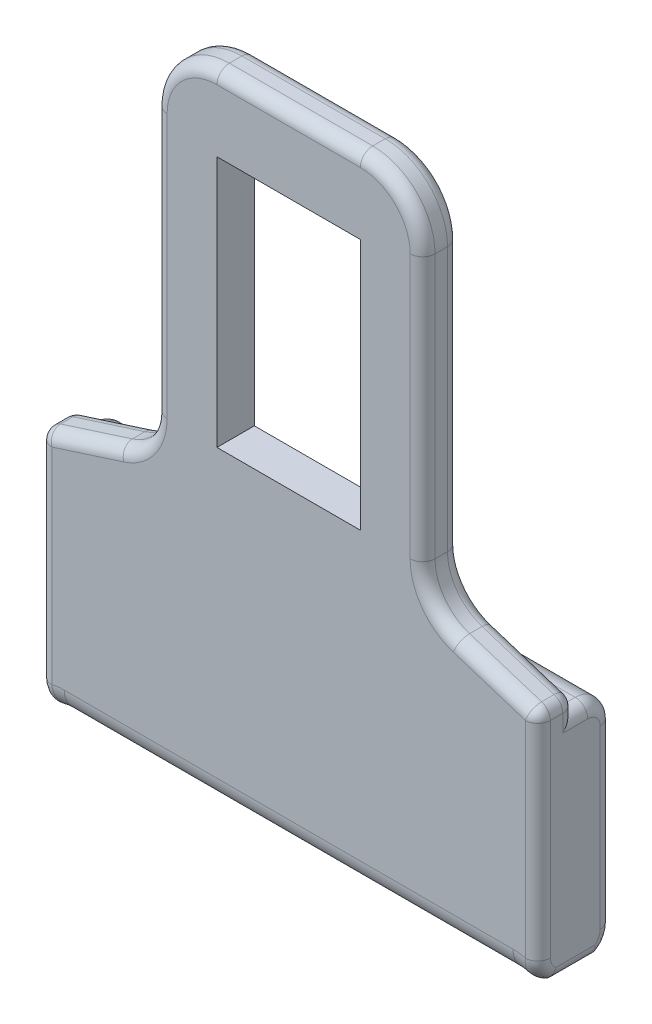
ISO-10303-21;
HEADER;
FILE_DESCRIPTION(('STEP AP214'),'2;1');
FILE_NAME('part.step','',(''),(''),'','','');
FILE_SCHEMA(('AUTOMOTIVE_DESIGN { 1 0 10303 214 1 1 1 1 }'));
ENDSEC;
DATA;
#1=APPLICATION_CONTEXT('core data for automotive mechanical design processes');
#2=APPLICATION_PROTOCOL_DEFINITION('international standard','automotive_design',2000,#1);
#3=PRODUCT_CONTEXT('',#1,'mechanical');
#4=PRODUCT('Part','Part','',(#3));
#5=PRODUCT_RELATED_PRODUCT_CATEGORY('part','',(#4));
#6=PRODUCT_DEFINITION_FORMATION('','',#4);
#7=PRODUCT_DEFINITION_CONTEXT('part definition',#1,'design');
#8=PRODUCT_DEFINITION('design','',#6,#7);
#9=PRODUCT_DEFINITION_SHAPE('','',#8);
#10=(LENGTH_UNIT() NAMED_UNIT(*) SI_UNIT(.MILLI.,.METRE.));
#11=(NAMED_UNIT(*) PLANE_ANGLE_UNIT() SI_UNIT($,.RADIAN.));
#12=(NAMED_UNIT(*) SI_UNIT($,.STERADIAN.) SOLID_ANGLE_UNIT());
#13=UNCERTAINTY_MEASURE_WITH_UNIT(LENGTH_MEASURE(1.E-05),#10,'distance_accuracy_value','');
#14=(GEOMETRIC_REPRESENTATION_CONTEXT(3) GLOBAL_UNCERTAINTY_ASSIGNED_CONTEXT((#13)) GLOBAL_UNIT_ASSIGNED_CONTEXT((#10,
#11,#12)) REPRESENTATION_CONTEXT('',''));
#15=CARTESIAN_POINT('',(0.,0.,0.));
#16=DIRECTION('',(0.,0.,1.));
#17=DIRECTION('',(1.,0.,0.));
#18=AXIS2_PLACEMENT_3D('',#15,#16,#17);
#19=CARTESIAN_POINT('',(30.,-78.1903245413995,-3.));
#20=DIRECTION('',(0.,0.,1.));
#21=DIRECTION('',(1.,0.,0.));
#22=AXIS2_PLACEMENT_3D('',#19,#20,#21);
#23=PLANE('',#22);
#24=DIRECTION('',(-1.,0.,0.));
#25=VECTOR('',#24,1.);
#26=CARTESIAN_POINT('',(30.,-35.1903245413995,-3.));
#27=LINE('',#26,#25);
#28=CARTESIAN_POINT('',(-19.,-35.1903245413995,-3.));
#29=VERTEX_POINT('',#28);
#30=CARTESIAN_POINT('',(19.,-35.1903245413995,-3.));
#31=VERTEX_POINT('',#30);
#32=EDGE_CURVE('E707',#29,#31,#27,.F.);
#33=ORIENTED_EDGE('',*,*,#32,.T.);
#34=DIRECTION('',(0.,1.,0.));
#35=VECTOR('',#34,1.);
#36=CARTESIAN_POINT('',(19.,-78.1903245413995,-3.));
#37=LINE('',#36,#35);
#38=CARTESIAN_POINT('',(19.,-49.3173411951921,-3.));
#39=VERTEX_POINT('',#38);
#40=EDGE_CURVE('E511',#31,#39,#37,.F.);
#41=ORIENTED_EDGE('',*,*,#40,.T.);
#42=CARTESIAN_POINT('',(18.,-53.1903245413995,-3.));
#43=DIRECTION('',(0.,0.,1.));
#44=DIRECTION('',(1.,0.,0.));
#45=AXIS2_PLACEMENT_3D('',#42,#43,#44);
#46=CIRCLE('',#45,4.);
#47=CARTESIAN_POINT('',(18.,-49.1903245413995,-3.));
#48=VERTEX_POINT('',#47);
#49=EDGE_CURVE('E965',#48,#39,#46,.F.);
#50=ORIENTED_EDGE('',*,*,#49,.F.);
#51=DIRECTION('',(1.,0.,0.));
#52=VECTOR('',#51,1.);
#53=CARTESIAN_POINT('',(30.,-49.1903245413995,-3.));
#54=LINE('',#53,#52);
#55=CARTESIAN_POINT('',(-18.,-49.1903245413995,-3.));
#56=VERTEX_POINT('',#55);
#57=EDGE_CURVE('E974',#48,#56,#54,.F.);
#58=ORIENTED_EDGE('',*,*,#57,.T.);
#59=CARTESIAN_POINT('',(-18.,-53.1903245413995,-3.));
#60=DIRECTION('',(0.,0.,1.));
#61=DIRECTION('',(1.,0.,0.));
#62=AXIS2_PLACEMENT_3D('',#59,#60,#61);
#63=CIRCLE('',#62,4.);
#64=CARTESIAN_POINT('',(-19.,-49.3173411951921,-3.));
#65=VERTEX_POINT('',#64);
#66=EDGE_CURVE('E1147',#65,#56,#63,.F.);
#67=ORIENTED_EDGE('',*,*,#66,.F.);
#68=DIRECTION('',(0.,-1.,0.));
#69=VECTOR('',#68,1.);
#70=CARTESIAN_POINT('',(-19.,-78.1903245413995,-3.));
#71=LINE('',#70,#69);
#72=EDGE_CURVE('E956',#65,#29,#71,.F.);
#73=ORIENTED_EDGE('',*,*,#72,.T.);
#74=EDGE_LOOP('',(#33,#41,#50,#58,#67,#73));
#75=FACE_BOUND('',#74,.T.);
#76=ADVANCED_FACE('F46',(#75),#23,.F.);
#77=CARTESIAN_POINT('',(14.75,-26.1903245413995,3.));
#78=DIRECTION('',(0.,0.,-1.));
#79=DIRECTION('',(-1.,0.,0.));
#80=AXIS2_PLACEMENT_3D('',#77,#78,#79);
#81=PLANE('',#80);
#82=CARTESIAN_POINT('',(18.,-53.1903245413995,3.));
#83=DIRECTION('',(0.,0.,-1.));
#84=DIRECTION('',(-1.,0.,0.));
#85=AXIS2_PLACEMENT_3D('',#82,#83,#84);
#86=CIRCLE('',#85,4.);
#87=CARTESIAN_POINT('',(19.,-49.3173411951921,3.));
#88=VERTEX_POINT('',#87);
#89=CARTESIAN_POINT('',(18.,-49.1903245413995,3.));
#90=VERTEX_POINT('',#89);
#91=EDGE_CURVE('E368',#88,#90,#86,.F.);
#92=ORIENTED_EDGE('',*,*,#91,.F.);
#93=DIRECTION('',(0.,1.,0.));
#94=VECTOR('',#93,1.);
#95=CARTESIAN_POINT('',(19.,-26.1903245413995,3.));
#96=LINE('',#95,#94);
#97=CARTESIAN_POINT('',(19.,-32.8001967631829,3.));
#98=VERTEX_POINT('',#97);
#99=EDGE_CURVE('E820',#88,#98,#96,.T.);
#100=ORIENTED_EDGE('',*,*,#99,.T.);
#101=DIRECTION('',(-0.952418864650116,0.304792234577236,0.));
#102=VECTOR('',#101,1.);
#103=CARTESIAN_POINT('',(13.2260388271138,-30.9524188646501,3.));
#104=LINE('',#103,#102);
#105=CARTESIAN_POINT('',(13.2260388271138,-30.9524188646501,3.));
#106=VERTEX_POINT('',#105);
#107=EDGE_CURVE('E814',#98,#106,#104,.T.);
#108=ORIENTED_EDGE('',*,*,#107,.T.);
#109=CARTESIAN_POINT('',(14.75,-26.1903245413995,3.));
#110=DIRECTION('',(0.,0.,-1.));
#111=DIRECTION('',(-1.,0.,0.));
#112=AXIS2_PLACEMENT_3D('',#109,#110,#111);
#113=CIRCLE('',#112,5.);
#114=CARTESIAN_POINT('',(9.74999999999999,-26.1903245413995,3.));
#115=VERTEX_POINT('',#114);
#116=EDGE_CURVE('E727',#106,#115,#113,.T.);
#117=ORIENTED_EDGE('',*,*,#116,.T.);
#118=DIRECTION('',(0.,1.,0.));
#119=VECTOR('',#118,1.);
#120=CARTESIAN_POINT('',(9.74999999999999,-26.1903245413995,3.));
#121=LINE('',#120,#119);
#122=CARTESIAN_POINT('',(9.75,-5.00000000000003,3.));
#123=VERTEX_POINT('',#122);
#124=EDGE_CURVE('E809',#115,#123,#121,.T.);
#125=ORIENTED_EDGE('',*,*,#124,.T.);
#126=CARTESIAN_POINT('',(5.75,-5.,3.));
#127=DIRECTION('',(0.,0.,-1.));
#128=DIRECTION('',(-1.,0.,0.));
#129=AXIS2_PLACEMENT_3D('',#126,#127,#128);
#130=CIRCLE('',#129,4.);
#131=CARTESIAN_POINT('',(5.74999999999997,-1.,3.));
#132=VERTEX_POINT('',#131);
#133=EDGE_CURVE('E802',#123,#132,#130,.F.);
#134=ORIENTED_EDGE('',*,*,#133,.T.);
#135=DIRECTION('',(-1.,0.,0.));
#136=VECTOR('',#135,1.);
#137=CARTESIAN_POINT('',(14.75,-1.,3.));
#138=LINE('',#137,#136);
#139=CARTESIAN_POINT('',(-5.74999999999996,-1.,3.));
#140=VERTEX_POINT('',#139);
#141=EDGE_CURVE('E786',#132,#140,#138,.T.);
#142=ORIENTED_EDGE('',*,*,#141,.T.);
#143=CARTESIAN_POINT('',(-5.75,-5.,3.));
#144=DIRECTION('',(0.,0.,-1.));
#145=DIRECTION('',(-1.,0.,0.));
#146=AXIS2_PLACEMENT_3D('',#143,#144,#145);
#147=CIRCLE('',#146,4.);
#148=CARTESIAN_POINT('',(-9.75,-5.00000000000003,3.));
#149=VERTEX_POINT('',#148);
#150=EDGE_CURVE('E793',#140,#149,#147,.F.);
#151=ORIENTED_EDGE('',*,*,#150,.T.);
#152=DIRECTION('',(0.,-1.,0.));
#153=VECTOR('',#152,1.);
#154=CARTESIAN_POINT('',(-9.74999999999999,-26.1903245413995,3.));
#155=LINE('',#154,#153);
#156=CARTESIAN_POINT('',(-9.74999999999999,-26.1903245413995,3.));
#157=VERTEX_POINT('',#156);
#158=EDGE_CURVE('E354',#149,#157,#155,.T.);
#159=ORIENTED_EDGE('',*,*,#158,.T.);
#160=CARTESIAN_POINT('',(-14.75,-26.1903245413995,3.));
#161=DIRECTION('',(0.,0.,-1.));
#162=DIRECTION('',(-1.,0.,0.));
#163=AXIS2_PLACEMENT_3D('',#160,#161,#162);
#164=CIRCLE('',#163,5.);
#165=CARTESIAN_POINT('',(-13.2260388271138,-30.9524188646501,3.));
#166=VERTEX_POINT('',#165);
#167=EDGE_CURVE('E804',#157,#166,#164,.T.);
#168=ORIENTED_EDGE('',*,*,#167,.T.);
#169=DIRECTION('',(-0.952418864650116,-0.304792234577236,0.));
#170=VECTOR('',#169,1.);
#171=CARTESIAN_POINT('',(13.5334611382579,-22.3888675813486,3.));
#172=LINE('',#171,#170);
#173=CARTESIAN_POINT('',(-19.,-32.8001967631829,3.));
#174=VERTEX_POINT('',#173);
#175=EDGE_CURVE('E798',#166,#174,#172,.T.);
#176=ORIENTED_EDGE('',*,*,#175,.T.);
#177=DIRECTION('',(0.,-1.,0.));
#178=VECTOR('',#177,1.);
#179=CARTESIAN_POINT('',(-19.,-26.1903245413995,3.));
#180=LINE('',#179,#178);
#181=CARTESIAN_POINT('',(-19.,-49.3173411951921,3.));
#182=VERTEX_POINT('',#181);
#183=EDGE_CURVE('E817',#174,#182,#180,.T.);
#184=ORIENTED_EDGE('',*,*,#183,.T.);
#185=CARTESIAN_POINT('',(-18.,-53.1903245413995,3.));
#186=DIRECTION('',(0.,0.,-1.));
#187=DIRECTION('',(-1.,0.,0.));
#188=AXIS2_PLACEMENT_3D('',#185,#186,#187);
#189=CIRCLE('',#188,4.);
#190=CARTESIAN_POINT('',(-18.,-49.1903245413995,3.));
#191=VERTEX_POINT('',#190);
#192=EDGE_CURVE('E1143',#191,#182,#189,.F.);
#193=ORIENTED_EDGE('',*,*,#192,.F.);
#194=DIRECTION('',(1.,0.,0.));
#195=VECTOR('',#194,1.);
#196=CARTESIAN_POINT('',(14.75,-49.1903245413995,3.));
#197=LINE('',#196,#195);
#198=EDGE_CURVE('E1140',#191,#90,#197,.T.);
#199=ORIENTED_EDGE('',*,*,#198,.T.);
#200=EDGE_LOOP('',(#92,#100,#108,#117,#125,#134,#142,#151,#159,#168,#176,#184,#193,#199));
#201=FACE_BOUND('',#200,.T.);
#202=DIRECTION('',(1.,0.,0.));
#203=VECTOR('',#202,1.);
#204=CARTESIAN_POINT('',(5.75,-26.2,3.));
#205=LINE('',#204,#203);
#206=CARTESIAN_POINT('',(-5.75,-26.2,3.));
#207=VERTEX_POINT('',#206);
#208=CARTESIAN_POINT('',(5.75,-26.2,3.));
#209=VERTEX_POINT('',#208);
#210=EDGE_CURVE('E1709',#207,#209,#205,.T.);
#211=ORIENTED_EDGE('',*,*,#210,.F.);
#212=DIRECTION('',(0.,-1.,0.));
#213=VECTOR('',#212,1.);
#214=CARTESIAN_POINT('',(-5.75,-6.,3.));
#215=LINE('',#214,#213);
#216=CARTESIAN_POINT('',(-5.75,-6.,3.));
#217=VERTEX_POINT('',#216);
#218=EDGE_CURVE('E1720',#217,#207,#215,.T.);
#219=ORIENTED_EDGE('',*,*,#218,.F.);
#220=DIRECTION('',(-1.,0.,0.));
#221=VECTOR('',#220,1.);
#222=CARTESIAN_POINT('',(5.75,-6.,3.));
#223=LINE('',#222,#221);
#224=CARTESIAN_POINT('',(5.75,-6.,3.));
#225=VERTEX_POINT('',#224);
#226=EDGE_CURVE('E1716',#225,#217,#223,.T.);
#227=ORIENTED_EDGE('',*,*,#226,.F.);
#228=DIRECTION('',(0.,1.,0.));
#229=VECTOR('',#228,1.);
#230=CARTESIAN_POINT('',(5.75,-6.,3.));
#231=LINE('',#230,#229);
#232=EDGE_CURVE('E1712',#209,#225,#231,.T.);
#233=ORIENTED_EDGE('',*,*,#232,.F.);
#234=EDGE_LOOP('',(#211,#219,#227,#233));
#235=FACE_BOUND('',#234,.T.);
#236=ADVANCED_FACE('F627',(#201,#235),#81,.F.);
#237=CARTESIAN_POINT('',(14.75,-26.1903245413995,0.));
#238=DIRECTION('',(0.,0.,-1.));
#239=DIRECTION('',(-1.,0.,0.));
#240=AXIS2_PLACEMENT_3D('',#237,#238,#239);
#241=PLANE('',#240);
#242=DIRECTION('',(-0.952418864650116,0.304792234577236,0.));
#243=VECTOR('',#242,1.);
#244=CARTESIAN_POINT('',(19.6952077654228,-33.022676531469,0.));
#245=LINE('',#244,#243);
#246=CARTESIAN_POINT('',(13.2260388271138,-30.9524188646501,0.));
#247=VERTEX_POINT('',#246);
#248=CARTESIAN_POINT('',(19.,-32.8001967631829,0.));
#249=VERTEX_POINT('',#248);
#250=EDGE_CURVE('E893',#247,#249,#245,.F.);
#251=ORIENTED_EDGE('',*,*,#250,.T.);
#252=DIRECTION('',(0.,1.,0.));
#253=VECTOR('',#252,1.);
#254=CARTESIAN_POINT('',(19.,-33.1903245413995,0.));
#255=LINE('',#254,#253);
#256=CARTESIAN_POINT('',(19.,-33.1903245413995,0.));
#257=VERTEX_POINT('',#256);
#258=EDGE_CURVE('E899',#249,#257,#255,.F.);
#259=ORIENTED_EDGE('',*,*,#258,.T.);
#260=DIRECTION('',(1.,0.,0.));
#261=VECTOR('',#260,1.);
#262=CARTESIAN_POINT('',(14.75,-33.1903245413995,0.));
#263=LINE('',#262,#261);
#264=CARTESIAN_POINT('',(-19.,-33.1903245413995,0.));
#265=VERTEX_POINT('',#264);
#266=EDGE_CURVE('E387',#265,#257,#263,.T.);
#267=ORIENTED_EDGE('',*,*,#266,.F.);
#268=DIRECTION('',(0.,-1.,0.));
#269=VECTOR('',#268,1.);
#270=CARTESIAN_POINT('',(-19.,-32.0702576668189,0.));
#271=LINE('',#270,#269);
#272=CARTESIAN_POINT('',(-19.,-32.8001967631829,0.));
#273=VERTEX_POINT('',#272);
#274=EDGE_CURVE('E896',#265,#273,#271,.F.);
#275=ORIENTED_EDGE('',*,*,#274,.T.);
#276=DIRECTION('',(-0.952418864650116,-0.304792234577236,0.));
#277=VECTOR('',#276,1.);
#278=CARTESIAN_POINT('',(-13.2260388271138,-30.9524188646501,0.));
#279=LINE('',#278,#277);
#280=CARTESIAN_POINT('',(-13.2260388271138,-30.9524188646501,0.));
#281=VERTEX_POINT('',#280);
#282=EDGE_CURVE('E878',#273,#281,#279,.F.);
#283=ORIENTED_EDGE('',*,*,#282,.T.);
#284=CARTESIAN_POINT('',(-14.75,-26.1903245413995,0.));
#285=DIRECTION('',(0.,0.,-1.));
#286=DIRECTION('',(-1.,0.,0.));
#287=AXIS2_PLACEMENT_3D('',#284,#285,#286);
#288=CIRCLE('',#287,5.);
#289=CARTESIAN_POINT('',(-9.74999999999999,-26.1903245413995,0.));
#290=VERTEX_POINT('',#289);
#291=EDGE_CURVE('E875',#281,#290,#288,.F.);
#292=ORIENTED_EDGE('',*,*,#291,.T.);
#293=DIRECTION('',(0.,-1.,0.));
#294=VECTOR('',#293,1.);
#295=CARTESIAN_POINT('',(-9.75,-5.00000000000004,0.));
#296=LINE('',#295,#294);
#297=CARTESIAN_POINT('',(-9.75,-5.00000000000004,0.));
#298=VERTEX_POINT('',#297);
#299=EDGE_CURVE('E872',#290,#298,#296,.F.);
#300=ORIENTED_EDGE('',*,*,#299,.T.);
#301=CARTESIAN_POINT('',(-5.75,-5.,0.));
#302=DIRECTION('',(0.,0.,-1.));
#303=DIRECTION('',(-1.,0.,0.));
#304=AXIS2_PLACEMENT_3D('',#301,#302,#303);
#305=CIRCLE('',#304,4.);
#306=CARTESIAN_POINT('',(-5.74999999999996,-1.,0.));
#307=VERTEX_POINT('',#306);
#308=EDGE_CURVE('E869',#298,#307,#305,.T.);
#309=ORIENTED_EDGE('',*,*,#308,.T.);
#310=DIRECTION('',(-1.,0.,0.));
#311=VECTOR('',#310,1.);
#312=CARTESIAN_POINT('',(5.74999999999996,-1.,0.));
#313=LINE('',#312,#311);
#314=CARTESIAN_POINT('',(5.74999999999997,-1.,0.));
#315=VERTEX_POINT('',#314);
#316=EDGE_CURVE('E881',#307,#315,#313,.F.);
#317=ORIENTED_EDGE('',*,*,#316,.T.);
#318=CARTESIAN_POINT('',(5.75,-5.,0.));
#319=DIRECTION('',(0.,0.,-1.));
#320=DIRECTION('',(-1.,0.,0.));
#321=AXIS2_PLACEMENT_3D('',#318,#319,#320);
#322=CIRCLE('',#321,4.);
#323=CARTESIAN_POINT('',(9.75,-5.00000000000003,0.));
#324=VERTEX_POINT('',#323);
#325=EDGE_CURVE('E884',#315,#324,#322,.T.);
#326=ORIENTED_EDGE('',*,*,#325,.T.);
#327=DIRECTION('',(0.,1.,0.));
#328=VECTOR('',#327,1.);
#329=CARTESIAN_POINT('',(9.74999999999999,-26.1903245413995,0.));
#330=LINE('',#329,#328);
#331=CARTESIAN_POINT('',(9.74999999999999,-26.1903245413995,0.));
#332=VERTEX_POINT('',#331);
#333=EDGE_CURVE('E887',#324,#332,#330,.F.);
#334=ORIENTED_EDGE('',*,*,#333,.T.);
#335=CARTESIAN_POINT('',(14.75,-26.1903245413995,0.));
#336=DIRECTION('',(0.,0.,-1.));
#337=DIRECTION('',(-1.,0.,0.));
#338=AXIS2_PLACEMENT_3D('',#335,#336,#337);
#339=CIRCLE('',#338,5.);
#340=EDGE_CURVE('E890',#332,#247,#339,.F.);
#341=ORIENTED_EDGE('',*,*,#340,.T.);
#342=EDGE_LOOP('',(#251,#259,#267,#275,#283,#292,#300,#309,#317,#326,#334,#341));
#343=FACE_BOUND('',#342,.T.);
#344=DIRECTION('',(0.,-1.,0.));
#345=VECTOR('',#344,1.);
#346=CARTESIAN_POINT('',(-5.75,-6.,0.));
#347=LINE('',#346,#345);
#348=CARTESIAN_POINT('',(-5.75,-6.,0.));
#349=VERTEX_POINT('',#348);
#350=CARTESIAN_POINT('',(-5.75,-26.2,0.));
#351=VERTEX_POINT('',#350);
#352=EDGE_CURVE('E1713',#349,#351,#347,.T.);
#353=ORIENTED_EDGE('',*,*,#352,.T.);
#354=DIRECTION('',(1.,0.,0.));
#355=VECTOR('',#354,1.);
#356=CARTESIAN_POINT('',(5.75,-26.2,0.));
#357=LINE('',#356,#355);
#358=CARTESIAN_POINT('',(5.75,-26.2,0.));
#359=VERTEX_POINT('',#358);
#360=EDGE_CURVE('E1698',#351,#359,#357,.T.);
#361=ORIENTED_EDGE('',*,*,#360,.T.);
#362=DIRECTION('',(0.,1.,0.));
#363=VECTOR('',#362,1.);
#364=CARTESIAN_POINT('',(5.75,-6.,0.));
#365=LINE('',#364,#363);
#366=CARTESIAN_POINT('',(5.75,-6.,0.));
#367=VERTEX_POINT('',#366);
#368=EDGE_CURVE('E1702',#359,#367,#365,.T.);
#369=ORIENTED_EDGE('',*,*,#368,.T.);
#370=DIRECTION('',(-1.,0.,0.));
#371=VECTOR('',#370,1.);
#372=CARTESIAN_POINT('',(5.75,-6.,0.));
#373=LINE('',#372,#371);
#374=EDGE_CURVE('E1727',#367,#349,#373,.T.);
#375=ORIENTED_EDGE('',*,*,#374,.T.);
#376=EDGE_LOOP('',(#353,#361,#369,#375));
#377=FACE_BOUND('',#376,.T.);
#378=ADVANCED_FACE('F633',(#343,#377),#241,.T.);
#379=CARTESIAN_POINT('',(13.5308310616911,-30.,3.));
#380=DIRECTION('',(-0.304792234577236,-0.952418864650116,0.));
#381=DIRECTION('',(0.952418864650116,-0.304792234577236,0.));
#382=AXIS2_PLACEMENT_3D('',#379,#380,#381);
#383=PLANE('',#382);
#384=DIRECTION('',(0.,0.,-1.));
#385=VECTOR('',#384,1.);
#386=CARTESIAN_POINT('',(13.5308310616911,-30.,3.));
#387=LINE('',#386,#385);
#388=CARTESIAN_POINT('',(13.5308310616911,-30.,2.));
#389=VERTEX_POINT('',#388);
#390=CARTESIAN_POINT('',(13.5308310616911,-30.,1.));
#391=VERTEX_POINT('',#390);
#392=EDGE_CURVE('E700',#389,#391,#387,.T.);
#393=ORIENTED_EDGE('',*,*,#392,.F.);
#394=DIRECTION('',(-0.952418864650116,0.304792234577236,0.));
#395=VECTOR('',#394,1.);
#396=CARTESIAN_POINT('',(13.5308310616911,-30.,2.));
#397=LINE('',#396,#395);
#398=CARTESIAN_POINT('',(19.3047922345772,-31.8477778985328,2.));
#399=VERTEX_POINT('',#398);
#400=EDGE_CURVE('E702',#389,#399,#397,.F.);
#401=ORIENTED_EDGE('',*,*,#400,.T.);
#402=DIRECTION('',(0.,0.,-1.));
#403=VECTOR('',#402,1.);
#404=CARTESIAN_POINT('',(19.3047922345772,-31.8477778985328,3.));
#405=LINE('',#404,#403);
#406=CARTESIAN_POINT('',(19.3047922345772,-31.8477778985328,1.));
#407=VERTEX_POINT('',#406);
#408=EDGE_CURVE('E823',#399,#407,#405,.T.);
#409=ORIENTED_EDGE('',*,*,#408,.T.);
#410=DIRECTION('',(-0.952418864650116,0.304792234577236,0.));
#411=VECTOR('',#410,1.);
#412=CARTESIAN_POINT('',(13.5308310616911,-30.,1.));
#413=LINE('',#412,#411);
#414=EDGE_CURVE('E704',#407,#391,#413,.T.);
#415=ORIENTED_EDGE('',*,*,#414,.T.);
#416=EDGE_LOOP('',(#393,#401,#409,#415));
#417=FACE_BOUND('',#416,.T.);
#418=ADVANCED_FACE('F661',(#417),#383,.F.);
#419=CARTESIAN_POINT('',(14.75,-26.1903245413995,3.));
#420=DIRECTION('',(0.,0.,-1.));
#421=DIRECTION('',(-1.,0.,0.));
#422=AXIS2_PLACEMENT_3D('',#419,#420,#421);
#423=CYLINDRICAL_SURFACE('',#422,4.);
#424=DIRECTION('',(0.,0.,-1.));
#425=VECTOR('',#424,1.);
#426=CARTESIAN_POINT('',(10.75,-26.1903245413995,3.));
#427=LINE('',#426,#425);
#428=CARTESIAN_POINT('',(10.75,-26.1903245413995,2.));
#429=VERTEX_POINT('',#428);
#430=CARTESIAN_POINT('',(10.75,-26.1903245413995,1.));
#431=VERTEX_POINT('',#430);
#432=EDGE_CURVE('E708',#429,#431,#427,.T.);
#433=ORIENTED_EDGE('',*,*,#432,.F.);
#434=CARTESIAN_POINT('',(14.75,-26.1903245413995,2.));
#435=DIRECTION('',(0.,0.,-1.));
#436=DIRECTION('',(-1.,0.,0.));
#437=AXIS2_PLACEMENT_3D('',#434,#435,#436);
#438=CIRCLE('',#437,4.);
#439=EDGE_CURVE('E726',#429,#389,#438,.F.);
#440=ORIENTED_EDGE('',*,*,#439,.T.);
#441=ORIENTED_EDGE('',*,*,#392,.T.);
#442=CARTESIAN_POINT('',(14.75,-26.1903245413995,1.));
#443=DIRECTION('',(0.,0.,-1.));
#444=DIRECTION('',(-1.,0.,0.));
#445=AXIS2_PLACEMENT_3D('',#442,#443,#444);
#446=CIRCLE('',#445,4.);
#447=EDGE_CURVE('E720',#391,#431,#446,.T.);
#448=ORIENTED_EDGE('',*,*,#447,.T.);
#449=EDGE_LOOP('',(#433,#440,#441,#448));
#450=FACE_BOUND('',#449,.T.);
#451=ADVANCED_FACE('F689',(#450),#423,.F.);
#452=CARTESIAN_POINT('',(10.75,-5.00000000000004,3.));
#453=DIRECTION('',(-1.,0.,0.));
#454=DIRECTION('',(0.,-1.,0.));
#455=AXIS2_PLACEMENT_3D('',#452,#453,#454);
#456=PLANE('',#455);
#457=DIRECTION('',(0.,0.,-1.));
#458=VECTOR('',#457,1.);
#459=CARTESIAN_POINT('',(10.75,-5.00000000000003,3.));
#460=LINE('',#459,#458);
#461=CARTESIAN_POINT('',(10.75,-5.00000000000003,2.));
#462=VERTEX_POINT('',#461);
#463=CARTESIAN_POINT('',(10.75,-5.00000000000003,1.));
#464=VERTEX_POINT('',#463);
#465=EDGE_CURVE('E1125',#462,#464,#460,.T.);
#466=ORIENTED_EDGE('',*,*,#465,.F.);
#467=DIRECTION('',(0.,1.,0.));
#468=VECTOR('',#467,1.);
#469=CARTESIAN_POINT('',(10.75,-5.00000000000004,2.));
#470=LINE('',#469,#468);
#471=EDGE_CURVE('E835',#462,#429,#470,.F.);
#472=ORIENTED_EDGE('',*,*,#471,.T.);
#473=ORIENTED_EDGE('',*,*,#432,.T.);
#474=DIRECTION('',(0.,1.,0.));
#475=VECTOR('',#474,1.);
#476=CARTESIAN_POINT('',(10.75,-5.00000000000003,1.));
#477=LINE('',#476,#475);
#478=EDGE_CURVE('E832',#431,#464,#477,.T.);
#479=ORIENTED_EDGE('',*,*,#478,.T.);
#480=EDGE_LOOP('',(#466,#472,#473,#479));
#481=FACE_BOUND('',#480,.T.);
#482=ADVANCED_FACE('F685',(#481),#456,.F.);
#483=CARTESIAN_POINT('',(5.75,-5.,3.));
#484=DIRECTION('',(0.,0.,-1.));
#485=DIRECTION('',(-1.,0.,0.));
#486=AXIS2_PLACEMENT_3D('',#483,#484,#485);
#487=CYLINDRICAL_SURFACE('',#486,5.);
#488=DIRECTION('',(0.,0.,-1.));
#489=VECTOR('',#488,1.);
#490=CARTESIAN_POINT('',(5.74999999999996,0.,3.));
#491=LINE('',#490,#489);
#492=CARTESIAN_POINT('',(5.74999999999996,0.,2.));
#493=VERTEX_POINT('',#492);
#494=CARTESIAN_POINT('',(5.74999999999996,0.,1.));
#495=VERTEX_POINT('',#494);
#496=EDGE_CURVE('E1121',#493,#495,#491,.T.);
#497=ORIENTED_EDGE('',*,*,#496,.F.);
#498=CARTESIAN_POINT('',(5.75,-5.,2.));
#499=DIRECTION('',(0.,0.,-1.));
#500=DIRECTION('',(-1.,0.,0.));
#501=AXIS2_PLACEMENT_3D('',#498,#499,#500);
#502=CIRCLE('',#501,5.);
#503=EDGE_CURVE('E841',#493,#462,#502,.T.);
#504=ORIENTED_EDGE('',*,*,#503,.T.);
#505=ORIENTED_EDGE('',*,*,#465,.T.);
#506=CARTESIAN_POINT('',(5.75,-5.,1.));
#507=DIRECTION('',(0.,0.,-1.));
#508=DIRECTION('',(-1.,0.,0.));
#509=AXIS2_PLACEMENT_3D('',#506,#507,#508);
#510=CIRCLE('',#509,5.);
#511=EDGE_CURVE('E838',#464,#495,#510,.F.);
#512=ORIENTED_EDGE('',*,*,#511,.T.);
#513=EDGE_LOOP('',(#497,#504,#505,#512));
#514=FACE_BOUND('',#513,.T.);
#515=ADVANCED_FACE('F681',(#514),#487,.T.);
#516=CARTESIAN_POINT('',(5.74999999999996,0.,3.));
#517=DIRECTION('',(0.,-1.,0.));
#518=DIRECTION('',(0.,0.,-1.));
#519=AXIS2_PLACEMENT_3D('',#516,#517,#518);
#520=PLANE('',#519);
#521=DIRECTION('',(0.,0.,-1.));
#522=VECTOR('',#521,1.);
#523=CARTESIAN_POINT('',(-5.74999999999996,0.,3.));
#524=LINE('',#523,#522);
#525=CARTESIAN_POINT('',(-5.74999999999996,0.,2.));
#526=VERTEX_POINT('',#525);
#527=CARTESIAN_POINT('',(-5.74999999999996,0.,1.));
#528=VERTEX_POINT('',#527);
#529=EDGE_CURVE('E1117',#526,#528,#524,.T.);
#530=ORIENTED_EDGE('',*,*,#529,.F.);
#531=DIRECTION('',(-1.,0.,0.));
#532=VECTOR('',#531,1.);
#533=CARTESIAN_POINT('',(5.74999999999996,0.,2.));
#534=LINE('',#533,#532);
#535=EDGE_CURVE('E787',#526,#493,#534,.F.);
#536=ORIENTED_EDGE('',*,*,#535,.T.);
#537=ORIENTED_EDGE('',*,*,#496,.T.);
#538=DIRECTION('',(-1.,0.,0.));
#539=VECTOR('',#538,1.);
#540=CARTESIAN_POINT('',(-5.74999999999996,0.,1.));
#541=LINE('',#540,#539);
#542=EDGE_CURVE('E844',#495,#528,#541,.T.);
#543=ORIENTED_EDGE('',*,*,#542,.T.);
#544=EDGE_LOOP('',(#530,#536,#537,#543));
#545=FACE_BOUND('',#544,.T.);
#546=ADVANCED_FACE('F677',(#545),#520,.F.);
#547=CARTESIAN_POINT('',(-5.75,-5.,3.));
#548=DIRECTION('',(0.,0.,-1.));
#549=DIRECTION('',(-1.,0.,0.));
#550=AXIS2_PLACEMENT_3D('',#547,#548,#549);
#551=CYLINDRICAL_SURFACE('',#550,5.);
#552=DIRECTION('',(0.,0.,-1.));
#553=VECTOR('',#552,1.);
#554=CARTESIAN_POINT('',(-10.75,-5.00000000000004,3.));
#555=LINE('',#554,#553);
#556=CARTESIAN_POINT('',(-10.75,-5.00000000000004,2.));
#557=VERTEX_POINT('',#556);
#558=CARTESIAN_POINT('',(-10.75,-5.00000000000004,1.));
#559=VERTEX_POINT('',#558);
#560=EDGE_CURVE('E1107',#557,#559,#555,.T.);
#561=ORIENTED_EDGE('',*,*,#560,.F.);
#562=CARTESIAN_POINT('',(-5.75,-5.,2.));
#563=DIRECTION('',(0.,0.,-1.));
#564=DIRECTION('',(-1.,0.,0.));
#565=AXIS2_PLACEMENT_3D('',#562,#563,#564);
#566=CIRCLE('',#565,5.);
#567=EDGE_CURVE('E792',#557,#526,#566,.T.);
#568=ORIENTED_EDGE('',*,*,#567,.T.);
#569=ORIENTED_EDGE('',*,*,#529,.T.);
#570=CARTESIAN_POINT('',(-5.75,-5.,1.));
#571=DIRECTION('',(0.,0.,-1.));
#572=DIRECTION('',(-1.,0.,0.));
#573=AXIS2_PLACEMENT_3D('',#570,#571,#572);
#574=CIRCLE('',#573,5.);
#575=EDGE_CURVE('E849',#528,#559,#574,.F.);
#576=ORIENTED_EDGE('',*,*,#575,.T.);
#577=EDGE_LOOP('',(#561,#568,#569,#576));
#578=FACE_BOUND('',#577,.T.);
#579=ADVANCED_FACE('F673',(#578),#551,.T.);
#580=CARTESIAN_POINT('',(-10.75,-5.00000000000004,3.));
#581=DIRECTION('',(1.,0.,0.));
#582=DIRECTION('',(0.,1.,0.));
#583=AXIS2_PLACEMENT_3D('',#580,#581,#582);
#584=PLANE('',#583);
#585=ORIENTED_EDGE('',*,*,#560,.T.);
#586=DIRECTION('',(0.,-1.,0.));
#587=VECTOR('',#586,1.);
#588=CARTESIAN_POINT('',(-10.75,-26.1903245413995,1.));
#589=LINE('',#588,#587);
#590=CARTESIAN_POINT('',(-10.75,-26.1903245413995,1.));
#591=VERTEX_POINT('',#590);
#592=EDGE_CURVE('E905',#559,#591,#589,.T.);
#593=ORIENTED_EDGE('',*,*,#592,.T.);
#594=DIRECTION('',(0.,0.,-1.));
#595=VECTOR('',#594,1.);
#596=CARTESIAN_POINT('',(-10.75,-26.1903245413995,3.));
#597=LINE('',#596,#595);
#598=CARTESIAN_POINT('',(-10.75,-26.1903245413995,2.));
#599=VERTEX_POINT('',#598);
#600=EDGE_CURVE('E1101',#599,#591,#597,.T.);
#601=ORIENTED_EDGE('',*,*,#600,.F.);
#602=DIRECTION('',(0.,-1.,0.));
#603=VECTOR('',#602,1.);
#604=CARTESIAN_POINT('',(-10.75,-5.00000000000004,2.));
#605=LINE('',#604,#603);
#606=EDGE_CURVE('E902',#599,#557,#605,.F.);
#607=ORIENTED_EDGE('',*,*,#606,.T.);
#608=EDGE_LOOP('',(#585,#593,#601,#607));
#609=FACE_BOUND('',#608,.T.);
#610=ADVANCED_FACE('F669',(#609),#584,.F.);
#611=CARTESIAN_POINT('',(-14.75,-26.1903245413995,3.));
#612=DIRECTION('',(0.,0.,-1.));
#613=DIRECTION('',(-1.,0.,0.));
#614=AXIS2_PLACEMENT_3D('',#611,#612,#613);
#615=CYLINDRICAL_SURFACE('',#614,4.);
#616=DIRECTION('',(0.,0.,-1.));
#617=VECTOR('',#616,1.);
#618=CARTESIAN_POINT('',(-13.5308310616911,-30.,3.));
#619=LINE('',#618,#617);
#620=CARTESIAN_POINT('',(-13.5308310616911,-30.,2.));
#621=VERTEX_POINT('',#620);
#622=CARTESIAN_POINT('',(-13.5308310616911,-30.,1.));
#623=VERTEX_POINT('',#622);
#624=EDGE_CURVE('E1098',#621,#623,#619,.T.);
#625=ORIENTED_EDGE('',*,*,#624,.F.);
#626=CARTESIAN_POINT('',(-14.75,-26.1903245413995,2.));
#627=DIRECTION('',(0.,0.,-1.));
#628=DIRECTION('',(-1.,0.,0.));
#629=AXIS2_PLACEMENT_3D('',#626,#627,#628);
#630=CIRCLE('',#629,4.);
#631=EDGE_CURVE('E866',#621,#599,#630,.F.);
#632=ORIENTED_EDGE('',*,*,#631,.T.);
#633=ORIENTED_EDGE('',*,*,#600,.T.);
#634=CARTESIAN_POINT('',(-14.75,-26.1903245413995,1.));
#635=DIRECTION('',(0.,0.,-1.));
#636=DIRECTION('',(-1.,0.,0.));
#637=AXIS2_PLACEMENT_3D('',#634,#635,#636);
#638=CIRCLE('',#637,4.);
#639=EDGE_CURVE('E863',#591,#623,#638,.T.);
#640=ORIENTED_EDGE('',*,*,#639,.T.);
#641=EDGE_LOOP('',(#625,#632,#633,#640));
#642=FACE_BOUND('',#641,.T.);
#643=ADVANCED_FACE('F665',(#642),#615,.F.);
#644=CARTESIAN_POINT('',(-13.5308310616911,-30.,3.));
#645=DIRECTION('',(0.304792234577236,-0.952418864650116,0.));
#646=DIRECTION('',(0.952418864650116,0.304792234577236,0.));
#647=AXIS2_PLACEMENT_3D('',#644,#645,#646);
#648=PLANE('',#647);
#649=DIRECTION('',(0.,0.,1.));
#650=VECTOR('',#649,1.);
#651=CARTESIAN_POINT('',(-19.3047922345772,-31.8477778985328,3.));
#652=LINE('',#651,#650);
#653=CARTESIAN_POINT('',(-19.3047922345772,-31.8477778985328,1.));
#654=VERTEX_POINT('',#653);
#655=CARTESIAN_POINT('',(-19.3047922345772,-31.8477778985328,2.));
#656=VERTEX_POINT('',#655);
#657=EDGE_CURVE('E854',#654,#656,#652,.T.);
#658=ORIENTED_EDGE('',*,*,#657,.T.);
#659=DIRECTION('',(-0.952418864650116,-0.304792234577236,0.));
#660=VECTOR('',#659,1.);
#661=CARTESIAN_POINT('',(-13.5308310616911,-30.,2.));
#662=LINE('',#661,#660);
#663=EDGE_CURVE('E860',#656,#621,#662,.F.);
#664=ORIENTED_EDGE('',*,*,#663,.T.);
#665=ORIENTED_EDGE('',*,*,#624,.T.);
#666=DIRECTION('',(-0.952418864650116,-0.304792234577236,0.));
#667=VECTOR('',#666,1.);
#668=CARTESIAN_POINT('',(-20.,-32.0702576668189,1.));
#669=LINE('',#668,#667);
#670=EDGE_CURVE('E857',#623,#654,#669,.T.);
#671=ORIENTED_EDGE('',*,*,#670,.T.);
#672=EDGE_LOOP('',(#658,#664,#665,#671));
#673=FACE_BOUND('',#672,.T.);
#674=ADVANCED_FACE('F656',(#673),#648,.F.);
#675=CARTESIAN_POINT('',(5.75,-26.2,3.));
#676=DIRECTION('',(0.,1.,0.));
#677=DIRECTION('',(0.,0.,1.));
#678=AXIS2_PLACEMENT_3D('',#675,#676,#677);
#679=PLANE('',#678);
#680=ORIENTED_EDGE('',*,*,#360,.F.);
#681=DIRECTION('',(0.,0.,-1.));
#682=VECTOR('',#681,1.);
#683=CARTESIAN_POINT('',(-5.75,-26.2,3.));
#684=LINE('',#683,#682);
#685=EDGE_CURVE('E1722',#207,#351,#684,.T.);
#686=ORIENTED_EDGE('',*,*,#685,.F.);
#687=ORIENTED_EDGE('',*,*,#210,.T.);
#688=DIRECTION('',(0.,0.,-1.));
#689=VECTOR('',#688,1.);
#690=CARTESIAN_POINT('',(5.75,-26.2,3.));
#691=LINE('',#690,#689);
#692=EDGE_CURVE('E1102',#209,#359,#691,.T.);
#693=ORIENTED_EDGE('',*,*,#692,.T.);
#694=EDGE_LOOP('',(#680,#686,#687,#693));
#695=FACE_BOUND('',#694,.T.);
#696=ADVANCED_FACE('F653',(#695),#679,.T.);
#697=CARTESIAN_POINT('',(5.75,-6.,3.));
#698=DIRECTION('',(-1.,0.,0.));
#699=DIRECTION('',(0.,0.,1.));
#700=AXIS2_PLACEMENT_3D('',#697,#698,#699);
#701=PLANE('',#700);
#702=ORIENTED_EDGE('',*,*,#368,.F.);
#703=ORIENTED_EDGE('',*,*,#692,.F.);
#704=ORIENTED_EDGE('',*,*,#232,.T.);
#705=DIRECTION('',(0.,0.,-1.));
#706=VECTOR('',#705,1.);
#707=CARTESIAN_POINT('',(5.75,-6.,3.));
#708=LINE('',#707,#706);
#709=EDGE_CURVE('E1110',#225,#367,#708,.T.);
#710=ORIENTED_EDGE('',*,*,#709,.T.);
#711=EDGE_LOOP('',(#702,#703,#704,#710));
#712=FACE_BOUND('',#711,.T.);
#713=ADVANCED_FACE('F649',(#712),#701,.T.);
#714=CARTESIAN_POINT('',(5.75,-6.,3.));
#715=DIRECTION('',(0.,-1.,0.));
#716=DIRECTION('',(0.,0.,-1.));
#717=AXIS2_PLACEMENT_3D('',#714,#715,#716);
#718=PLANE('',#717);
#719=ORIENTED_EDGE('',*,*,#374,.F.);
#720=ORIENTED_EDGE('',*,*,#709,.F.);
#721=ORIENTED_EDGE('',*,*,#226,.T.);
#722=DIRECTION('',(0.,0.,-1.));
#723=VECTOR('',#722,1.);
#724=CARTESIAN_POINT('',(-5.75,-6.,3.));
#725=LINE('',#724,#723);
#726=EDGE_CURVE('E1737',#217,#349,#725,.T.);
#727=ORIENTED_EDGE('',*,*,#726,.T.);
#728=EDGE_LOOP('',(#719,#720,#721,#727));
#729=FACE_BOUND('',#728,.T.);
#730=ADVANCED_FACE('F645',(#729),#718,.T.);
#731=CARTESIAN_POINT('',(-5.75,-6.,3.));
#732=DIRECTION('',(1.,0.,0.));
#733=DIRECTION('',(0.,0.,-1.));
#734=AXIS2_PLACEMENT_3D('',#731,#732,#733);
#735=PLANE('',#734);
#736=ORIENTED_EDGE('',*,*,#352,.F.);
#737=ORIENTED_EDGE('',*,*,#726,.F.);
#738=ORIENTED_EDGE('',*,*,#218,.T.);
#739=ORIENTED_EDGE('',*,*,#685,.T.);
#740=EDGE_LOOP('',(#736,#737,#738,#739));
#741=FACE_BOUND('',#740,.T.);
#742=ADVANCED_FACE('F641',(#741),#735,.T.);
#743=CARTESIAN_POINT('',(-30.,-33.1903245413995,-3.));
#744=DIRECTION('',(0.,1.,0.));
#745=DIRECTION('',(-1.,0.,0.));
#746=AXIS2_PLACEMENT_3D('',#743,#744,#745);
#747=PLANE('',#746);
#748=ORIENTED_EDGE('',*,*,#266,.T.);
#749=DIRECTION('',(0.,0.,1.));
#750=VECTOR('',#749,1.);
#751=CARTESIAN_POINT('',(19.,-33.1903245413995,-1.));
#752=LINE('',#751,#750);
#753=CARTESIAN_POINT('',(19.,-33.1903245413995,-1.));
#754=VERTEX_POINT('',#753);
#755=EDGE_CURVE('E948',#257,#754,#752,.F.);
#756=ORIENTED_EDGE('',*,*,#755,.T.);
#757=DIRECTION('',(-1.,0.,0.));
#758=VECTOR('',#757,1.);
#759=CARTESIAN_POINT('',(-30.,-33.1903245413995,-1.));
#760=LINE('',#759,#758);
#761=CARTESIAN_POINT('',(-19.,-33.1903245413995,-1.));
#762=VERTEX_POINT('',#761);
#763=EDGE_CURVE('E1134',#754,#762,#760,.T.);
#764=ORIENTED_EDGE('',*,*,#763,.T.);
#765=DIRECTION('',(0.,0.,-1.));
#766=VECTOR('',#765,1.);
#767=CARTESIAN_POINT('',(-19.,-33.1903245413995,0.));
#768=LINE('',#767,#766);
#769=EDGE_CURVE('E945',#762,#265,#768,.F.);
#770=ORIENTED_EDGE('',*,*,#769,.T.);
#771=EDGE_LOOP('',(#748,#756,#764,#770));
#772=FACE_BOUND('',#771,.T.);
#773=ADVANCED_FACE('F638',(#772),#747,.T.);
#774=CARTESIAN_POINT('',(-30.,-35.1903245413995,-1.));
#775=DIRECTION('',(1.,0.,0.));
#776=DIRECTION('',(0.,1.,0.));
#777=AXIS2_PLACEMENT_3D('',#774,#775,#776);
#778=CYLINDRICAL_SURFACE('',#777,2.);
#779=ORIENTED_EDGE('',*,*,#763,.F.);
#780=CARTESIAN_POINT('',(19.,-35.1903245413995,-1.));
#781=DIRECTION('',(-1.,0.,0.));
#782=DIRECTION('',(0.,0.,1.));
#783=AXIS2_PLACEMENT_3D('',#780,#781,#782);
#784=CIRCLE('',#783,2.);
#785=EDGE_CURVE('E954',#754,#31,#784,.T.);
#786=ORIENTED_EDGE('',*,*,#785,.T.);
#787=ORIENTED_EDGE('',*,*,#32,.F.);
#788=CARTESIAN_POINT('',(-19.,-35.1903245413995,-1.));
#789=DIRECTION('',(1.,0.,0.));
#790=DIRECTION('',(0.,1.,0.));
#791=AXIS2_PLACEMENT_3D('',#788,#789,#790);
#792=CIRCLE('',#791,2.);
#793=EDGE_CURVE('E951',#29,#762,#792,.T.);
#794=ORIENTED_EDGE('',*,*,#793,.T.);
#795=EDGE_LOOP('',(#779,#786,#787,#794));
#796=FACE_BOUND('',#795,.T.);
#797=ADVANCED_FACE('F404',(#796),#778,.T.);
#798=CARTESIAN_POINT('',(20.,-51.1903245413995,3.));
#799=DIRECTION('',(0.,1.,0.));
#800=DIRECTION('',(0.,0.,1.));
#801=AXIS2_PLACEMENT_3D('',#798,#799,#800);
#802=PLANE('',#801);
#803=CARTESIAN_POINT('',(18.,-51.1903245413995,-1.));
#804=CARTESIAN_POINT('',(18.0021081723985,-51.1903245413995,-1.00210817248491));
#805=CARTESIAN_POINT('',(18.0042163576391,-51.1903245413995,-1.0042163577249));
#806=CARTESIAN_POINT('',(18.2423925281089,-51.1903245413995,-1.24239073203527));
#807=CARTESIAN_POINT('',(18.4787156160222,-51.1903245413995,-1.47851270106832));
#808=CARTESIAN_POINT('',(18.849349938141,-51.1903245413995,-1.81525139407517));
#809=CARTESIAN_POINT('',(18.975565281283,-51.1903245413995,-1.92457448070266));
#810=CARTESIAN_POINT('',(19.2353613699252,-51.1903245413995,-2.133962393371));
#811=CARTESIAN_POINT('',(19.3689366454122,-51.1903245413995,-2.2340339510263));
#812=CARTESIAN_POINT('',(19.6719136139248,-51.1903245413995,-2.43942814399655));
#813=CARTESIAN_POINT('',(19.8432427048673,-51.1903245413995,-2.54201225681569));
#814=CARTESIAN_POINT('',(20.109746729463,-51.1903245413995,-2.67630973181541));
#815=CARTESIAN_POINT('',(20.2000470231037,-51.1903245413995,-2.71777256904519));
#816=CARTESIAN_POINT('',(20.3836758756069,-51.1903245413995,-2.79328338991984));
#817=CARTESIAN_POINT('',(20.4770026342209,-51.1903245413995,-2.82733569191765));
#818=CARTESIAN_POINT('',(20.6480077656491,-51.1903245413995,-2.88128133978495));
#819=CARTESIAN_POINT('',(20.7252250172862,-51.1903245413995,-2.90263919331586));
#820=CARTESIAN_POINT('',(20.881048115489,-51.1903245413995,-2.93938565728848));
#821=CARTESIAN_POINT('',(20.9596534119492,-51.1903245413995,-2.95477657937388));
#822=CARTESIAN_POINT('',(21.1186265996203,-51.1903245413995,-2.97922300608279));
#823=CARTESIAN_POINT('',(21.1990041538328,-51.1903245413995,-2.98821662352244));
#824=CARTESIAN_POINT('',(21.3603343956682,-51.1903245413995,-2.99918401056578));
#825=CARTESIAN_POINT('',(21.4412876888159,-51.1903245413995,-3.00114876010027));
#826=CARTESIAN_POINT('',(21.5221989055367,-51.1903245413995,-2.99936440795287));
#827=B_SPLINE_CURVE_WITH_KNOTS('',3,(#803,#804,#805,#806,#807,#808,#809,#810,#811,#812,#813,
#814,#815,#816,#817,#818,#819,#820,#821,#822,#823,#824,#825,#826),.UNSPECIFIED.,.F.,.F.,(4,2,2,
2,2,2,2,2,2,2,2,4),(0.,0.00894427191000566,1.0104860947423,1.51110011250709,2.01134695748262,
2.60850657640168,2.90633862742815,3.20399665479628,3.4441347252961,3.68417967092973,
3.92651633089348,4.16916386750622),.UNSPECIFIED.);
#828=CARTESIAN_POINT('',(18.,-51.1903245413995,-1.));
#829=VERTEX_POINT('',#828);
#830=CARTESIAN_POINT('',(18.6920286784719,-51.1903245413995,-1.67218505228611));
#831=VERTEX_POINT('',#830);
#832=EDGE_CURVE('E377',#829,#831,#827,.T.);
#833=ORIENTED_EDGE('',*,*,#832,.T.);
#834=CARTESIAN_POINT('',(20.,-49.1092267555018,-1.97942096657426));
#835=CARTESIAN_POINT('',(20.,-48.9221821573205,-2.91395317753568));
#836=CARTESIAN_POINT('',(19.0480333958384,-48.9131977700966,-2.95884193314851));
#837=CARTESIAN_POINT('',(20.,-49.1434464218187,-1.98627127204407));
#838=CARTESIAN_POINT('',(20.,-48.9861802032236,-2.93412586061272));
#839=CARTESIAN_POINT('',(19.0405044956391,-48.97979227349,-2.97254254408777));
#840=CARTESIAN_POINT('',(20.,-49.1779887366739,-1.99141428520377));
#841=CARTESIAN_POINT('',(20.,-49.0511162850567,-2.95138028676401));
#842=CARTESIAN_POINT('',(19.0327288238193,-49.0469483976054,-2.98282857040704));
#843=CARTESIAN_POINT('',(20.,-49.2474621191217,-1.99828184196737));
#844=CARTESIAN_POINT('',(20.,-49.1829577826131,-2.98012968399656));
#845=CARTESIAN_POINT('',(19.0167068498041,-49.1818671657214,-2.9965636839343));
#846=CARTESIAN_POINT('',(20.,-49.2823936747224,-2.00000145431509));
#847=CARTESIAN_POINT('',(20.,-49.2499159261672,-2.99157832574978));
#848=CARTESIAN_POINT('',(19.0084598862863,-49.2496305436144,-3.00000290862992));
#849=CARTESIAN_POINT('',(20.,-49.3775620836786,-1.99999749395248));
#850=CARTESIAN_POINT('',(20.,-49.4348752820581,-3.01468045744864));
#851=CARTESIAN_POINT('',(18.9854220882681,-49.4340188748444,-2.99999498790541));
#852=CARTESIAN_POINT('',(20.,-49.4378303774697,-1.99488453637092));
#853=CARTESIAN_POINT('',(20.,-49.553997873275,-3.0201812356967));
#854=CARTESIAN_POINT('',(18.9702119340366,-49.5505399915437,-2.98976907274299));
#855=CARTESIAN_POINT('',(20.,-49.5566857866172,-1.97462819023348));
#856=CARTESIAN_POINT('',(20.,-49.7942698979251,-3.01258371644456));
#857=CARTESIAN_POINT('',(18.9388645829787,-49.7797626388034,-2.94925638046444));
#858=CARTESIAN_POINT('',(20.,-49.61527128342,-1.95947546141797));
#859=CARTESIAN_POINT('',(20.,-49.9156179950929,-2.99915174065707));
#860=CARTESIAN_POINT('',(18.9227265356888,-49.8924605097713,-2.91895092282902));
#861=CARTESIAN_POINT('',(20.,-49.7290685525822,-1.91957073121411));
#862=CARTESIAN_POINT('',(20.,-50.1578509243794,-2.95265070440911));
#863=CARTESIAN_POINT('',(18.8899957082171,-50.1107514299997,-2.83914146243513));
#864=CARTESIAN_POINT('',(20.,-49.7842811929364,-1.89482121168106));
#865=CARTESIAN_POINT('',(20.,-50.2788517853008,-2.91920183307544));
#866=CARTESIAN_POINT('',(18.8734030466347,-50.2163463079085,-2.78964242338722));
#867=CARTESIAN_POINT('',(20.,-49.8897336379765,-1.83636025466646));
#868=CARTESIAN_POINT('',(20.,-50.5174766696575,-2.83142491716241));
#869=CARTESIAN_POINT('',(18.8403913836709,-50.4174065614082,-2.67272050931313));
#870=CARTESIAN_POINT('',(20.,-49.9399741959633,-1.8026501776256));
#871=CARTESIAN_POINT('',(20.,-50.6350799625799,-2.77667346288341));
#872=CARTESIAN_POINT('',(18.8239723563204,-50.5128734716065,-2.60530035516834));
#873=CARTESIAN_POINT('',(20.,-50.0336755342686,-1.72731910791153));
#874=CARTESIAN_POINT('',(20.,-50.8623993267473,-2.64532577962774));
#875=CARTESIAN_POINT('',(18.7922029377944,-50.6903585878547,-2.45463821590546));
#876=CARTESIAN_POINT('',(20.,-50.0771729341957,-1.68574377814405));
#877=CARTESIAN_POINT('',(20.,-50.9719545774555,-2.56844748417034));
#878=CARTESIAN_POINT('',(18.7768470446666,-50.7724495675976,-2.3714875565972));
#879=CARTESIAN_POINT('',(20.,-50.1562249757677,-1.59565669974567));
#880=CARTESIAN_POINT('',(20.,-51.1785737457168,-2.39190868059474));
#881=CARTESIAN_POINT('',(18.7480653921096,-50.921189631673,-2.19131339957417));
#882=CARTESIAN_POINT('',(20.,-50.1917844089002,-1.54714916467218));
#883=CARTESIAN_POINT('',(20.,-51.2752003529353,-2.29199956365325));
#884=CARTESIAN_POINT('',(18.734638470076,-50.9878480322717,-2.09429832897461));
#885=CARTESIAN_POINT('',(20.,-50.2524214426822,-1.44649290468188));
#886=CARTESIAN_POINT('',(20.,-51.445696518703,-2.07436192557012));
#887=CARTESIAN_POINT('',(18.7112023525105,-51.1012252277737,-1.89298580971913));
#888=CARTESIAN_POINT('',(20.,-50.2778532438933,-1.39455948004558));
#889=CARTESIAN_POINT('',(20.,-51.5197708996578,-1.95744707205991));
#890=CARTESIAN_POINT('',(18.7010804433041,-51.1486193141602,-1.78911896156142));
#891=CARTESIAN_POINT('',(20.,-50.308810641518,-1.31387260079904));
#892=CARTESIAN_POINT('',(20.,-51.6120399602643,-1.76972672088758));
#893=CARTESIAN_POINT('',(18.6885810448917,-51.2062119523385,-1.62774520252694));
#894=CARTESIAN_POINT('',(20.,-50.3179417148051,-1.28645850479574));
#895=CARTESIAN_POINT('',(20.,-51.6397103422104,-1.70475826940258));
#896=CARTESIAN_POINT('',(18.6848573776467,-51.2231788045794,-1.57291700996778));
#897=CARTESIAN_POINT('',(20.,-50.3336983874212,-1.2309087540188));
#898=CARTESIAN_POINT('',(20.,-51.6879642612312,-1.57131302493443));
#899=CARTESIAN_POINT('',(18.67839243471,-51.2524350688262,-1.46181750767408));
#900=CARTESIAN_POINT('',(20.,-50.3403230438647,-1.20277283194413));
#901=CARTESIAN_POINT('',(20.,-51.7084770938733,-1.50291292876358));
#902=CARTESIAN_POINT('',(18.6756515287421,-51.2647227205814,-1.4055456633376));
#903=CARTESIAN_POINT('',(20.,-50.3456522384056,-1.17437658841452));
#904=CARTESIAN_POINT('',(20.,-51.7250629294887,-1.43331016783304));
#905=CARTESIAN_POINT('',(18.6734413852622,-51.2746044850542,-1.34875317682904));
#906=(BOUNDED_SURFACE() B_SPLINE_SURFACE(3,2,((#834,#835,#836),(#837,#838,#839),(#840,#841,
#842),(#843,#844,#845),(#846,#847,#848),(#849,#850,#851),(#852,#853,#854),(#855,#856,#857),
(#858,#859,#860),(#861,#862,#863),(#864,#865,#866),(#867,#868,#869),(#870,#871,#872),(#873,#874,
#875),(#876,#877,#878),(#879,#880,#881),(#882,#883,#884),(#885,#886,#887),(#888,#889,#890),
(#891,#892,#893),(#894,#895,#896),(#897,#898,#899),(#900,#901,#902),(#903,#904,#905)),
.UNSPECIFIED.,.F.,.F.,.F.) B_SPLINE_SURFACE_WITH_KNOTS((4,2,2,2,2,2,2,2,2,2,2,4),(3,3),(0.,
0.104617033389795,0.209384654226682,0.389918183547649,0.57061990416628,0.751274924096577,
0.931902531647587,1.11151198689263,1.29101273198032,1.46352470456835,1.55010585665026,
1.63671954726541),(0.,1.),
.UNSPECIFIED.) GEOMETRIC_REPRESENTATION_ITEM() RATIONAL_B_SPLINE_SURFACE(((1.,0.723889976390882,
1.),(1.,0.721289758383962,1.),(1.,0.718590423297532,1.),(1.,0.712994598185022,1.),(1.,
0.710097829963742,1.),(1.,0.701952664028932,1.),(1.,0.696518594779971,1.),(1.,0.685174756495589,
1.),(1.,0.67926454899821,1.),(1.,0.667109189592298,1.),(1.,0.660864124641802,1.),(1.,
0.648255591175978,1.),(1.,0.641892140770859,1.),(1.,0.629396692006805,1.),(1.,0.623263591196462,
1.),(1.,0.611609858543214,1.),(1.,0.606088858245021,1.),(1.,0.596342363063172,1.),(1.,
0.592074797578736,1.),(1.,0.586765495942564,1.),(1.,0.58517578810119,1.),(1.,0.582407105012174,
1.),(1.,0.581228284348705,1.),(1.,0.580276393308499,1.))) REPRESENTATION_ITEM('') SURFACE());
#907=CARTESIAN_POINT('',(18.6920286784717,-51.1903245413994,-1.6721850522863));
#908=CARTESIAN_POINT('',(18.7110457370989,-51.1903245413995,-1.68963546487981));
#909=CARTESIAN_POINT('',(18.7313249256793,-51.1903245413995,-1.70581264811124));
#910=CARTESIAN_POINT('',(18.7742504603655,-51.1903245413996,-1.73502408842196));
#911=CARTESIAN_POINT('',(18.7969137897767,-51.1903245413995,-1.74803325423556));
#912=CARTESIAN_POINT('',(18.8442742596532,-51.1903245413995,-1.77008057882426));
#913=CARTESIAN_POINT('',(18.8689815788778,-51.1903245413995,-1.7790972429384));
#914=CARTESIAN_POINT('',(18.9195322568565,-51.1903245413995,-1.79240939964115));
#915=CARTESIAN_POINT('',(18.9453690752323,-51.1903245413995,-1.79672908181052));
#916=CARTESIAN_POINT('',(18.9808882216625,-51.1903245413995,-1.79923404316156));
#917=CARTESIAN_POINT('',(18.9904464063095,-51.1903245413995,-1.79957144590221));
#918=CARTESIAN_POINT('',(19.,-51.1903245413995,-1.79956520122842));
#919=B_SPLINE_CURVE_WITH_KNOTS('',3,(#907,#908,#909,#910,#911,#912,#913,#914,#915,#916,#917,
#918),.UNSPECIFIED.,.F.,.F.,(4,2,2,2,2,4),(0.,0.0774774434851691,0.155549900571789,
0.234037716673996,0.312119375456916,0.340787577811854),.UNSPECIFIED.);
#920=CARTESIAN_POINT('',(19.,-51.1903245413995,-1.7995652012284));
#921=VERTEX_POINT('',#920);
#922=EDGE_CURVE('E538',#831,#921,#919,.T.);
#923=ORIENTED_EDGE('',*,*,#922,.T.);
#924=DIRECTION('',(0.,0.,-1.));
#925=VECTOR('',#924,1.);
#926=CARTESIAN_POINT('',(19.,-51.1903245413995,3.));
#927=LINE('',#926,#925);
#928=CARTESIAN_POINT('',(19.,-51.1903245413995,1.7995652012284));
#929=VERTEX_POINT('',#928);
#930=EDGE_CURVE('E988',#921,#929,#927,.F.);
#931=ORIENTED_EDGE('',*,*,#930,.T.);
#932=CARTESIAN_POINT('',(19.0480333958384,-48.9131977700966,2.95884193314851));
#933=CARTESIAN_POINT('',(20.,-48.9221821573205,2.91395317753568));
#934=CARTESIAN_POINT('',(20.,-49.1092267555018,1.97942096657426));
#935=CARTESIAN_POINT('',(19.0405044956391,-48.97979227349,2.97254254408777));
#936=CARTESIAN_POINT('',(20.,-48.9861802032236,2.93412586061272));
#937=CARTESIAN_POINT('',(20.,-49.1434464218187,1.98627127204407));
#938=CARTESIAN_POINT('',(19.0327288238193,-49.0469483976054,2.98282857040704));
#939=CARTESIAN_POINT('',(20.,-49.0511162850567,2.95138028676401));
#940=CARTESIAN_POINT('',(20.,-49.1779887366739,1.99141428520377));
#941=CARTESIAN_POINT('',(19.0167068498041,-49.1818671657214,2.9965636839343));
#942=CARTESIAN_POINT('',(20.,-49.1829577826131,2.98012968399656));
#943=CARTESIAN_POINT('',(20.,-49.2474621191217,1.99828184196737));
#944=CARTESIAN_POINT('',(19.0084598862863,-49.2496305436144,3.00000290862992));
#945=CARTESIAN_POINT('',(20.,-49.2499159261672,2.99157832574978));
#946=CARTESIAN_POINT('',(20.,-49.2823936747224,2.00000145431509));
#947=CARTESIAN_POINT('',(18.9854220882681,-49.4340188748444,2.99999498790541));
#948=CARTESIAN_POINT('',(20.,-49.4348752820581,3.01468045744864));
#949=CARTESIAN_POINT('',(20.,-49.3775620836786,1.99999749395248));
#950=CARTESIAN_POINT('',(18.9702119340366,-49.5505399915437,2.98976907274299));
#951=CARTESIAN_POINT('',(20.,-49.553997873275,3.0201812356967));
#952=CARTESIAN_POINT('',(20.,-49.4378303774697,1.99488453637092));
#953=CARTESIAN_POINT('',(18.9388645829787,-49.7797626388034,2.94925638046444));
#954=CARTESIAN_POINT('',(20.,-49.7942698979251,3.01258371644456));
#955=CARTESIAN_POINT('',(20.,-49.5566857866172,1.97462819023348));
#956=CARTESIAN_POINT('',(18.9227265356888,-49.8924605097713,2.91895092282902));
#957=CARTESIAN_POINT('',(20.,-49.9156179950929,2.99915174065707));
#958=CARTESIAN_POINT('',(20.,-49.61527128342,1.95947546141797));
#959=CARTESIAN_POINT('',(18.8899957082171,-50.1107514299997,2.83914146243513));
#960=CARTESIAN_POINT('',(20.,-50.1578509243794,2.95265070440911));
#961=CARTESIAN_POINT('',(20.,-49.7290685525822,1.91957073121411));
#962=CARTESIAN_POINT('',(18.8734030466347,-50.2163463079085,2.78964242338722));
#963=CARTESIAN_POINT('',(20.,-50.2788517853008,2.91920183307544));
#964=CARTESIAN_POINT('',(20.,-49.7842811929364,1.89482121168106));
#965=CARTESIAN_POINT('',(18.8403913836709,-50.4174065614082,2.67272050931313));
#966=CARTESIAN_POINT('',(20.,-50.5174766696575,2.83142491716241));
#967=CARTESIAN_POINT('',(20.,-49.8897336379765,1.83636025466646));
#968=CARTESIAN_POINT('',(18.8239723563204,-50.5128734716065,2.60530035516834));
#969=CARTESIAN_POINT('',(20.,-50.6350799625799,2.77667346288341));
#970=CARTESIAN_POINT('',(20.,-49.9399741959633,1.8026501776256));
#971=CARTESIAN_POINT('',(18.7922029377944,-50.6903585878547,2.45463821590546));
#972=CARTESIAN_POINT('',(20.,-50.8623993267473,2.64532577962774));
#973=CARTESIAN_POINT('',(20.,-50.0336755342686,1.72731910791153));
#974=CARTESIAN_POINT('',(18.7768470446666,-50.7724495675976,2.3714875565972));
#975=CARTESIAN_POINT('',(20.,-50.9719545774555,2.56844748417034));
#976=CARTESIAN_POINT('',(20.,-50.0771729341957,1.68574377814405));
#977=CARTESIAN_POINT('',(18.7480653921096,-50.921189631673,2.19131339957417));
#978=CARTESIAN_POINT('',(20.,-51.1785737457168,2.39190868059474));
#979=CARTESIAN_POINT('',(20.,-50.1562249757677,1.59565669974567));
#980=CARTESIAN_POINT('',(18.734638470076,-50.9878480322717,2.09429832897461));
#981=CARTESIAN_POINT('',(20.,-51.2752003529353,2.29199956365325));
#982=CARTESIAN_POINT('',(20.,-50.1917844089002,1.54714916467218));
#983=CARTESIAN_POINT('',(18.7112023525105,-51.1012252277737,1.89298580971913));
#984=CARTESIAN_POINT('',(20.,-51.445696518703,2.07436192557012));
#985=CARTESIAN_POINT('',(20.,-50.2524214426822,1.44649290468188));
#986=CARTESIAN_POINT('',(18.7010804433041,-51.1486193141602,1.78911896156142));
#987=CARTESIAN_POINT('',(20.,-51.5197708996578,1.95744707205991));
#988=CARTESIAN_POINT('',(20.,-50.2778532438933,1.39455948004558));
#989=CARTESIAN_POINT('',(18.6885810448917,-51.2062119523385,1.62774520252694));
#990=CARTESIAN_POINT('',(20.,-51.6120399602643,1.76972672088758));
#991=CARTESIAN_POINT('',(20.,-50.308810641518,1.31387260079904));
#992=CARTESIAN_POINT('',(18.6848573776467,-51.2231788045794,1.57291700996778));
#993=CARTESIAN_POINT('',(20.,-51.6397103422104,1.70475826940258));
#994=CARTESIAN_POINT('',(20.,-50.3179417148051,1.28645850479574));
#995=CARTESIAN_POINT('',(18.67839243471,-51.2524350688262,1.46181750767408));
#996=CARTESIAN_POINT('',(20.,-51.6879642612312,1.57131302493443));
#997=CARTESIAN_POINT('',(20.,-50.3336983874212,1.2309087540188));
#998=CARTESIAN_POINT('',(18.6756515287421,-51.2647227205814,1.4055456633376));
#999=CARTESIAN_POINT('',(20.,-51.7084770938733,1.50291292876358));
#1000=CARTESIAN_POINT('',(20.,-50.3403230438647,1.20277283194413));
#1001=CARTESIAN_POINT('',(18.6734413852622,-51.2746044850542,1.34875317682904));
#1002=CARTESIAN_POINT('',(20.,-51.7250629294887,1.43331016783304));
#1003=CARTESIAN_POINT('',(20.,-50.3456522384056,1.17437658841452));
#1004=(BOUNDED_SURFACE() B_SPLINE_SURFACE(3,2,((#932,#933,#934),(#935,#936,#937),(#938,#939,
#940),(#941,#942,#943),(#944,#945,#946),(#947,#948,#949),(#950,#951,#952),(#953,#954,#955),
(#956,#957,#958),(#959,#960,#961),(#962,#963,#964),(#965,#966,#967),(#968,#969,#970),(#971,#972,
#973),(#974,#975,#976),(#977,#978,#979),(#980,#981,#982),(#983,#984,#985),(#986,#987,#988),
(#989,#990,#991),(#992,#993,#994),(#995,#996,#997),(#998,#999,#1000),(#1001,#1002,#1003)),
.UNSPECIFIED.,.F.,.F.,.F.) B_SPLINE_SURFACE_WITH_KNOTS((4,2,2,2,2,2,2,2,2,2,2,4),(3,3),(0.,
0.104617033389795,0.209384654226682,0.389918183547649,0.57061990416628,0.751274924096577,
0.931902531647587,1.11151198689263,1.29101273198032,1.46352470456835,1.55010585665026,
1.63671954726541),(0.,1.),
.UNSPECIFIED.) GEOMETRIC_REPRESENTATION_ITEM() RATIONAL_B_SPLINE_SURFACE(((1.,0.723889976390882,
1.),(1.,0.721289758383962,1.),(1.,0.718590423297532,1.),(1.,0.712994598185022,1.),(1.,
0.710097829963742,1.),(1.,0.701952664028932,1.),(1.,0.696518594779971,1.),(1.,0.685174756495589,
1.),(1.,0.67926454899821,1.),(1.,0.667109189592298,1.),(1.,0.660864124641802,1.),(1.,
0.648255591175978,1.),(1.,0.641892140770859,1.),(1.,0.629396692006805,1.),(1.,0.623263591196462,
1.),(1.,0.611609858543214,1.),(1.,0.606088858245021,1.),(1.,0.596342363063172,1.),(1.,
0.592074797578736,1.),(1.,0.586765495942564,1.),(1.,0.58517578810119,1.),(1.,0.582407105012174,
1.),(1.,0.581228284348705,1.),(1.,0.580276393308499,1.))) REPRESENTATION_ITEM('') SURFACE());
#1005=CARTESIAN_POINT('',(19.,-51.1903245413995,1.7995652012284));
#1006=CARTESIAN_POINT('',(18.9741542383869,-51.1903245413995,1.79960990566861));
#1007=CARTESIAN_POINT('',(18.9483605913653,-51.1903245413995,1.79710671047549));
#1008=CARTESIAN_POINT('',(18.8978126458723,-51.1903245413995,1.78746734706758));
#1009=CARTESIAN_POINT('',(18.8730528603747,-51.1903245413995,1.78036022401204));
#1010=CARTESIAN_POINT('',(18.8252175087,-51.1903245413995,1.76198542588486));
#1011=CARTESIAN_POINT('',(18.8021384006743,-51.1903245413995,1.75072682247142));
#1012=CARTESIAN_POINT('',(18.758040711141,-51.1903245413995,1.72473841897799));
#1013=CARTESIAN_POINT('',(18.7370225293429,-51.1903245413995,1.71000794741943));
#1014=CARTESIAN_POINT('',(18.7085635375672,-51.1903245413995,1.68690227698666));
#1015=CARTESIAN_POINT('',(18.7001826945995,-51.1903245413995,1.67966055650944));
#1016=CARTESIAN_POINT('',(18.6920286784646,-51.1903245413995,1.67218505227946));
#1017=B_SPLINE_CURVE_WITH_KNOTS('',3,(#1005,#1006,#1007,#1008,#1009,#1010,#1011,#1012,#1013,
#1014,#1015,#1016),.UNSPECIFIED.,.F.,.F.,(4,2,2,2,2,4),(0.,0.0773372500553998,0.154191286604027,
0.230878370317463,0.30758029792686,0.340783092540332),.UNSPECIFIED.);
#1018=CARTESIAN_POINT('',(18.6920286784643,-51.1903245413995,1.67218505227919));
#1019=VERTEX_POINT('',#1018);
#1020=EDGE_CURVE('E349',#929,#1019,#1017,.T.);
#1021=ORIENTED_EDGE('',*,*,#1020,.T.);
#1022=CARTESIAN_POINT('',(18.,-51.1903245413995,1.));
#1023=CARTESIAN_POINT('',(18.0021081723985,-51.1903245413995,1.00210817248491));
#1024=CARTESIAN_POINT('',(18.0042163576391,-51.1903245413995,1.0042163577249));
#1025=CARTESIAN_POINT('',(18.2423925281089,-51.1903245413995,1.24239073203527));
#1026=CARTESIAN_POINT('',(18.4787156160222,-51.1903245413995,1.47851270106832));
#1027=CARTESIAN_POINT('',(18.849349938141,-51.1903245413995,1.81525139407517));
#1028=CARTESIAN_POINT('',(18.975565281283,-51.1903245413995,1.92457448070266));
#1029=CARTESIAN_POINT('',(19.2353613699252,-51.1903245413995,2.133962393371));
#1030=CARTESIAN_POINT('',(19.3689366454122,-51.1903245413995,2.2340339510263));
#1031=CARTESIAN_POINT('',(19.6719136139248,-51.1903245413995,2.43942814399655));
#1032=CARTESIAN_POINT('',(19.8432427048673,-51.1903245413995,2.54201225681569));
#1033=CARTESIAN_POINT('',(20.109746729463,-51.1903245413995,2.67630973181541));
#1034=CARTESIAN_POINT('',(20.2000470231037,-51.1903245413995,2.71777256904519));
#1035=CARTESIAN_POINT('',(20.3836758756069,-51.1903245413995,2.79328338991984));
#1036=CARTESIAN_POINT('',(20.4770026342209,-51.1903245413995,2.82733569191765));
#1037=CARTESIAN_POINT('',(20.6480077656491,-51.1903245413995,2.88128133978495));
#1038=CARTESIAN_POINT('',(20.7252250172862,-51.1903245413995,2.90263919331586));
#1039=CARTESIAN_POINT('',(20.881048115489,-51.1903245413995,2.93938565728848));
#1040=CARTESIAN_POINT('',(20.9596534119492,-51.1903245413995,2.95477657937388));
#1041=CARTESIAN_POINT('',(21.1186265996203,-51.1903245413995,2.97922300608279));
#1042=CARTESIAN_POINT('',(21.1990041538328,-51.1903245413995,2.98821662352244));
#1043=CARTESIAN_POINT('',(21.3603343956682,-51.1903245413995,2.99918401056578));
#1044=CARTESIAN_POINT('',(21.4412876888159,-51.1903245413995,3.00114876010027));
#1045=CARTESIAN_POINT('',(21.5221989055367,-51.1903245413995,2.99936440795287));
#1046=B_SPLINE_CURVE_WITH_KNOTS('',3,(#1022,#1023,#1024,#1025,#1026,#1027,#1028,#1029,#1030,
#1031,#1032,#1033,#1034,#1035,#1036,#1037,#1038,#1039,#1040,#1041,#1042,#1043,#1044,#1045),
.UNSPECIFIED.,.F.,.F.,(4,2,2,2,2,2,2,2,2,2,2,4),(0.,0.00894427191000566,1.0104860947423,
1.51110011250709,2.01134695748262,2.60850657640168,2.90633862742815,3.20399665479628,
3.4441347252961,3.68417967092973,3.92651633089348,4.16916386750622),.UNSPECIFIED.);
#1047=CARTESIAN_POINT('',(18.,-51.1903245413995,1.));
#1048=VERTEX_POINT('',#1047);
#1049=EDGE_CURVE('E341',#1019,#1048,#1046,.F.);
#1050=ORIENTED_EDGE('',*,*,#1049,.T.);
#1051=DIRECTION('',(1.,0.,0.));
#1052=VECTOR('',#1051,1.);
#1053=CARTESIAN_POINT('',(20.,-51.1903245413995,1.));
#1054=LINE('',#1053,#1052);
#1055=CARTESIAN_POINT('',(-18.,-51.1903245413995,1.));
#1056=VERTEX_POINT('',#1055);
#1057=EDGE_CURVE('E346',#1048,#1056,#1054,.F.);
#1058=ORIENTED_EDGE('',*,*,#1057,.T.);
#1059=CARTESIAN_POINT('',(-18.,-51.1903245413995,1.));
#1060=CARTESIAN_POINT('',(-18.0021081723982,-51.1903245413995,1.00210817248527));
#1061=CARTESIAN_POINT('',(-18.0042163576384,-51.1903245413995,1.00421635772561));
#1062=CARTESIAN_POINT('',(-18.2423925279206,-51.1903245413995,1.24239073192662));
#1063=CARTESIAN_POINT('',(-18.4787156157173,-51.1903245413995,1.4785127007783));
#1064=CARTESIAN_POINT('',(-18.8493499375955,-51.1903245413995,1.81525139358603));
#1065=CARTESIAN_POINT('',(-18.9755652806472,-51.1903245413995,1.92457448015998));
#1066=CARTESIAN_POINT('',(-19.2353613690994,-51.1903245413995,2.13396239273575));
#1067=CARTESIAN_POINT('',(-19.3689366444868,-51.1903245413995,2.234033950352));
#1068=CARTESIAN_POINT('',(-19.6719136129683,-51.1903245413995,2.43942814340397));
#1069=CARTESIAN_POINT('',(-19.8432427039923,-51.1903245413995,2.54201225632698));
#1070=CARTESIAN_POINT('',(-20.1097467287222,-51.1903245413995,2.67630973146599));
#1071=CARTESIAN_POINT('',(-20.2000470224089,-51.1903245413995,2.71777256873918));
#1072=CARTESIAN_POINT('',(-20.3836758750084,-51.1903245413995,2.79328338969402));
#1073=CARTESIAN_POINT('',(-20.4770026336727,-51.1903245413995,2.82733569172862));
#1074=CARTESIAN_POINT('',(-20.6480077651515,-51.1903245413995,2.88128133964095));
#1075=CARTESIAN_POINT('',(-20.7252250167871,-51.1903245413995,2.9026391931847));
#1076=CARTESIAN_POINT('',(-20.8810481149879,-51.1903245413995,2.93938565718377));
#1077=CARTESIAN_POINT('',(-20.9596534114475,-51.1903245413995,2.95477657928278));
#1078=CARTESIAN_POINT('',(-21.11862659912,-51.1903245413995,2.97922300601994));
#1079=CARTESIAN_POINT('',(-21.1990041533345,-51.1903245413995,2.98821662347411));
#1080=CARTESIAN_POINT('',(-21.3603343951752,-51.1903245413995,2.99918401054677));
#1081=CARTESIAN_POINT('',(-21.4412876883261,-51.1903245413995,3.00114876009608));
#1082=CARTESIAN_POINT('',(-21.5221989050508,-51.1903245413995,2.99936440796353));
#1083=B_SPLINE_CURVE_WITH_KNOTS('',3,(#1059,#1060,#1061,#1062,#1063,#1064,#1065,#1066,#1067,
#1068,#1069,#1070,#1071,#1072,#1073,#1074,#1075,#1076,#1077,#1078,#1079,#1080,#1081,#1082),
.UNSPECIFIED.,.F.,.F.,(4,2,2,2,2,2,2,2,2,2,2,4),(0.,0.00894427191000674,1.01048609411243,
1.51110011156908,2.01134695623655,2.60850657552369,2.9063386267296,3.2039966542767,
3.44413472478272,3.68417967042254,3.92651633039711,4.16916386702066),.UNSPECIFIED.);
#1084=CARTESIAN_POINT('',(-18.6920286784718,-51.1903245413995,1.67218505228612));
#1085=VERTEX_POINT('',#1084);
#1086=EDGE_CURVE('E1024',#1056,#1085,#1083,.T.);
#1087=ORIENTED_EDGE('',*,*,#1086,.T.);
#1088=CARTESIAN_POINT('',(-20.,-49.1092267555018,1.97942096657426));
#1089=CARTESIAN_POINT('',(-20.,-48.9221821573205,2.91395317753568));
#1090=CARTESIAN_POINT('',(-19.0480333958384,-48.9131977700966,2.95884193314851));
#1091=CARTESIAN_POINT('',(-20.,-49.1434464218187,1.98627127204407));
#1092=CARTESIAN_POINT('',(-20.,-48.9861802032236,2.93412586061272));
#1093=CARTESIAN_POINT('',(-19.0405044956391,-48.97979227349,2.97254254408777));
#1094=CARTESIAN_POINT('',(-20.,-49.1779887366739,1.99141428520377));
#1095=CARTESIAN_POINT('',(-20.,-49.0511162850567,2.95138028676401));
#1096=CARTESIAN_POINT('',(-19.0327288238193,-49.0469483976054,2.98282857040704));
#1097=CARTESIAN_POINT('',(-20.,-49.2474621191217,1.99828184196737));
#1098=CARTESIAN_POINT('',(-20.,-49.1829577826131,2.98012968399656));
#1099=CARTESIAN_POINT('',(-19.0167068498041,-49.1818671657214,2.9965636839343));
#1100=CARTESIAN_POINT('',(-20.,-49.2823936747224,2.00000145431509));
#1101=CARTESIAN_POINT('',(-20.,-49.2499159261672,2.99157832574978));
#1102=CARTESIAN_POINT('',(-19.0084598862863,-49.2496305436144,3.00000290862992));
#1103=CARTESIAN_POINT('',(-20.,-49.3775620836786,1.99999749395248));
#1104=CARTESIAN_POINT('',(-20.,-49.4348752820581,3.01468045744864));
#1105=CARTESIAN_POINT('',(-18.9854220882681,-49.4340188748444,2.99999498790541));
#1106=CARTESIAN_POINT('',(-20.,-49.4378303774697,1.99488453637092));
#1107=CARTESIAN_POINT('',(-20.,-49.553997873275,3.0201812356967));
#1108=CARTESIAN_POINT('',(-18.9702119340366,-49.5505399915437,2.98976907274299));
#1109=CARTESIAN_POINT('',(-20.,-49.5566857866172,1.97462819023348));
#1110=CARTESIAN_POINT('',(-20.,-49.7942698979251,3.01258371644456));
#1111=CARTESIAN_POINT('',(-18.9388645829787,-49.7797626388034,2.94925638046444));
#1112=CARTESIAN_POINT('',(-20.,-49.61527128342,1.95947546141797));
#1113=CARTESIAN_POINT('',(-20.,-49.9156179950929,2.99915174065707));
#1114=CARTESIAN_POINT('',(-18.9227265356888,-49.8924605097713,2.91895092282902));
#1115=CARTESIAN_POINT('',(-20.,-49.7290685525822,1.91957073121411));
#1116=CARTESIAN_POINT('',(-20.,-50.1578509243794,2.9526507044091));
#1117=CARTESIAN_POINT('',(-18.8899957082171,-50.1107514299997,2.83914146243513));
#1118=CARTESIAN_POINT('',(-20.,-49.7842811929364,1.89482121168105));
#1119=CARTESIAN_POINT('',(-20.,-50.2788517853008,2.91920183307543));
#1120=CARTESIAN_POINT('',(-18.8734030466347,-50.2163463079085,2.78964242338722));
#1121=CARTESIAN_POINT('',(-20.,-49.8897336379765,1.83636025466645));
#1122=CARTESIAN_POINT('',(-20.,-50.5174766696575,2.8314249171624));
#1123=CARTESIAN_POINT('',(-18.8403913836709,-50.4174065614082,2.67272050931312));
#1124=CARTESIAN_POINT('',(-20.,-49.9399741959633,1.8026501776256));
#1125=CARTESIAN_POINT('',(-20.,-50.6350799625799,2.77667346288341));
#1126=CARTESIAN_POINT('',(-18.8239723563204,-50.5128734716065,2.60530035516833));
#1127=CARTESIAN_POINT('',(-20.,-50.0336755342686,1.72731910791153));
#1128=CARTESIAN_POINT('',(-20.,-50.8623993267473,2.64532577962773));
#1129=CARTESIAN_POINT('',(-18.7922029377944,-50.6903585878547,2.45463821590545));
#1130=CARTESIAN_POINT('',(-20.,-50.0771729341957,1.68574377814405));
#1131=CARTESIAN_POINT('',(-20.,-50.9719545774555,2.56844748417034));
#1132=CARTESIAN_POINT('',(-18.7768470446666,-50.7724495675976,2.37148755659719));
#1133=CARTESIAN_POINT('',(-20.,-50.1562249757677,1.59565669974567));
#1134=CARTESIAN_POINT('',(-20.,-51.1785737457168,2.39190868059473));
#1135=CARTESIAN_POINT('',(-18.7480653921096,-50.921189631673,2.19131339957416));
#1136=CARTESIAN_POINT('',(-20.,-50.1917844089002,1.54714916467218));
#1137=CARTESIAN_POINT('',(-20.,-51.2752003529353,2.29199956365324));
#1138=CARTESIAN_POINT('',(-18.734638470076,-50.9878480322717,2.0942983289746));
#1139=CARTESIAN_POINT('',(-20.,-50.2524214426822,1.44649290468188));
#1140=CARTESIAN_POINT('',(-20.,-51.445696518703,2.07436192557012));
#1141=CARTESIAN_POINT('',(-18.7112023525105,-51.1012252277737,1.89298580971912));
#1142=CARTESIAN_POINT('',(-20.,-50.2778532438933,1.39455948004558));
#1143=CARTESIAN_POINT('',(-20.,-51.5197708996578,1.95744707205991));
#1144=CARTESIAN_POINT('',(-18.7010804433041,-51.1486193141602,1.78911896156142));
#1145=CARTESIAN_POINT('',(-20.,-50.308810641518,1.31387260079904));
#1146=CARTESIAN_POINT('',(-20.,-51.6120399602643,1.76972672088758));
#1147=CARTESIAN_POINT('',(-18.6885810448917,-51.2062119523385,1.62774520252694));
#1148=CARTESIAN_POINT('',(-20.,-50.3179417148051,1.28645850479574));
#1149=CARTESIAN_POINT('',(-20.,-51.6397103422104,1.70475826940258));
#1150=CARTESIAN_POINT('',(-18.6848573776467,-51.2231788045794,1.57291700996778));
#1151=CARTESIAN_POINT('',(-20.,-50.3336983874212,1.2309087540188));
#1152=CARTESIAN_POINT('',(-20.,-51.6879642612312,1.57131302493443));
#1153=CARTESIAN_POINT('',(-18.67839243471,-51.2524350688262,1.46181750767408));
#1154=CARTESIAN_POINT('',(-20.,-50.3403230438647,1.20277283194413));
#1155=CARTESIAN_POINT('',(-20.,-51.7084770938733,1.50291292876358));
#1156=CARTESIAN_POINT('',(-18.6756515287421,-51.2647227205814,1.4055456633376));
#1157=CARTESIAN_POINT('',(-20.,-50.3456522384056,1.17437658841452));
#1158=CARTESIAN_POINT('',(-20.,-51.7250629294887,1.43331016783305));
#1159=CARTESIAN_POINT('',(-18.6734413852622,-51.2746044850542,1.34875317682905));
#1160=(BOUNDED_SURFACE() B_SPLINE_SURFACE(3,2,((#1088,#1089,#1090),(#1091,#1092,#1093),(#1094,
#1095,#1096),(#1097,#1098,#1099),(#1100,#1101,#1102),(#1103,#1104,#1105),(#1106,#1107,#1108),
(#1109,#1110,#1111),(#1112,#1113,#1114),(#1115,#1116,#1117),(#1118,#1119,#1120),(#1121,#1122,
#1123),(#1124,#1125,#1126),(#1127,#1128,#1129),(#1130,#1131,#1132),(#1133,#1134,#1135),(#1136,
#1137,#1138),(#1139,#1140,#1141),(#1142,#1143,#1144),(#1145,#1146,#1147),(#1148,#1149,#1150),
(#1151,#1152,#1153),(#1154,#1155,#1156),(#1157,#1158,#1159)),.UNSPECIFIED.,.F.,.F.,
.F.) B_SPLINE_SURFACE_WITH_KNOTS((4,2,2,2,2,2,2,2,2,2,2,4),(3,3),(0.,0.104617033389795,
0.209384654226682,0.389918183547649,0.57061990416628,0.751274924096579,0.931902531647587,
1.11151198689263,1.29101273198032,1.46352470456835,1.55010585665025,1.6367195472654),(0.,1.),
.UNSPECIFIED.) GEOMETRIC_REPRESENTATION_ITEM() RATIONAL_B_SPLINE_SURFACE(((1.,0.723889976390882,
1.),(1.,0.721289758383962,1.),(1.,0.718590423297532,1.),(1.,0.712994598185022,1.),(1.,
0.710097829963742,1.),(1.,0.701952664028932,1.),(1.,0.696518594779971,1.),(1.,0.685174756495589,
1.),(1.,0.67926454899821,1.),(1.,0.667109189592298,1.),(1.,0.660864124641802,1.),(1.,
0.648255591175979,1.),(1.,0.641892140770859,1.),(1.,0.629396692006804,1.),(1.,0.623263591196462,
1.),(1.,0.611609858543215,1.),(1.,0.606088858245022,1.),(1.,0.596342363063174,1.),(1.,
0.592074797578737,1.),(1.,0.586765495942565,1.),(1.,0.585175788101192,1.),(1.,0.582407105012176,
1.),(1.,0.581228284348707,1.),(1.,0.5802763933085,1.))) REPRESENTATION_ITEM('') SURFACE());
#1161=CARTESIAN_POINT('',(-18.6920286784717,-51.1903245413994,1.67218505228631));
#1162=CARTESIAN_POINT('',(-18.7110457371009,-51.1903245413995,1.68963546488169));
#1163=CARTESIAN_POINT('',(-18.7313249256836,-51.1903245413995,1.70581264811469));
#1164=CARTESIAN_POINT('',(-18.7742504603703,-51.1903245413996,1.73502408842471));
#1165=CARTESIAN_POINT('',(-18.7969137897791,-51.1903245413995,1.74803325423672));
#1166=CARTESIAN_POINT('',(-18.8442742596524,-51.1903245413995,1.77008057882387));
#1167=CARTESIAN_POINT('',(-18.8689815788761,-51.1903245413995,1.77909724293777));
#1168=CARTESIAN_POINT('',(-18.9195322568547,-51.1903245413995,1.79240939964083));
#1169=CARTESIAN_POINT('',(-18.9453690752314,-51.1903245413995,1.79672908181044));
#1170=CARTESIAN_POINT('',(-18.9808882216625,-51.1903245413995,1.79923404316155));
#1171=CARTESIAN_POINT('',(-18.9904464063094,-51.1903245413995,1.79957144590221));
#1172=CARTESIAN_POINT('',(-19.,-51.1903245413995,1.79956520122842));
#1173=B_SPLINE_CURVE_WITH_KNOTS('',3,(#1161,#1162,#1163,#1164,#1165,#1166,#1167,#1168,#1169,
#1170,#1171,#1172),.UNSPECIFIED.,.F.,.F.,(4,2,2,2,2,4),(0.,0.0774774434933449,0.15554990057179,
0.234037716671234,0.312119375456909,0.340787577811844),.UNSPECIFIED.);
#1174=CARTESIAN_POINT('',(-19.,-51.1903245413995,1.7995652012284));
#1175=VERTEX_POINT('',#1174);
#1176=EDGE_CURVE('E991',#1085,#1175,#1173,.T.);
#1177=ORIENTED_EDGE('',*,*,#1176,.T.);
#1178=DIRECTION('',(0.,0.,-1.));
#1179=VECTOR('',#1178,1.);
#1180=CARTESIAN_POINT('',(-19.,-51.1903245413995,3.));
#1181=LINE('',#1180,#1179);
#1182=CARTESIAN_POINT('',(-19.,-51.1903245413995,-1.7995652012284));
#1183=VERTEX_POINT('',#1182);
#1184=EDGE_CURVE('E1003',#1175,#1183,#1181,.T.);
#1185=ORIENTED_EDGE('',*,*,#1184,.T.);
#1186=CARTESIAN_POINT('',(-19.0480333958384,-48.9131977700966,-2.95884193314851));
#1187=CARTESIAN_POINT('',(-20.,-48.9221821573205,-2.91395317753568));
#1188=CARTESIAN_POINT('',(-20.,-49.1092267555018,-1.97942096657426));
#1189=CARTESIAN_POINT('',(-19.0405044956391,-48.97979227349,-2.97254254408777));
#1190=CARTESIAN_POINT('',(-20.,-48.9861802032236,-2.93412586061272));
#1191=CARTESIAN_POINT('',(-20.,-49.1434464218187,-1.98627127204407));
#1192=CARTESIAN_POINT('',(-19.0327288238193,-49.0469483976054,-2.98282857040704));
#1193=CARTESIAN_POINT('',(-20.,-49.0511162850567,-2.95138028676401));
#1194=CARTESIAN_POINT('',(-20.,-49.1779887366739,-1.99141428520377));
#1195=CARTESIAN_POINT('',(-19.0167068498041,-49.1818671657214,-2.9965636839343));
#1196=CARTESIAN_POINT('',(-20.,-49.1829577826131,-2.98012968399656));
#1197=CARTESIAN_POINT('',(-20.,-49.2474621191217,-1.99828184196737));
#1198=CARTESIAN_POINT('',(-19.0084598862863,-49.2496305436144,-3.00000290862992));
#1199=CARTESIAN_POINT('',(-20.,-49.2499159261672,-2.99157832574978));
#1200=CARTESIAN_POINT('',(-20.,-49.2823936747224,-2.00000145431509));
#1201=CARTESIAN_POINT('',(-18.9854220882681,-49.4340188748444,-2.99999498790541));
#1202=CARTESIAN_POINT('',(-20.,-49.4348752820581,-3.01468045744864));
#1203=CARTESIAN_POINT('',(-20.,-49.3775620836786,-1.99999749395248));
#1204=CARTESIAN_POINT('',(-18.9702119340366,-49.5505399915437,-2.98976907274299));
#1205=CARTESIAN_POINT('',(-20.,-49.553997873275,-3.0201812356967));
#1206=CARTESIAN_POINT('',(-20.,-49.4378303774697,-1.99488453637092));
#1207=CARTESIAN_POINT('',(-18.9388645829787,-49.7797626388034,-2.94925638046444));
#1208=CARTESIAN_POINT('',(-20.,-49.7942698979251,-3.01258371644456));
#1209=CARTESIAN_POINT('',(-20.,-49.5566857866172,-1.97462819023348));
#1210=CARTESIAN_POINT('',(-18.9227265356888,-49.8924605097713,-2.91895092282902));
#1211=CARTESIAN_POINT('',(-20.,-49.9156179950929,-2.99915174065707));
#1212=CARTESIAN_POINT('',(-20.,-49.61527128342,-1.95947546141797));
#1213=CARTESIAN_POINT('',(-18.8899957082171,-50.1107514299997,-2.83914146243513));
#1214=CARTESIAN_POINT('',(-20.,-50.1578509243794,-2.9526507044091));
#1215=CARTESIAN_POINT('',(-20.,-49.7290685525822,-1.91957073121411));
#1216=CARTESIAN_POINT('',(-18.8734030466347,-50.2163463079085,-2.78964242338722));
#1217=CARTESIAN_POINT('',(-20.,-50.2788517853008,-2.91920183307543));
#1218=CARTESIAN_POINT('',(-20.,-49.7842811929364,-1.89482121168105));
#1219=CARTESIAN_POINT('',(-18.8403913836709,-50.4174065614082,-2.67272050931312));
#1220=CARTESIAN_POINT('',(-20.,-50.5174766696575,-2.8314249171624));
#1221=CARTESIAN_POINT('',(-20.,-49.8897336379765,-1.83636025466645));
#1222=CARTESIAN_POINT('',(-18.8239723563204,-50.5128734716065,-2.60530035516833));
#1223=CARTESIAN_POINT('',(-20.,-50.6350799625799,-2.77667346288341));
#1224=CARTESIAN_POINT('',(-20.,-49.9399741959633,-1.8026501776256));
#1225=CARTESIAN_POINT('',(-18.7922029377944,-50.6903585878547,-2.45463821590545));
#1226=CARTESIAN_POINT('',(-20.,-50.8623993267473,-2.64532577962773));
#1227=CARTESIAN_POINT('',(-20.,-50.0336755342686,-1.72731910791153));
#1228=CARTESIAN_POINT('',(-18.7768470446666,-50.7724495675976,-2.37148755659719));
#1229=CARTESIAN_POINT('',(-20.,-50.9719545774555,-2.56844748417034));
#1230=CARTESIAN_POINT('',(-20.,-50.0771729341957,-1.68574377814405));
#1231=CARTESIAN_POINT('',(-18.7480653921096,-50.921189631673,-2.19131339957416));
#1232=CARTESIAN_POINT('',(-20.,-51.1785737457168,-2.39190868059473));
#1233=CARTESIAN_POINT('',(-20.,-50.1562249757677,-1.59565669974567));
#1234=CARTESIAN_POINT('',(-18.734638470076,-50.9878480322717,-2.0942983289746));
#1235=CARTESIAN_POINT('',(-20.,-51.2752003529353,-2.29199956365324));
#1236=CARTESIAN_POINT('',(-20.,-50.1917844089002,-1.54714916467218));
#1237=CARTESIAN_POINT('',(-18.7112023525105,-51.1012252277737,-1.89298580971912));
#1238=CARTESIAN_POINT('',(-20.,-51.445696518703,-2.07436192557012));
#1239=CARTESIAN_POINT('',(-20.,-50.2524214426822,-1.44649290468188));
#1240=CARTESIAN_POINT('',(-18.7010804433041,-51.1486193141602,-1.78911896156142));
#1241=CARTESIAN_POINT('',(-20.,-51.5197708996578,-1.95744707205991));
#1242=CARTESIAN_POINT('',(-20.,-50.2778532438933,-1.39455948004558));
#1243=CARTESIAN_POINT('',(-18.6885810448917,-51.2062119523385,-1.62774520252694));
#1244=CARTESIAN_POINT('',(-20.,-51.6120399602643,-1.76972672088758));
#1245=CARTESIAN_POINT('',(-20.,-50.308810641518,-1.31387260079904));
#1246=CARTESIAN_POINT('',(-18.6848573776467,-51.2231788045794,-1.57291700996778));
#1247=CARTESIAN_POINT('',(-20.,-51.6397103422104,-1.70475826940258));
#1248=CARTESIAN_POINT('',(-20.,-50.3179417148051,-1.28645850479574));
#1249=CARTESIAN_POINT('',(-18.67839243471,-51.2524350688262,-1.46181750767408));
#1250=CARTESIAN_POINT('',(-20.,-51.6879642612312,-1.57131302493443));
#1251=CARTESIAN_POINT('',(-20.,-50.3336983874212,-1.2309087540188));
#1252=CARTESIAN_POINT('',(-18.6756515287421,-51.2647227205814,-1.4055456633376));
#1253=CARTESIAN_POINT('',(-20.,-51.7084770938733,-1.50291292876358));
#1254=CARTESIAN_POINT('',(-20.,-50.3403230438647,-1.20277283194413));
#1255=CARTESIAN_POINT('',(-18.6734413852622,-51.2746044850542,-1.34875317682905));
#1256=CARTESIAN_POINT('',(-20.,-51.7250629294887,-1.43331016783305));
#1257=CARTESIAN_POINT('',(-20.,-50.3456522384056,-1.17437658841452));
#1258=(BOUNDED_SURFACE() B_SPLINE_SURFACE(3,2,((#1186,#1187,#1188),(#1189,#1190,#1191),(#1192,
#1193,#1194),(#1195,#1196,#1197),(#1198,#1199,#1200),(#1201,#1202,#1203),(#1204,#1205,#1206),
(#1207,#1208,#1209),(#1210,#1211,#1212),(#1213,#1214,#1215),(#1216,#1217,#1218),(#1219,#1220,
#1221),(#1222,#1223,#1224),(#1225,#1226,#1227),(#1228,#1229,#1230),(#1231,#1232,#1233),(#1234,
#1235,#1236),(#1237,#1238,#1239),(#1240,#1241,#1242),(#1243,#1244,#1245),(#1246,#1247,#1248),
(#1249,#1250,#1251),(#1252,#1253,#1254),(#1255,#1256,#1257)),.UNSPECIFIED.,.F.,.F.,
.F.) B_SPLINE_SURFACE_WITH_KNOTS((4,2,2,2,2,2,2,2,2,2,2,4),(3,3),(0.,0.104617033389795,
0.209384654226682,0.389918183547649,0.57061990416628,0.751274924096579,0.931902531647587,
1.11151198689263,1.29101273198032,1.46352470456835,1.55010585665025,1.6367195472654),(0.,1.),
.UNSPECIFIED.) GEOMETRIC_REPRESENTATION_ITEM() RATIONAL_B_SPLINE_SURFACE(((1.,0.723889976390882,
1.),(1.,0.721289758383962,1.),(1.,0.718590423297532,1.),(1.,0.712994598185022,1.),(1.,
0.710097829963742,1.),(1.,0.701952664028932,1.),(1.,0.696518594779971,1.),(1.,0.685174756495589,
1.),(1.,0.67926454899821,1.),(1.,0.667109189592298,1.),(1.,0.660864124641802,1.),(1.,
0.648255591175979,1.),(1.,0.641892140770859,1.),(1.,0.629396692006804,1.),(1.,0.623263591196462,
1.),(1.,0.611609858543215,1.),(1.,0.606088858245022,1.),(1.,0.596342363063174,1.),(1.,
0.592074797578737,1.),(1.,0.586765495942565,1.),(1.,0.585175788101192,1.),(1.,0.582407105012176,
1.),(1.,0.581228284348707,1.),(1.,0.5802763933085,1.))) REPRESENTATION_ITEM('') SURFACE());
#1259=CARTESIAN_POINT('',(-19.,-51.1903245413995,-1.7995652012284));
#1260=CARTESIAN_POINT('',(-18.9741542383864,-51.1903245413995,-1.79960990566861));
#1261=CARTESIAN_POINT('',(-18.9483605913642,-51.1903245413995,-1.79710671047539));
#1262=CARTESIAN_POINT('',(-18.8978126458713,-51.1903245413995,-1.78746734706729));
#1263=CARTESIAN_POINT('',(-18.8730528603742,-51.1903245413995,-1.78036022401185));
#1264=CARTESIAN_POINT('',(-18.8252175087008,-51.1903245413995,-1.76198542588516));
#1265=CARTESIAN_POINT('',(-18.8021384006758,-51.1903245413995,-1.75072682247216));
#1266=CARTESIAN_POINT('',(-18.7580407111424,-51.1903245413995,-1.72473841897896));
#1267=CARTESIAN_POINT('',(-18.7370225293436,-51.1903245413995,-1.71000794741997));
#1268=CARTESIAN_POINT('',(-18.7085635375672,-51.1903245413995,-1.68690227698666));
#1269=CARTESIAN_POINT('',(-18.7001826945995,-51.1903245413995,-1.67966055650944));
#1270=CARTESIAN_POINT('',(-18.6920286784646,-51.1903245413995,-1.67218505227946));
#1271=B_SPLINE_CURVE_WITH_KNOTS('',3,(#1259,#1260,#1261,#1262,#1263,#1264,#1265,#1266,#1267,
#1268,#1269,#1270),.UNSPECIFIED.,.F.,.F.,(4,2,2,2,2,4),(0.,0.0773372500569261,0.154191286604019,
0.230878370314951,0.307580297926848,0.340783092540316),.UNSPECIFIED.);
#1272=CARTESIAN_POINT('',(-18.6920286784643,-51.1903245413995,-1.6721850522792));
#1273=VERTEX_POINT('',#1272);
#1274=EDGE_CURVE('E510',#1183,#1273,#1271,.T.);
#1275=ORIENTED_EDGE('',*,*,#1274,.T.);
#1276=CARTESIAN_POINT('',(-18.,-51.1903245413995,-1.));
#1277=CARTESIAN_POINT('',(-18.0021081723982,-51.1903245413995,-1.00210817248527));
#1278=CARTESIAN_POINT('',(-18.0042163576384,-51.1903245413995,-1.00421635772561));
#1279=CARTESIAN_POINT('',(-18.2423925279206,-51.1903245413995,-1.24239073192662));
#1280=CARTESIAN_POINT('',(-18.4787156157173,-51.1903245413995,-1.4785127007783));
#1281=CARTESIAN_POINT('',(-18.8493499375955,-51.1903245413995,-1.81525139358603));
#1282=CARTESIAN_POINT('',(-18.9755652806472,-51.1903245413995,-1.92457448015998));
#1283=CARTESIAN_POINT('',(-19.2353613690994,-51.1903245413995,-2.13396239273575));
#1284=CARTESIAN_POINT('',(-19.3689366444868,-51.1903245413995,-2.234033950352));
#1285=CARTESIAN_POINT('',(-19.6719136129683,-51.1903245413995,-2.43942814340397));
#1286=CARTESIAN_POINT('',(-19.8432427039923,-51.1903245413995,-2.54201225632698));
#1287=CARTESIAN_POINT('',(-20.1097467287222,-51.1903245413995,-2.67630973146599));
#1288=CARTESIAN_POINT('',(-20.2000470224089,-51.1903245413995,-2.71777256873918));
#1289=CARTESIAN_POINT('',(-20.3836758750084,-51.1903245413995,-2.79328338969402));
#1290=CARTESIAN_POINT('',(-20.4770026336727,-51.1903245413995,-2.82733569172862));
#1291=CARTESIAN_POINT('',(-20.6480077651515,-51.1903245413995,-2.88128133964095));
#1292=CARTESIAN_POINT('',(-20.7252250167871,-51.1903245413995,-2.9026391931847));
#1293=CARTESIAN_POINT('',(-20.8810481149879,-51.1903245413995,-2.93938565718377));
#1294=CARTESIAN_POINT('',(-20.9596534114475,-51.1903245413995,-2.95477657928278));
#1295=CARTESIAN_POINT('',(-21.11862659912,-51.1903245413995,-2.97922300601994));
#1296=CARTESIAN_POINT('',(-21.1990041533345,-51.1903245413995,-2.98821662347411));
#1297=CARTESIAN_POINT('',(-21.3603343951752,-51.1903245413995,-2.99918401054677));
#1298=CARTESIAN_POINT('',(-21.4412876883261,-51.1903245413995,-3.00114876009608));
#1299=CARTESIAN_POINT('',(-21.5221989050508,-51.1903245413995,-2.99936440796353));
#1300=B_SPLINE_CURVE_WITH_KNOTS('',3,(#1276,#1277,#1278,#1279,#1280,#1281,#1282,#1283,#1284,
#1285,#1286,#1287,#1288,#1289,#1290,#1291,#1292,#1293,#1294,#1295,#1296,#1297,#1298,#1299),
.UNSPECIFIED.,.F.,.F.,(4,2,2,2,2,2,2,2,2,2,2,4),(0.,0.00894427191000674,1.01048609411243,
1.51110011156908,2.01134695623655,2.60850657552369,2.9063386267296,3.2039966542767,
3.44413472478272,3.68417967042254,3.92651633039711,4.16916386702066),.UNSPECIFIED.);
#1301=CARTESIAN_POINT('',(-18.,-51.1903245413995,-1.));
#1302=VERTEX_POINT('',#1301);
#1303=EDGE_CURVE('E371',#1273,#1302,#1300,.F.);
#1304=ORIENTED_EDGE('',*,*,#1303,.T.);
#1305=DIRECTION('',(1.,0.,0.));
#1306=VECTOR('',#1305,1.);
#1307=CARTESIAN_POINT('',(20.,-51.1903245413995,-1.));
#1308=LINE('',#1307,#1306);
#1309=EDGE_CURVE('E364',#1302,#829,#1308,.T.);
#1310=ORIENTED_EDGE('',*,*,#1309,.T.);
#1311=EDGE_LOOP('',(#833,#923,#931,#1021,#1050,#1058,#1087,#1177,#1185,#1275,#1304,#1310));
#1312=FACE_BOUND('',#1311,.T.);
#1313=ADVANCED_FACE('F344',(#1312),#802,.F.);
#1314=CARTESIAN_POINT('',(-18.,-53.1903245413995,-1.));
#1315=DIRECTION('',(0.,0.,1.));
#1316=DIRECTION('',(1.,0.,0.));
#1317=AXIS2_PLACEMENT_3D('',#1314,#1315,#1316);
#1318=TOROIDAL_SURFACE('',#1317,4.,2.);
#1319=ORIENTED_EDGE('',*,*,#1303,.F.);
#1320=CARTESIAN_POINT('',(-18.6734413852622,-51.2746044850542,-1.34875317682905));
#1321=CARTESIAN_POINT('',(-18.6756515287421,-51.2647227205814,-1.4055456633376));
#1322=CARTESIAN_POINT('',(-18.67839243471,-51.2524350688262,-1.46181750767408));
#1323=CARTESIAN_POINT('',(-18.6848573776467,-51.2231788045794,-1.57291700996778));
#1324=CARTESIAN_POINT('',(-18.6885810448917,-51.2062119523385,-1.62774520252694));
#1325=CARTESIAN_POINT('',(-18.7010804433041,-51.1486193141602,-1.78911896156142));
#1326=CARTESIAN_POINT('',(-18.7112023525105,-51.1012252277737,-1.89298580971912));
#1327=CARTESIAN_POINT('',(-18.734638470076,-50.9878480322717,-2.0942983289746));
#1328=CARTESIAN_POINT('',(-18.7480653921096,-50.921189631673,-2.19131339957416));
#1329=CARTESIAN_POINT('',(-18.7768470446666,-50.7724495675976,-2.37148755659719));
#1330=CARTESIAN_POINT('',(-18.7922029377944,-50.6903585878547,-2.45463821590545));
#1331=CARTESIAN_POINT('',(-18.8239723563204,-50.5128734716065,-2.60530035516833));
#1332=CARTESIAN_POINT('',(-18.8403913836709,-50.4174065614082,-2.67272050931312));
#1333=CARTESIAN_POINT('',(-18.8734030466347,-50.2163463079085,-2.78964242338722));
#1334=CARTESIAN_POINT('',(-18.8899957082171,-50.1107514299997,-2.83914146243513));
#1335=CARTESIAN_POINT('',(-18.9227265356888,-49.8924605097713,-2.91895092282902));
#1336=CARTESIAN_POINT('',(-18.9388645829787,-49.7797626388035,-2.94925638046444));
#1337=CARTESIAN_POINT('',(-18.9702119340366,-49.5505399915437,-2.98976907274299));
#1338=CARTESIAN_POINT('',(-18.9854220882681,-49.4340188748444,-2.99999498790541));
#1339=CARTESIAN_POINT('',(-19.0084598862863,-49.2496305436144,-3.00000290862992));
#1340=CARTESIAN_POINT('',(-19.0167068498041,-49.1818671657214,-2.9965636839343));
#1341=CARTESIAN_POINT('',(-19.0327288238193,-49.0469483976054,-2.98282857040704));
#1342=CARTESIAN_POINT('',(-19.0405044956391,-48.97979227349,-2.97254254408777));
#1343=CARTESIAN_POINT('',(-19.0480333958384,-48.9131977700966,-2.95884193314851));
#1344=B_SPLINE_CURVE_WITH_KNOTS('',3,(#1320,#1321,#1322,#1323,#1324,#1325,#1326,#1327,#1328,
#1329,#1330,#1331,#1332,#1333,#1334,#1335,#1336,#1337,#1338,#1339,#1340,#1341,#1342,#1343),
.UNSPECIFIED.,.F.,.F.,(4,2,2,2,2,2,2,2,2,2,2,4),(0.,0.0866136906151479,0.173194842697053,
0.345706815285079,0.525207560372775,0.704817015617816,0.885444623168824,1.06609964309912,
1.24680136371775,1.42733489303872,1.53210251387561,1.6367195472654),.UNSPECIFIED.);
#1345=EDGE_CURVE('E11',#1273,#65,#1344,.T.);
#1346=ORIENTED_EDGE('',*,*,#1345,.T.);
#1347=ORIENTED_EDGE('',*,*,#66,.T.);
#1348=CARTESIAN_POINT('',(-18.,-49.1903245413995,-1.));
#1349=DIRECTION('',(-1.,0.,0.));
#1350=DIRECTION('',(0.,0.,1.));
#1351=AXIS2_PLACEMENT_3D('',#1348,#1349,#1350);
#1352=CIRCLE('',#1351,2.);
#1353=EDGE_CURVE('E384',#1302,#56,#1352,.F.);
#1354=ORIENTED_EDGE('',*,*,#1353,.F.);
#1355=EDGE_LOOP('',(#1319,#1346,#1347,#1354));
#1356=FACE_BOUND('',#1355,.T.);
#1357=ADVANCED_FACE('F599',(#1356),#1318,.T.);
#1358=CARTESIAN_POINT('',(20.,-49.1903245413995,-1.));
#1359=DIRECTION('',(1.,0.,0.));
#1360=DIRECTION('',(0.,0.,-1.));
#1361=AXIS2_PLACEMENT_3D('',#1358,#1359,#1360);
#1362=CYLINDRICAL_SURFACE('',#1361,2.);
#1363=ORIENTED_EDGE('',*,*,#1353,.T.);
#1364=ORIENTED_EDGE('',*,*,#57,.F.);
#1365=CARTESIAN_POINT('',(18.,-49.1903245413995,-1.));
#1366=DIRECTION('',(1.,0.,0.));
#1367=DIRECTION('',(0.,0.,-1.));
#1368=AXIS2_PLACEMENT_3D('',#1365,#1366,#1367);
#1369=CIRCLE('',#1368,2.);
#1370=EDGE_CURVE('E375',#829,#48,#1369,.T.);
#1371=ORIENTED_EDGE('',*,*,#1370,.F.);
#1372=ORIENTED_EDGE('',*,*,#1309,.F.);
#1373=EDGE_LOOP('',(#1363,#1364,#1371,#1372));
#1374=FACE_BOUND('',#1373,.T.);
#1375=ADVANCED_FACE('F488',(#1374),#1362,.T.);
#1376=CARTESIAN_POINT('',(18.,-53.1903245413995,-1.));
#1377=DIRECTION('',(0.,0.,1.));
#1378=DIRECTION('',(1.,0.,0.));
#1379=AXIS2_PLACEMENT_3D('',#1376,#1377,#1378);
#1380=TOROIDAL_SURFACE('',#1379,4.,2.);
#1381=ORIENTED_EDGE('',*,*,#49,.T.);
#1382=CARTESIAN_POINT('',(19.0480333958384,-48.9131977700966,-2.95884193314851));
#1383=CARTESIAN_POINT('',(19.0405044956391,-48.97979227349,-2.97254254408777));
#1384=CARTESIAN_POINT('',(19.0327288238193,-49.0469483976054,-2.98282857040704));
#1385=CARTESIAN_POINT('',(19.0167068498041,-49.1818671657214,-2.9965636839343));
#1386=CARTESIAN_POINT('',(19.0084598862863,-49.2496305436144,-3.00000290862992));
#1387=CARTESIAN_POINT('',(18.9854220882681,-49.4340188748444,-2.99999498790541));
#1388=CARTESIAN_POINT('',(18.9702119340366,-49.5505399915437,-2.98976907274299));
#1389=CARTESIAN_POINT('',(18.9388645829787,-49.7797626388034,-2.94925638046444));
#1390=CARTESIAN_POINT('',(18.9227265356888,-49.8924605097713,-2.91895092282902));
#1391=CARTESIAN_POINT('',(18.8899957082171,-50.1107514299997,-2.83914146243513));
#1392=CARTESIAN_POINT('',(18.8734030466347,-50.2163463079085,-2.78964242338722));
#1393=CARTESIAN_POINT('',(18.8403913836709,-50.4174065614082,-2.67272050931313));
#1394=CARTESIAN_POINT('',(18.8239723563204,-50.5128734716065,-2.60530035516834));
#1395=CARTESIAN_POINT('',(18.7922029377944,-50.6903585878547,-2.45463821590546));
#1396=CARTESIAN_POINT('',(18.7768470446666,-50.7724495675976,-2.3714875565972));
#1397=CARTESIAN_POINT('',(18.7480653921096,-50.921189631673,-2.19131339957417));
#1398=CARTESIAN_POINT('',(18.734638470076,-50.9878480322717,-2.09429832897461));
#1399=CARTESIAN_POINT('',(18.7112023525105,-51.1012252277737,-1.89298580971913));
#1400=CARTESIAN_POINT('',(18.7010804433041,-51.1486193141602,-1.78911896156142));
#1401=CARTESIAN_POINT('',(18.6885810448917,-51.2062119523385,-1.62774520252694));
#1402=CARTESIAN_POINT('',(18.6848573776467,-51.2231788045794,-1.57291700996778));
#1403=CARTESIAN_POINT('',(18.67839243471,-51.2524350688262,-1.46181750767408));
#1404=CARTESIAN_POINT('',(18.6756515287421,-51.2647227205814,-1.4055456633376));
#1405=CARTESIAN_POINT('',(18.6734413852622,-51.2746044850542,-1.34875317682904));
#1406=B_SPLINE_CURVE_WITH_KNOTS('',3,(#1382,#1383,#1384,#1385,#1386,#1387,#1388,#1389,#1390,
#1391,#1392,#1393,#1394,#1395,#1396,#1397,#1398,#1399,#1400,#1401,#1402,#1403,#1404,#1405),
.UNSPECIFIED.,.F.,.F.,(4,2,2,2,2,2,2,2,2,2,2,4),(0.,0.104617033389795,0.209384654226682,
0.389918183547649,0.57061990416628,0.751274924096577,0.931902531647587,1.11151198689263,
1.29101273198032,1.46352470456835,1.55010585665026,1.63671954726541),.UNSPECIFIED.);
#1407=EDGE_CURVE('E501',#39,#831,#1406,.T.);
#1408=ORIENTED_EDGE('',*,*,#1407,.T.);
#1409=ORIENTED_EDGE('',*,*,#832,.F.);
#1410=ORIENTED_EDGE('',*,*,#1370,.T.);
#1411=EDGE_LOOP('',(#1381,#1408,#1409,#1410));
#1412=FACE_BOUND('',#1411,.T.);
#1413=ADVANCED_FACE('F483',(#1412),#1380,.T.);
#1414=CARTESIAN_POINT('',(-18.,-53.1903245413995,1.));
#1415=DIRECTION('',(0.,0.,-1.));
#1416=DIRECTION('',(-1.,0.,0.));
#1417=AXIS2_PLACEMENT_3D('',#1414,#1415,#1416);
#1418=TOROIDAL_SURFACE('',#1417,4.,2.);
#1419=ORIENTED_EDGE('',*,*,#192,.T.);
#1420=CARTESIAN_POINT('',(-19.0480333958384,-48.9131977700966,2.95884193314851));
#1421=CARTESIAN_POINT('',(-19.0405044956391,-48.97979227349,2.97254254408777));
#1422=CARTESIAN_POINT('',(-19.0327288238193,-49.0469483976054,2.98282857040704));
#1423=CARTESIAN_POINT('',(-19.0167068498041,-49.1818671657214,2.9965636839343));
#1424=CARTESIAN_POINT('',(-19.0084598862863,-49.2496305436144,3.00000290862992));
#1425=CARTESIAN_POINT('',(-18.9854220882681,-49.4340188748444,2.99999498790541));
#1426=CARTESIAN_POINT('',(-18.9702119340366,-49.5505399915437,2.98976907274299));
#1427=CARTESIAN_POINT('',(-18.9388645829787,-49.7797626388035,2.94925638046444));
#1428=CARTESIAN_POINT('',(-18.9227265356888,-49.8924605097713,2.91895092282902));
#1429=CARTESIAN_POINT('',(-18.8899957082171,-50.1107514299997,2.83914146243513));
#1430=CARTESIAN_POINT('',(-18.8734030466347,-50.2163463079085,2.78964242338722));
#1431=CARTESIAN_POINT('',(-18.8403913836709,-50.4174065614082,2.67272050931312));
#1432=CARTESIAN_POINT('',(-18.8239723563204,-50.5128734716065,2.60530035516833));
#1433=CARTESIAN_POINT('',(-18.7922029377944,-50.6903585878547,2.45463821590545));
#1434=CARTESIAN_POINT('',(-18.7768470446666,-50.7724495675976,2.37148755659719));
#1435=CARTESIAN_POINT('',(-18.7480653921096,-50.921189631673,2.19131339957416));
#1436=CARTESIAN_POINT('',(-18.734638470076,-50.9878480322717,2.0942983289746));
#1437=CARTESIAN_POINT('',(-18.7112023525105,-51.1012252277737,1.89298580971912));
#1438=CARTESIAN_POINT('',(-18.7010804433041,-51.1486193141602,1.78911896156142));
#1439=CARTESIAN_POINT('',(-18.6885810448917,-51.2062119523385,1.62774520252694));
#1440=CARTESIAN_POINT('',(-18.6848573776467,-51.2231788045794,1.57291700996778));
#1441=CARTESIAN_POINT('',(-18.67839243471,-51.2524350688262,1.46181750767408));
#1442=CARTESIAN_POINT('',(-18.6756515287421,-51.2647227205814,1.4055456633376));
#1443=CARTESIAN_POINT('',(-18.6734413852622,-51.2746044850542,1.34875317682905));
#1444=B_SPLINE_CURVE_WITH_KNOTS('',3,(#1420,#1421,#1422,#1423,#1424,#1425,#1426,#1427,#1428,
#1429,#1430,#1431,#1432,#1433,#1434,#1435,#1436,#1437,#1438,#1439,#1440,#1441,#1442,#1443),
.UNSPECIFIED.,.F.,.F.,(4,2,2,2,2,2,2,2,2,2,2,4),(0.,0.104617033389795,0.209384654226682,
0.389918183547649,0.57061990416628,0.751274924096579,0.931902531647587,1.11151198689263,
1.29101273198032,1.46352470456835,1.55010585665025,1.6367195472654),.UNSPECIFIED.);
#1445=EDGE_CURVE('E56',#182,#1085,#1444,.T.);
#1446=ORIENTED_EDGE('',*,*,#1445,.T.);
#1447=ORIENTED_EDGE('',*,*,#1086,.F.);
#1448=CARTESIAN_POINT('',(-18.,-49.1903245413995,1.));
#1449=DIRECTION('',(-1.,0.,0.));
#1450=DIRECTION('',(0.,0.,1.));
#1451=AXIS2_PLACEMENT_3D('',#1448,#1449,#1450);
#1452=CIRCLE('',#1451,2.);
#1453=EDGE_CURVE('E362',#191,#1056,#1452,.F.);
#1454=ORIENTED_EDGE('',*,*,#1453,.F.);
#1455=EDGE_LOOP('',(#1419,#1446,#1447,#1454));
#1456=FACE_BOUND('',#1455,.T.);
#1457=ADVANCED_FACE('F487',(#1456),#1418,.T.);
#1458=CARTESIAN_POINT('',(14.75,-49.1903245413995,1.));
#1459=DIRECTION('',(1.,0.,0.));
#1460=DIRECTION('',(0.,0.,-1.));
#1461=AXIS2_PLACEMENT_3D('',#1458,#1459,#1460);
#1462=CYLINDRICAL_SURFACE('',#1461,2.);
#1463=ORIENTED_EDGE('',*,*,#1453,.T.);
#1464=ORIENTED_EDGE('',*,*,#1057,.F.);
#1465=CARTESIAN_POINT('',(18.,-49.1903245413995,1.));
#1466=DIRECTION('',(1.,0.,0.));
#1467=DIRECTION('',(0.,0.,-1.));
#1468=AXIS2_PLACEMENT_3D('',#1465,#1466,#1467);
#1469=CIRCLE('',#1468,2.);
#1470=EDGE_CURVE('E360',#90,#1048,#1469,.T.);
#1471=ORIENTED_EDGE('',*,*,#1470,.F.);
#1472=ORIENTED_EDGE('',*,*,#198,.F.);
#1473=EDGE_LOOP('',(#1463,#1464,#1471,#1472));
#1474=FACE_BOUND('',#1473,.T.);
#1475=ADVANCED_FACE('F358',(#1474),#1462,.T.);
#1476=CARTESIAN_POINT('',(18.,-53.1903245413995,1.));
#1477=DIRECTION('',(0.,0.,-1.));
#1478=DIRECTION('',(-1.,0.,0.));
#1479=AXIS2_PLACEMENT_3D('',#1476,#1477,#1478);
#1480=TOROIDAL_SURFACE('',#1479,4.,2.);
#1481=ORIENTED_EDGE('',*,*,#1049,.F.);
#1482=CARTESIAN_POINT('',(18.6734413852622,-51.2746044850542,1.34875317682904));
#1483=CARTESIAN_POINT('',(18.6756515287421,-51.2647227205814,1.4055456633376));
#1484=CARTESIAN_POINT('',(18.67839243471,-51.2524350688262,1.46181750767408));
#1485=CARTESIAN_POINT('',(18.6848573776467,-51.2231788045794,1.57291700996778));
#1486=CARTESIAN_POINT('',(18.6885810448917,-51.2062119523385,1.62774520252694));
#1487=CARTESIAN_POINT('',(18.7010804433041,-51.1486193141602,1.78911896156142));
#1488=CARTESIAN_POINT('',(18.7112023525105,-51.1012252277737,1.89298580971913));
#1489=CARTESIAN_POINT('',(18.734638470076,-50.9878480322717,2.09429832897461));
#1490=CARTESIAN_POINT('',(18.7480653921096,-50.921189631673,2.19131339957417));
#1491=CARTESIAN_POINT('',(18.7768470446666,-50.7724495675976,2.3714875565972));
#1492=CARTESIAN_POINT('',(18.7922029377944,-50.6903585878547,2.45463821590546));
#1493=CARTESIAN_POINT('',(18.8239723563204,-50.5128734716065,2.60530035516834));
#1494=CARTESIAN_POINT('',(18.8403913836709,-50.4174065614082,2.67272050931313));
#1495=CARTESIAN_POINT('',(18.8734030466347,-50.2163463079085,2.78964242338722));
#1496=CARTESIAN_POINT('',(18.8899957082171,-50.1107514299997,2.83914146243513));
#1497=CARTESIAN_POINT('',(18.9227265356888,-49.8924605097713,2.91895092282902));
#1498=CARTESIAN_POINT('',(18.9388645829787,-49.7797626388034,2.94925638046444));
#1499=CARTESIAN_POINT('',(18.9702119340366,-49.5505399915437,2.98976907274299));
#1500=CARTESIAN_POINT('',(18.9854220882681,-49.4340188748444,2.99999498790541));
#1501=CARTESIAN_POINT('',(19.0084598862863,-49.2496305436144,3.00000290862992));
#1502=CARTESIAN_POINT('',(19.0167068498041,-49.1818671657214,2.9965636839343));
#1503=CARTESIAN_POINT('',(19.0327288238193,-49.0469483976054,2.98282857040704));
#1504=CARTESIAN_POINT('',(19.0405044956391,-48.97979227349,2.97254254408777));
#1505=CARTESIAN_POINT('',(19.0480333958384,-48.9131977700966,2.95884193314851));
#1506=B_SPLINE_CURVE_WITH_KNOTS('',3,(#1482,#1483,#1484,#1485,#1486,#1487,#1488,#1489,#1490,
#1491,#1492,#1493,#1494,#1495,#1496,#1497,#1498,#1499,#1500,#1501,#1502,#1503,#1504,#1505),
.UNSPECIFIED.,.F.,.F.,(4,2,2,2,2,2,2,2,2,2,2,4),(0.,0.0866136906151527,0.173194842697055,
0.345706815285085,0.525207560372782,0.704817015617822,0.885444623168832,1.06609964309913,
1.24680136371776,1.42733489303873,1.53210251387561,1.63671954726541),.UNSPECIFIED.);
#1507=EDGE_CURVE('E529',#1019,#88,#1506,.T.);
#1508=ORIENTED_EDGE('',*,*,#1507,.T.);
#1509=ORIENTED_EDGE('',*,*,#91,.T.);
#1510=ORIENTED_EDGE('',*,*,#1470,.T.);
#1511=EDGE_LOOP('',(#1481,#1508,#1509,#1510));
#1512=FACE_BOUND('',#1511,.T.);
#1513=ADVANCED_FACE('F366',(#1512),#1480,.T.);
#1514=CARTESIAN_POINT('',(20.,-51.1903245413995,3.));
#1515=DIRECTION('',(-1.,0.,0.));
#1516=DIRECTION('',(0.,0.,1.));
#1517=AXIS2_PLACEMENT_3D('',#1514,#1515,#1516);
#1518=PLANE('',#1517);
#1519=DIRECTION('',(0.,1.,0.));
#1520=VECTOR('',#1519,1.);
#1521=CARTESIAN_POINT('',(20.,-32.0702576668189,1.));
#1522=LINE('',#1521,#1520);
#1523=CARTESIAN_POINT('',(20.,-34.1903245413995,1.));
#1524=VERTEX_POINT('',#1523);
#1525=CARTESIAN_POINT('',(20.,-32.8001967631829,1.));
#1526=VERTEX_POINT('',#1525);
#1527=EDGE_CURVE('E938',#1524,#1526,#1522,.T.);
#1528=ORIENTED_EDGE('',*,*,#1527,.T.);
#1529=DIRECTION('',(0.,0.,-1.));
#1530=VECTOR('',#1529,1.);
#1531=CARTESIAN_POINT('',(20.,-32.8001967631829,3.));
#1532=LINE('',#1531,#1530);
#1533=CARTESIAN_POINT('',(20.,-32.8001967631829,2.));
#1534=VERTEX_POINT('',#1533);
#1535=EDGE_CURVE('E941',#1526,#1534,#1532,.F.);
#1536=ORIENTED_EDGE('',*,*,#1535,.T.);
#1537=DIRECTION('',(0.,1.,0.));
#1538=VECTOR('',#1537,1.);
#1539=CARTESIAN_POINT('',(20.,-51.1903245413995,2.));
#1540=LINE('',#1539,#1538);
#1541=CARTESIAN_POINT('',(20.,-49.3173411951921,2.));
#1542=VERTEX_POINT('',#1541);
#1543=EDGE_CURVE('E908',#1534,#1542,#1540,.F.);
#1544=ORIENTED_EDGE('',*,*,#1543,.T.);
#1545=CARTESIAN_POINT('',(20.,-49.1092267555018,1.97942096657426));
#1546=CARTESIAN_POINT('',(20.,-49.1434464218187,1.98627127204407));
#1547=CARTESIAN_POINT('',(20.,-49.1779887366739,1.99141428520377));
#1548=CARTESIAN_POINT('',(20.,-49.2474621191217,1.99828184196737));
#1549=CARTESIAN_POINT('',(20.,-49.2823936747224,2.00000145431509));
#1550=CARTESIAN_POINT('',(20.,-49.3775620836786,1.99999749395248));
#1551=CARTESIAN_POINT('',(20.,-49.4378303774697,1.99488453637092));
#1552=CARTESIAN_POINT('',(20.,-49.5566857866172,1.97462819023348));
#1553=CARTESIAN_POINT('',(20.,-49.61527128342,1.95947546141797));
#1554=CARTESIAN_POINT('',(20.,-49.7290685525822,1.91957073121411));
#1555=CARTESIAN_POINT('',(20.,-49.7842811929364,1.89482121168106));
#1556=CARTESIAN_POINT('',(20.,-49.8897336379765,1.83636025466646));
#1557=CARTESIAN_POINT('',(20.,-49.9399741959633,1.8026501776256));
#1558=CARTESIAN_POINT('',(20.,-50.0336755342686,1.72731910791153));
#1559=CARTESIAN_POINT('',(20.,-50.0771729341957,1.68574377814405));
#1560=CARTESIAN_POINT('',(20.,-50.1562249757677,1.59565669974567));
#1561=CARTESIAN_POINT('',(20.,-50.1917844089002,1.54714916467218));
#1562=CARTESIAN_POINT('',(20.,-50.2524214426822,1.44649290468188));
#1563=CARTESIAN_POINT('',(20.,-50.2778532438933,1.39455948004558));
#1564=CARTESIAN_POINT('',(20.,-50.308810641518,1.31387260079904));
#1565=CARTESIAN_POINT('',(20.,-50.3179417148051,1.28645850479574));
#1566=CARTESIAN_POINT('',(20.,-50.3336983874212,1.2309087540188));
#1567=CARTESIAN_POINT('',(20.,-50.3403230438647,1.20277283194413));
#1568=CARTESIAN_POINT('',(20.,-50.3456522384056,1.17437658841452));
#1569=B_SPLINE_CURVE_WITH_KNOTS('',3,(#1545,#1546,#1547,#1548,#1549,#1550,#1551,#1552,#1553,
#1554,#1555,#1556,#1557,#1558,#1559,#1560,#1561,#1562,#1563,#1564,#1565,#1566,#1567,#1568),
.UNSPECIFIED.,.F.,.F.,(4,2,2,2,2,2,2,2,2,2,2,4),(0.,0.104617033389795,0.209384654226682,
0.389918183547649,0.57061990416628,0.751274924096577,0.931902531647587,1.11151198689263,
1.29101273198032,1.46352470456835,1.55010585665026,1.63671954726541),.UNSPECIFIED.);
#1570=CARTESIAN_POINT('',(20.,-50.1903245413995,1.5460964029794));
#1571=VERTEX_POINT('',#1570);
#1572=EDGE_CURVE('E911',#1542,#1571,#1569,.T.);
#1573=ORIENTED_EDGE('',*,*,#1572,.T.);
#1574=DIRECTION('',(0.,0.,-1.));
#1575=VECTOR('',#1574,1.);
#1576=CARTESIAN_POINT('',(20.,-50.1903245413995,3.));
#1577=LINE('',#1576,#1575);
#1578=CARTESIAN_POINT('',(20.,-50.1903245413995,-1.5460964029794));
#1579=VERTEX_POINT('',#1578);
#1580=EDGE_CURVE('E918',#1571,#1579,#1577,.T.);
#1581=ORIENTED_EDGE('',*,*,#1580,.T.);
#1582=CARTESIAN_POINT('',(20.,-50.3456522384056,-1.17437658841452));
#1583=CARTESIAN_POINT('',(20.,-50.3403230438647,-1.20277283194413));
#1584=CARTESIAN_POINT('',(20.,-50.3336983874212,-1.2309087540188));
#1585=CARTESIAN_POINT('',(20.,-50.3179417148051,-1.28645850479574));
#1586=CARTESIAN_POINT('',(20.,-50.308810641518,-1.31387260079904));
#1587=CARTESIAN_POINT('',(20.,-50.2778532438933,-1.39455948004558));
#1588=CARTESIAN_POINT('',(20.,-50.2524214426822,-1.44649290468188));
#1589=CARTESIAN_POINT('',(20.,-50.1917844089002,-1.54714916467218));
#1590=CARTESIAN_POINT('',(20.,-50.1562249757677,-1.59565669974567));
#1591=CARTESIAN_POINT('',(20.,-50.0771729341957,-1.68574377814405));
#1592=CARTESIAN_POINT('',(20.,-50.0336755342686,-1.72731910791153));
#1593=CARTESIAN_POINT('',(20.,-49.9399741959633,-1.8026501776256));
#1594=CARTESIAN_POINT('',(20.,-49.8897336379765,-1.83636025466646));
#1595=CARTESIAN_POINT('',(20.,-49.7842811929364,-1.89482121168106));
#1596=CARTESIAN_POINT('',(20.,-49.7290685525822,-1.91957073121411));
#1597=CARTESIAN_POINT('',(20.,-49.61527128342,-1.95947546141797));
#1598=CARTESIAN_POINT('',(20.,-49.5566857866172,-1.97462819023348));
#1599=CARTESIAN_POINT('',(20.,-49.4378303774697,-1.99488453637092));
#1600=CARTESIAN_POINT('',(20.,-49.3775620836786,-1.99999749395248));
#1601=CARTESIAN_POINT('',(20.,-49.2823936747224,-2.00000145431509));
#1602=CARTESIAN_POINT('',(20.,-49.2474621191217,-1.99828184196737));
#1603=CARTESIAN_POINT('',(20.,-49.1779887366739,-1.99141428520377));
#1604=CARTESIAN_POINT('',(20.,-49.1434464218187,-1.98627127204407));
#1605=CARTESIAN_POINT('',(20.,-49.1092267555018,-1.97942096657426));
#1606=B_SPLINE_CURVE_WITH_KNOTS('',3,(#1582,#1583,#1584,#1585,#1586,#1587,#1588,#1589,#1590,
#1591,#1592,#1593,#1594,#1595,#1596,#1597,#1598,#1599,#1600,#1601,#1602,#1603,#1604,#1605),
.UNSPECIFIED.,.F.,.F.,(4,2,2,2,2,2,2,2,2,2,2,4),(0.,0.0866136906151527,0.173194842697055,
0.345706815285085,0.525207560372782,0.704817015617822,0.885444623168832,1.06609964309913,
1.24680136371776,1.42733489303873,1.53210251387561,1.63671954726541),.UNSPECIFIED.);
#1607=CARTESIAN_POINT('',(20.,-49.3173411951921,-2.));
#1608=VERTEX_POINT('',#1607);
#1609=EDGE_CURVE('E922',#1579,#1608,#1606,.T.);
#1610=ORIENTED_EDGE('',*,*,#1609,.T.);
#1611=DIRECTION('',(0.,1.,0.));
#1612=VECTOR('',#1611,1.);
#1613=CARTESIAN_POINT('',(20.,-51.1903245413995,-2.));
#1614=LINE('',#1613,#1612);
#1615=CARTESIAN_POINT('',(20.,-35.1903245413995,-2.));
#1616=VERTEX_POINT('',#1615);
#1617=EDGE_CURVE('E929',#1608,#1616,#1614,.T.);
#1618=ORIENTED_EDGE('',*,*,#1617,.T.);
#1619=CARTESIAN_POINT('',(20.,-35.1903245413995,-1.));
#1620=DIRECTION('',(-1.,0.,0.));
#1621=DIRECTION('',(0.,0.,1.));
#1622=AXIS2_PLACEMENT_3D('',#1619,#1620,#1621);
#1623=CIRCLE('',#1622,1.);
#1624=CARTESIAN_POINT('',(20.,-34.1903245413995,-1.));
#1625=VERTEX_POINT('',#1624);
#1626=EDGE_CURVE('E932',#1616,#1625,#1623,.F.);
#1627=ORIENTED_EDGE('',*,*,#1626,.T.);
#1628=DIRECTION('',(0.,0.,1.));
#1629=VECTOR('',#1628,1.);
#1630=CARTESIAN_POINT('',(20.,-34.1903245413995,0.));
#1631=LINE('',#1630,#1629);
#1632=EDGE_CURVE('E935',#1625,#1524,#1631,.T.);
#1633=ORIENTED_EDGE('',*,*,#1632,.T.);
#1634=EDGE_LOOP('',(#1528,#1536,#1544,#1573,#1581,#1610,#1618,#1627,#1633));
#1635=FACE_BOUND('',#1634,.T.);
#1636=ADVANCED_FACE('F403',(#1635),#1518,.F.);
#1637=CARTESIAN_POINT('',(-20.,-25.2643634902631,3.));
#1638=DIRECTION('',(1.,0.,0.));
#1639=DIRECTION('',(0.,1.,0.));
#1640=AXIS2_PLACEMENT_3D('',#1637,#1638,#1639);
#1641=PLANE('',#1640);
#1642=DIRECTION('',(0.,-1.,0.));
#1643=VECTOR('',#1642,1.);
#1644=CARTESIAN_POINT('',(-20.,-25.2643634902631,2.));
#1645=LINE('',#1644,#1643);
#1646=CARTESIAN_POINT('',(-20.,-49.3173411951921,2.));
#1647=VERTEX_POINT('',#1646);
#1648=CARTESIAN_POINT('',(-20.,-32.8001967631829,2.));
#1649=VERTEX_POINT('',#1648);
#1650=EDGE_CURVE('E64',#1647,#1649,#1645,.F.);
#1651=ORIENTED_EDGE('',*,*,#1650,.T.);
#1652=DIRECTION('',(0.,0.,1.));
#1653=VECTOR('',#1652,1.);
#1654=CARTESIAN_POINT('',(-20.,-32.8001967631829,3.));
#1655=LINE('',#1654,#1653);
#1656=CARTESIAN_POINT('',(-20.,-32.8001967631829,1.));
#1657=VERTEX_POINT('',#1656);
#1658=EDGE_CURVE('E1236',#1649,#1657,#1655,.F.);
#1659=ORIENTED_EDGE('',*,*,#1658,.T.);
#1660=DIRECTION('',(0.,-1.,0.));
#1661=VECTOR('',#1660,1.);
#1662=CARTESIAN_POINT('',(-20.,-33.1903245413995,1.));
#1663=LINE('',#1662,#1661);
#1664=CARTESIAN_POINT('',(-20.,-34.1903245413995,1.));
#1665=VERTEX_POINT('',#1664);
#1666=EDGE_CURVE('E537',#1657,#1665,#1663,.T.);
#1667=ORIENTED_EDGE('',*,*,#1666,.T.);
#1668=DIRECTION('',(0.,0.,-1.));
#1669=VECTOR('',#1668,1.);
#1670=CARTESIAN_POINT('',(-20.,-34.1903245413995,-1.));
#1671=LINE('',#1670,#1669);
#1672=CARTESIAN_POINT('',(-20.,-34.1903245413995,-1.));
#1673=VERTEX_POINT('',#1672);
#1674=EDGE_CURVE('E546',#1665,#1673,#1671,.T.);
#1675=ORIENTED_EDGE('',*,*,#1674,.T.);
#1676=CARTESIAN_POINT('',(-20.,-35.1903245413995,-1.));
#1677=DIRECTION('',(1.,0.,0.));
#1678=DIRECTION('',(0.,1.,0.));
#1679=AXIS2_PLACEMENT_3D('',#1676,#1677,#1678);
#1680=CIRCLE('',#1679,1.);
#1681=CARTESIAN_POINT('',(-20.,-35.1903245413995,-2.));
#1682=VERTEX_POINT('',#1681);
#1683=EDGE_CURVE('E549',#1673,#1682,#1680,.F.);
#1684=ORIENTED_EDGE('',*,*,#1683,.T.);
#1685=DIRECTION('',(0.,-1.,0.));
#1686=VECTOR('',#1685,1.);
#1687=CARTESIAN_POINT('',(-20.,-25.2643634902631,-2.));
#1688=LINE('',#1687,#1686);
#1689=CARTESIAN_POINT('',(-20.,-49.3173411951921,-2.));
#1690=VERTEX_POINT('',#1689);
#1691=EDGE_CURVE('E552',#1682,#1690,#1688,.T.);
#1692=ORIENTED_EDGE('',*,*,#1691,.T.);
#1693=CARTESIAN_POINT('',(-20.,-49.1092267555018,-1.97942096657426));
#1694=CARTESIAN_POINT('',(-20.,-49.1434464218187,-1.98627127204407));
#1695=CARTESIAN_POINT('',(-20.,-49.1779887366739,-1.99141428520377));
#1696=CARTESIAN_POINT('',(-20.,-49.2474621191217,-1.99828184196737));
#1697=CARTESIAN_POINT('',(-20.,-49.2823936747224,-2.00000145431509));
#1698=CARTESIAN_POINT('',(-20.,-49.3775620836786,-1.99999749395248));
#1699=CARTESIAN_POINT('',(-20.,-49.4378303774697,-1.99488453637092));
#1700=CARTESIAN_POINT('',(-20.,-49.5566857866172,-1.97462819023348));
#1701=CARTESIAN_POINT('',(-20.,-49.61527128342,-1.95947546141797));
#1702=CARTESIAN_POINT('',(-20.,-49.7290685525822,-1.91957073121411));
#1703=CARTESIAN_POINT('',(-20.,-49.7842811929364,-1.89482121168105));
#1704=CARTESIAN_POINT('',(-20.,-49.8897336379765,-1.83636025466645));
#1705=CARTESIAN_POINT('',(-20.,-49.9399741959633,-1.8026501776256));
#1706=CARTESIAN_POINT('',(-20.,-50.0336755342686,-1.72731910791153));
#1707=CARTESIAN_POINT('',(-20.,-50.0771729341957,-1.68574377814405));
#1708=CARTESIAN_POINT('',(-20.,-50.1562249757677,-1.59565669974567));
#1709=CARTESIAN_POINT('',(-20.,-50.1917844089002,-1.54714916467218));
#1710=CARTESIAN_POINT('',(-20.,-50.2524214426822,-1.44649290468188));
#1711=CARTESIAN_POINT('',(-20.,-50.2778532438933,-1.39455948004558));
#1712=CARTESIAN_POINT('',(-20.,-50.308810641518,-1.31387260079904));
#1713=CARTESIAN_POINT('',(-20.,-50.3179417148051,-1.28645850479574));
#1714=CARTESIAN_POINT('',(-20.,-50.3336983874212,-1.2309087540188));
#1715=CARTESIAN_POINT('',(-20.,-50.3403230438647,-1.20277283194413));
#1716=CARTESIAN_POINT('',(-20.,-50.3456522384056,-1.17437658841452));
#1717=B_SPLINE_CURVE_WITH_KNOTS('',3,(#1693,#1694,#1695,#1696,#1697,#1698,#1699,#1700,#1701,
#1702,#1703,#1704,#1705,#1706,#1707,#1708,#1709,#1710,#1711,#1712,#1713,#1714,#1715,#1716),
.UNSPECIFIED.,.F.,.F.,(4,2,2,2,2,2,2,2,2,2,2,4),(0.,0.104617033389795,0.209384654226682,
0.389918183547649,0.57061990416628,0.751274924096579,0.931902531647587,1.11151198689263,
1.29101273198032,1.46352470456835,1.55010585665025,1.6367195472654),.UNSPECIFIED.);
#1718=CARTESIAN_POINT('',(-20.,-50.1903245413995,-1.5460964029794));
#1719=VERTEX_POINT('',#1718);
#1720=EDGE_CURVE('E555',#1690,#1719,#1717,.T.);
#1721=ORIENTED_EDGE('',*,*,#1720,.T.);
#1722=DIRECTION('',(0.,0.,-1.));
#1723=VECTOR('',#1722,1.);
#1724=CARTESIAN_POINT('',(-20.,-50.1903245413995,3.));
#1725=LINE('',#1724,#1723);
#1726=CARTESIAN_POINT('',(-20.,-50.1903245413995,1.5460964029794));
#1727=VERTEX_POINT('',#1726);
#1728=EDGE_CURVE('E562',#1719,#1727,#1725,.F.);
#1729=ORIENTED_EDGE('',*,*,#1728,.T.);
#1730=CARTESIAN_POINT('',(-20.,-50.3456522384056,1.17437658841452));
#1731=CARTESIAN_POINT('',(-20.,-50.3403230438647,1.20277283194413));
#1732=CARTESIAN_POINT('',(-20.,-50.3336983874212,1.2309087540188));
#1733=CARTESIAN_POINT('',(-20.,-50.3179417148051,1.28645850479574));
#1734=CARTESIAN_POINT('',(-20.,-50.308810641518,1.31387260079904));
#1735=CARTESIAN_POINT('',(-20.,-50.2778532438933,1.39455948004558));
#1736=CARTESIAN_POINT('',(-20.,-50.2524214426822,1.44649290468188));
#1737=CARTESIAN_POINT('',(-20.,-50.1917844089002,1.54714916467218));
#1738=CARTESIAN_POINT('',(-20.,-50.1562249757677,1.59565669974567));
#1739=CARTESIAN_POINT('',(-20.,-50.0771729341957,1.68574377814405));
#1740=CARTESIAN_POINT('',(-20.,-50.0336755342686,1.72731910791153));
#1741=CARTESIAN_POINT('',(-20.,-49.9399741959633,1.8026501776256));
#1742=CARTESIAN_POINT('',(-20.,-49.8897336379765,1.83636025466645));
#1743=CARTESIAN_POINT('',(-20.,-49.7842811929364,1.89482121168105));
#1744=CARTESIAN_POINT('',(-20.,-49.7290685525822,1.91957073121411));
#1745=CARTESIAN_POINT('',(-20.,-49.61527128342,1.95947546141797));
#1746=CARTESIAN_POINT('',(-20.,-49.5566857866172,1.97462819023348));
#1747=CARTESIAN_POINT('',(-20.,-49.4378303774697,1.99488453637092));
#1748=CARTESIAN_POINT('',(-20.,-49.3775620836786,1.99999749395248));
#1749=CARTESIAN_POINT('',(-20.,-49.2823936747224,2.00000145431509));
#1750=CARTESIAN_POINT('',(-20.,-49.2474621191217,1.99828184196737));
#1751=CARTESIAN_POINT('',(-20.,-49.1779887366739,1.99141428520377));
#1752=CARTESIAN_POINT('',(-20.,-49.1434464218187,1.98627127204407));
#1753=CARTESIAN_POINT('',(-20.,-49.1092267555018,1.97942096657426));
#1754=B_SPLINE_CURVE_WITH_KNOTS('',3,(#1730,#1731,#1732,#1733,#1734,#1735,#1736,#1737,#1738,
#1739,#1740,#1741,#1742,#1743,#1744,#1745,#1746,#1747,#1748,#1749,#1750,#1751,#1752,#1753),
.UNSPECIFIED.,.F.,.F.,(4,2,2,2,2,2,2,2,2,2,2,4),(0.,0.0866136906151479,0.173194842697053,
0.345706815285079,0.525207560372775,0.704817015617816,0.885444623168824,1.06609964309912,
1.24680136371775,1.42733489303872,1.53210251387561,1.6367195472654),.UNSPECIFIED.);
#1755=EDGE_CURVE('E69',#1727,#1647,#1754,.T.);
#1756=ORIENTED_EDGE('',*,*,#1755,.T.);
#1757=EDGE_LOOP('',(#1651,#1659,#1667,#1675,#1684,#1692,#1721,#1729,#1756));
#1758=FACE_BOUND('',#1757,.T.);
#1759=ADVANCED_FACE('F564',(#1758),#1641,.F.);
#1760=CARTESIAN_POINT('',(-19.,-25.2643634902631,-2.));
#1761=DIRECTION('',(0.,-1.,0.));
#1762=DIRECTION('',(1.,0.,0.));
#1763=AXIS2_PLACEMENT_3D('',#1760,#1761,#1762);
#1764=CYLINDRICAL_SURFACE('',#1763,1.);
#1765=CARTESIAN_POINT('',(-19.,-49.3173411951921,-2.));
#1766=DIRECTION('',(0.,-1.,0.));
#1767=DIRECTION('',(0.,0.,-1.));
#1768=AXIS2_PLACEMENT_3D('',#1765,#1766,#1767);
#1769=CIRCLE('',#1768,1.);
#1770=EDGE_CURVE('E1019',#1690,#65,#1769,.T.);
#1771=ORIENTED_EDGE('',*,*,#1770,.F.);
#1772=ORIENTED_EDGE('',*,*,#1691,.F.);
#1773=CARTESIAN_POINT('',(-19.,-35.1903245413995,-2.));
#1774=DIRECTION('',(0.,1.,0.));
#1775=DIRECTION('',(0.,0.,1.));
#1776=AXIS2_PLACEMENT_3D('',#1773,#1774,#1775);
#1777=CIRCLE('',#1776,1.);
#1778=EDGE_CURVE('E50',#29,#1682,#1777,.T.);
#1779=ORIENTED_EDGE('',*,*,#1778,.F.);
#1780=ORIENTED_EDGE('',*,*,#72,.F.);
#1781=EDGE_LOOP('',(#1771,#1772,#1779,#1780));
#1782=FACE_BOUND('',#1781,.T.);
#1783=ADVANCED_FACE('F48',(#1782),#1764,.T.);
#1784=CARTESIAN_POINT('',(-19.,-35.1903245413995,-1.));
#1785=DIRECTION('',(1.,0.,0.));
#1786=DIRECTION('',(0.,1.,0.));
#1787=AXIS2_PLACEMENT_3D('',#1784,#1785,#1786);
#1788=DEGENERATE_TOROIDAL_SURFACE('',#1787,1.,1.,.T.);
#1789=ORIENTED_EDGE('',*,*,#1778,.T.);
#1790=ORIENTED_EDGE('',*,*,#1683,.F.);
#1791=CARTESIAN_POINT('',(-19.,-34.1903245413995,-1.));
#1792=DIRECTION('',(0.,0.,1.));
#1793=DIRECTION('',(1.,0.,0.));
#1794=AXIS2_PLACEMENT_3D('',#1791,#1792,#1793);
#1795=CIRCLE('',#1794,1.);
#1796=EDGE_CURVE('E613',#762,#1673,#1795,.T.);
#1797=ORIENTED_EDGE('',*,*,#1796,.F.);
#1798=ORIENTED_EDGE('',*,*,#793,.F.);
#1799=EDGE_LOOP('',(#1789,#1790,#1797,#1798));
#1800=FACE_BOUND('',#1799,.T.);
#1801=ADVANCED_FACE('F590',(#1800),#1788,.T.);
#1802=ORIENTED_EDGE('',*,*,#1345,.F.);
#1803=ORIENTED_EDGE('',*,*,#1274,.F.);
#1804=CARTESIAN_POINT('',(-19.,-51.1903245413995,-1.7995652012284));
#1805=CARTESIAN_POINT('',(-19.0276452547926,-51.1903246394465,-1.79955897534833));
#1806=CARTESIAN_POINT('',(-19.0552770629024,-51.1891773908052,-1.79931022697));
#1807=CARTESIAN_POINT('',(-19.1103405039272,-51.1846026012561,-1.79832710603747));
#1808=CARTESIAN_POINT('',(-19.1377721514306,-51.1811752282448,-1.79759276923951));
#1809=CARTESIAN_POINT('',(-19.2193989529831,-51.1675133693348,-1.79466454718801));
#1810=CARTESIAN_POINT('',(-19.2730431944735,-51.1538990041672,-1.79174542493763));
#1811=CARTESIAN_POINT('',(-19.3772214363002,-51.1180871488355,-1.7839690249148));
#1812=CARTESIAN_POINT('',(-19.4277544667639,-51.0958869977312,-1.77911114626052));
#1813=CARTESIAN_POINT('',(-19.5243313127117,-51.0436062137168,-1.76755255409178));
#1814=CARTESIAN_POINT('',(-19.5703755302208,-51.0135262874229,-1.76085200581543));
#1815=CARTESIAN_POINT('',(-19.6570742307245,-50.9461627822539,-1.74556606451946));
#1816=CARTESIAN_POINT('',(-19.6976842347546,-50.9088252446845,-1.73696648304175));
#1817=CARTESIAN_POINT('',(-19.7720643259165,-50.8282305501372,-1.71804000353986));
#1818=CARTESIAN_POINT('',(-19.8058324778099,-50.7849717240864,-1.70771261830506));
#1819=CARTESIAN_POINT('',(-19.8663133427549,-50.6929146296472,-1.6851558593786));
#1820=CARTESIAN_POINT('',(-19.8928691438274,-50.6440218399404,-1.67289217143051));
#1821=CARTESIAN_POINT('',(-19.937415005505,-50.5428901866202,-1.64675372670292));
#1822=CARTESIAN_POINT('',(-19.955407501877,-50.4906522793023,-1.63287942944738));
#1823=CARTESIAN_POINT('',(-19.9789931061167,-50.3982238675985,-1.6074312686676));
#1824=CARTESIAN_POINT('',(-19.9865943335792,-50.3584351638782,-1.59619811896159));
#1825=CARTESIAN_POINT('',(-19.9969165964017,-50.2785036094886,-1.57295696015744));
#1826=CARTESIAN_POINT('',(-19.999646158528,-50.2383615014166,-1.56095034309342));
#1827=CARTESIAN_POINT('',(-19.9999892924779,-50.1956757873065,-1.54775591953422));
#1828=CARTESIAN_POINT('',(-20.0000000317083,-50.1929998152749,-1.5469269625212));
#1829=CARTESIAN_POINT('',(-20.,-50.1903245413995,-1.5460964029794));
#1830=B_SPLINE_CURVE_WITH_KNOTS('',3,(#1804,#1805,#1806,#1807,#1808,#1809,#1810,#1811,#1812,
#1813,#1814,#1815,#1816,#1817,#1818,#1819,#1820,#1821,#1822,#1823,#1824,#1825,#1826,#1827,#1828,
#1829),.UNSPECIFIED.,.F.,.F.,(4,2,2,2,2,2,2,2,2,2,2,2,4),(0.,0.0828843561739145,
0.16576260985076,0.331171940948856,0.496632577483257,0.662078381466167,0.828804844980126,
0.99557840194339,1.16573293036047,1.3358390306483,1.46168557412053,1.58731163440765,
1.5957158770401),.UNSPECIFIED.);
#1831=EDGE_CURVE('E607',#1719,#1183,#1830,.F.);
#1832=ORIENTED_EDGE('',*,*,#1831,.F.);
#1833=ORIENTED_EDGE('',*,*,#1720,.F.);
#1834=ORIENTED_EDGE('',*,*,#1770,.T.);
#1835=EDGE_LOOP('',(#1802,#1803,#1832,#1833,#1834));
#1836=FACE_BOUND('',#1835,.T.);
#1837=ADVANCED_FACE('F583',(#1836),#1258,.T.);
#1838=CARTESIAN_POINT('',(-19.,-34.1903245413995,3.));
#1839=DIRECTION('',(0.,0.,1.));
#1840=DIRECTION('',(1.,0.,0.));
#1841=AXIS2_PLACEMENT_3D('',#1838,#1839,#1840);
#1842=CYLINDRICAL_SURFACE('',#1841,1.);
#1843=ORIENTED_EDGE('',*,*,#1796,.T.);
#1844=ORIENTED_EDGE('',*,*,#1674,.F.);
#1845=CARTESIAN_POINT('',(-19.,-34.1903245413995,1.));
#1846=DIRECTION('',(0.,0.707106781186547,0.707106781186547));
#1847=DIRECTION('',(0.,-0.707106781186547,0.707106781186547));
#1848=AXIS2_PLACEMENT_3D('',#1845,#1846,#1847);
#1849=ELLIPSE('',#1848,1.41421356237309,1.);
#1850=EDGE_CURVE('E1030',#265,#1665,#1849,.T.);
#1851=ORIENTED_EDGE('',*,*,#1850,.F.);
#1852=ORIENTED_EDGE('',*,*,#769,.F.);
#1853=EDGE_LOOP('',(#1843,#1844,#1851,#1852));
#1854=FACE_BOUND('',#1853,.T.);
#1855=ADVANCED_FACE('F589',(#1854),#1842,.T.);
#1856=CARTESIAN_POINT('',(-19.,-50.1903245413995,3.));
#1857=DIRECTION('',(0.,0.,-1.));
#1858=DIRECTION('',(-1.,0.,0.));
#1859=AXIS2_PLACEMENT_3D('',#1856,#1857,#1858);
#1860=CYLINDRICAL_SURFACE('',#1859,1.);
#1861=ORIENTED_EDGE('',*,*,#1831,.T.);
#1862=ORIENTED_EDGE('',*,*,#1184,.F.);
#1863=CARTESIAN_POINT('',(-19.,-51.1903245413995,1.7995652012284));
#1864=CARTESIAN_POINT('',(-19.0276452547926,-51.1903246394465,1.79955897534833));
#1865=CARTESIAN_POINT('',(-19.0552770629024,-51.1891773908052,1.79931022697));
#1866=CARTESIAN_POINT('',(-19.1103405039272,-51.1846026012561,1.79832710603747));
#1867=CARTESIAN_POINT('',(-19.1377721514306,-51.1811752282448,1.79759276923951));
#1868=CARTESIAN_POINT('',(-19.2193989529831,-51.1675133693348,1.79466454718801));
#1869=CARTESIAN_POINT('',(-19.2730431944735,-51.1538990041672,1.79174542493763));
#1870=CARTESIAN_POINT('',(-19.3772214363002,-51.1180871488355,1.7839690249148));
#1871=CARTESIAN_POINT('',(-19.4277544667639,-51.0958869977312,1.77911114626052));
#1872=CARTESIAN_POINT('',(-19.5243313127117,-51.0436062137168,1.76755255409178));
#1873=CARTESIAN_POINT('',(-19.5703755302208,-51.0135262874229,1.76085200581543));
#1874=CARTESIAN_POINT('',(-19.6570742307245,-50.9461627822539,1.74556606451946));
#1875=CARTESIAN_POINT('',(-19.6976842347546,-50.9088252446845,1.73696648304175));
#1876=CARTESIAN_POINT('',(-19.7720643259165,-50.8282305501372,1.71804000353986));
#1877=CARTESIAN_POINT('',(-19.8058324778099,-50.7849717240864,1.70771261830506));
#1878=CARTESIAN_POINT('',(-19.8663133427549,-50.6929146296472,1.6851558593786));
#1879=CARTESIAN_POINT('',(-19.8928691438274,-50.6440218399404,1.67289217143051));
#1880=CARTESIAN_POINT('',(-19.937415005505,-50.5428901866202,1.64675372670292));
#1881=CARTESIAN_POINT('',(-19.955407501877,-50.4906522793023,1.63287942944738));
#1882=CARTESIAN_POINT('',(-19.9789931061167,-50.3982238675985,1.6074312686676));
#1883=CARTESIAN_POINT('',(-19.9865943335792,-50.3584351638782,1.59619811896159));
#1884=CARTESIAN_POINT('',(-19.9969165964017,-50.2785036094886,1.57295696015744));
#1885=CARTESIAN_POINT('',(-19.999646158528,-50.2383615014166,1.56095034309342));
#1886=CARTESIAN_POINT('',(-19.9999892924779,-50.1956757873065,1.54775591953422));
#1887=CARTESIAN_POINT('',(-20.0000000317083,-50.1929998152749,1.5469269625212));
#1888=CARTESIAN_POINT('',(-20.,-50.1903245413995,1.5460964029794));
#1889=B_SPLINE_CURVE_WITH_KNOTS('',3,(#1863,#1864,#1865,#1866,#1867,#1868,#1869,#1870,#1871,
#1872,#1873,#1874,#1875,#1876,#1877,#1878,#1879,#1880,#1881,#1882,#1883,#1884,#1885,#1886,#1887,
#1888),.UNSPECIFIED.,.F.,.F.,(4,2,2,2,2,2,2,2,2,2,2,2,4),(0.,0.0828843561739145,
0.16576260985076,0.331171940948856,0.496632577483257,0.662078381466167,0.828804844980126,
0.99557840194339,1.16573293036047,1.3358390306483,1.46168557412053,1.58731163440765,
1.5957158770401),.UNSPECIFIED.);
#1890=EDGE_CURVE('E1042',#1727,#1175,#1889,.F.);
#1891=ORIENTED_EDGE('',*,*,#1890,.F.);
#1892=ORIENTED_EDGE('',*,*,#1728,.F.);
#1893=EDGE_LOOP('',(#1861,#1862,#1891,#1892));
#1894=FACE_BOUND('',#1893,.T.);
#1895=ADVANCED_FACE('F617',(#1894),#1860,.T.);
#1896=CARTESIAN_POINT('',(-19.,-25.2643634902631,1.));
#1897=DIRECTION('',(0.,1.,0.));
#1898=DIRECTION('',(-1.,0.,0.));
#1899=AXIS2_PLACEMENT_3D('',#1896,#1897,#1898);
#1900=CYLINDRICAL_SURFACE('',#1899,1.);
#1901=ORIENTED_EDGE('',*,*,#1850,.T.);
#1902=ORIENTED_EDGE('',*,*,#1666,.F.);
#1903=CARTESIAN_POINT('',(-19.,-32.8001967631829,1.));
#1904=DIRECTION('',(0.,1.,0.));
#1905=DIRECTION('',(0.,0.,1.));
#1906=AXIS2_PLACEMENT_3D('',#1903,#1904,#1905);
#1907=CIRCLE('',#1906,1.);
#1908=EDGE_CURVE('E1079',#273,#1657,#1907,.T.);
#1909=ORIENTED_EDGE('',*,*,#1908,.F.);
#1910=ORIENTED_EDGE('',*,*,#274,.F.);
#1911=EDGE_LOOP('',(#1901,#1902,#1909,#1910));
#1912=FACE_BOUND('',#1911,.T.);
#1913=ADVANCED_FACE('F592',(#1912),#1900,.T.);
#1914=CARTESIAN_POINT('',(-13.2260388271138,-30.9524188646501,1.));
#1915=DIRECTION('',(0.952418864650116,0.304792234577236,0.));
#1916=DIRECTION('',(-0.304792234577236,0.952418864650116,0.));
#1917=AXIS2_PLACEMENT_3D('',#1914,#1915,#1916);
#1918=CYLINDRICAL_SURFACE('',#1917,1.);
#1919=CARTESIAN_POINT('',(-19.,-32.8001967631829,1.));
#1920=DIRECTION('',(-0.952418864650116,-0.304792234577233,0.));
#1921=DIRECTION('',(0.304792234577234,-0.952418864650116,0.));
#1922=AXIS2_PLACEMENT_3D('',#1919,#1920,#1921);
#1923=CIRCLE('',#1922,1.);
#1924=EDGE_CURVE('E1072',#654,#273,#1923,.T.);
#1925=ORIENTED_EDGE('',*,*,#1924,.F.);
#1926=ORIENTED_EDGE('',*,*,#670,.F.);
#1927=CARTESIAN_POINT('',(-13.2260388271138,-30.9524188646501,1.));
#1928=DIRECTION('',(0.952418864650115,0.304792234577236,0.));
#1929=DIRECTION('',(-0.304792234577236,0.952418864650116,0.));
#1930=AXIS2_PLACEMENT_3D('',#1927,#1928,#1929);
#1931=CIRCLE('',#1930,1.);
#1932=EDGE_CURVE('E1035',#281,#623,#1931,.T.);
#1933=ORIENTED_EDGE('',*,*,#1932,.F.);
#1934=ORIENTED_EDGE('',*,*,#282,.F.);
#1935=EDGE_LOOP('',(#1925,#1926,#1933,#1934));
#1936=FACE_BOUND('',#1935,.T.);
#1937=ADVANCED_FACE('F1061',(#1936),#1918,.T.);
#1938=CARTESIAN_POINT('',(-14.75,-26.1903245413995,1.));
#1939=DIRECTION('',(0.,0.,-1.));
#1940=DIRECTION('',(-1.,0.,0.));
#1941=AXIS2_PLACEMENT_3D('',#1938,#1939,#1940);
#1942=TOROIDAL_SURFACE('',#1941,5.,1.);
#1943=ORIENTED_EDGE('',*,*,#1932,.T.);
#1944=ORIENTED_EDGE('',*,*,#639,.F.);
#1945=CARTESIAN_POINT('',(-9.74999999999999,-26.1903245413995,1.));
#1946=DIRECTION('',(0.,1.,0.));
#1947=DIRECTION('',(0.,0.,1.));
#1948=AXIS2_PLACEMENT_3D('',#1945,#1946,#1947);
#1949=CIRCLE('',#1948,1.);
#1950=EDGE_CURVE('E1080',#290,#591,#1949,.T.);
#1951=ORIENTED_EDGE('',*,*,#1950,.F.);
#1952=ORIENTED_EDGE('',*,*,#291,.F.);
#1953=EDGE_LOOP('',(#1943,#1944,#1951,#1952));
#1954=FACE_BOUND('',#1953,.T.);
#1955=ADVANCED_FACE('F1059',(#1954),#1942,.T.);
#1956=ORIENTED_EDGE('',*,*,#1176,.F.);
#1957=ORIENTED_EDGE('',*,*,#1445,.F.);
#1958=CARTESIAN_POINT('',(-19.,-49.3173411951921,2.));
#1959=DIRECTION('',(0.,1.,0.));
#1960=DIRECTION('',(0.,0.,1.));
#1961=AXIS2_PLACEMENT_3D('',#1958,#1959,#1960);
#1962=CIRCLE('',#1961,1.);
#1963=EDGE_CURVE('E1087',#1647,#182,#1962,.T.);
#1964=ORIENTED_EDGE('',*,*,#1963,.F.);
#1965=ORIENTED_EDGE('',*,*,#1755,.F.);
#1966=ORIENTED_EDGE('',*,*,#1890,.T.);
#1967=EDGE_LOOP('',(#1956,#1957,#1964,#1965,#1966));
#1968=FACE_BOUND('',#1967,.T.);
#1969=ADVANCED_FACE('F578',(#1968),#1160,.T.);
#1970=CARTESIAN_POINT('',(-19.,-32.8001967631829,1.));
#1971=DIRECTION('',(0.,0.,-1.));
#1972=DIRECTION('',(-1.,0.,0.));
#1973=AXIS2_PLACEMENT_3D('',#1970,#1971,#1972);
#1974=SPHERICAL_SURFACE('',#1973,1.);
#1975=ORIENTED_EDGE('',*,*,#1924,.T.);
#1976=ORIENTED_EDGE('',*,*,#1908,.T.);
#1977=CARTESIAN_POINT('',(-19.,-32.8001967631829,1.));
#1978=DIRECTION('',(0.,0.,-1.));
#1979=DIRECTION('',(-1.,0.,0.));
#1980=AXIS2_PLACEMENT_3D('',#1977,#1978,#1979);
#1981=CIRCLE('',#1980,1.);
#1982=EDGE_CURVE('E1082',#654,#1657,#1981,.F.);
#1983=ORIENTED_EDGE('',*,*,#1982,.F.);
#1984=EDGE_LOOP('',(#1975,#1976,#1983));
#1985=FACE_BOUND('',#1984,.T.);
#1986=ADVANCED_FACE('F1084',(#1985),#1974,.T.);
#1987=CARTESIAN_POINT('',(-9.75,-5.00000000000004,1.));
#1988=DIRECTION('',(0.,1.,0.));
#1989=DIRECTION('',(-1.,0.,0.));
#1990=AXIS2_PLACEMENT_3D('',#1987,#1988,#1989);
#1991=CYLINDRICAL_SURFACE('',#1990,1.);
#1992=ORIENTED_EDGE('',*,*,#1950,.T.);
#1993=ORIENTED_EDGE('',*,*,#592,.F.);
#1994=CARTESIAN_POINT('',(-9.75,-5.00000000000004,1.));
#1995=DIRECTION('',(0.,1.,0.));
#1996=DIRECTION('',(0.,0.,1.));
#1997=AXIS2_PLACEMENT_3D('',#1994,#1995,#1996);
#1998=CIRCLE('',#1997,1.);
#1999=EDGE_CURVE('E1088',#298,#559,#1998,.T.);
#2000=ORIENTED_EDGE('',*,*,#1999,.F.);
#2001=ORIENTED_EDGE('',*,*,#299,.F.);
#2002=EDGE_LOOP('',(#1992,#1993,#2000,#2001));
#2003=FACE_BOUND('',#2002,.T.);
#2004=ADVANCED_FACE('F1431',(#2003),#1991,.T.);
#2005=CARTESIAN_POINT('',(-19.,-26.1903245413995,2.));
#2006=DIRECTION('',(0.,-1.,0.));
#2007=DIRECTION('',(1.,0.,0.));
#2008=AXIS2_PLACEMENT_3D('',#2005,#2006,#2007);
#2009=CYLINDRICAL_SURFACE('',#2008,1.);
#2010=ORIENTED_EDGE('',*,*,#1963,.T.);
#2011=ORIENTED_EDGE('',*,*,#183,.F.);
#2012=CARTESIAN_POINT('',(-19.,-32.8001967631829,2.));
#2013=DIRECTION('',(0.,1.,0.));
#2014=DIRECTION('',(0.,0.,1.));
#2015=AXIS2_PLACEMENT_3D('',#2012,#2013,#2014);
#2016=CIRCLE('',#2015,1.);
#2017=EDGE_CURVE('E1214',#1649,#174,#2016,.T.);
#2018=ORIENTED_EDGE('',*,*,#2017,.F.);
#2019=ORIENTED_EDGE('',*,*,#1650,.F.);
#2020=EDGE_LOOP('',(#2010,#2011,#2018,#2019));
#2021=FACE_BOUND('',#2020,.T.);
#2022=ADVANCED_FACE('F1423',(#2021),#2009,.T.);
#2023=CARTESIAN_POINT('',(-19.,-32.8001967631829,3.));
#2024=DIRECTION('',(0.,0.,1.));
#2025=DIRECTION('',(1.,0.,0.));
#2026=AXIS2_PLACEMENT_3D('',#2023,#2024,#2025);
#2027=CYLINDRICAL_SURFACE('',#2026,1.);
#2028=ORIENTED_EDGE('',*,*,#1982,.T.);
#2029=ORIENTED_EDGE('',*,*,#1658,.F.);
#2030=CARTESIAN_POINT('',(-19.,-32.8001967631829,2.));
#2031=DIRECTION('',(0.,0.,1.));
#2032=DIRECTION('',(1.,0.,0.));
#2033=AXIS2_PLACEMENT_3D('',#2030,#2031,#2032);
#2034=CIRCLE('',#2033,1.);
#2035=EDGE_CURVE('E1093',#656,#1649,#2034,.T.);
#2036=ORIENTED_EDGE('',*,*,#2035,.F.);
#2037=ORIENTED_EDGE('',*,*,#657,.F.);
#2038=EDGE_LOOP('',(#2028,#2029,#2036,#2037));
#2039=FACE_BOUND('',#2038,.T.);
#2040=ADVANCED_FACE('F1091',(#2039),#2027,.T.);
#2041=CARTESIAN_POINT('',(-5.75,-5.,1.));
#2042=DIRECTION('',(0.,0.,-1.));
#2043=DIRECTION('',(-1.,0.,0.));
#2044=AXIS2_PLACEMENT_3D('',#2041,#2042,#2043);
#2045=TOROIDAL_SURFACE('',#2044,4.,1.);
#2046=ORIENTED_EDGE('',*,*,#1999,.T.);
#2047=ORIENTED_EDGE('',*,*,#575,.F.);
#2048=CARTESIAN_POINT('',(-5.74999999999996,-1.,1.));
#2049=DIRECTION('',(1.,0.,0.));
#2050=DIRECTION('',(0.,0.,-1.));
#2051=AXIS2_PLACEMENT_3D('',#2048,#2049,#2050);
#2052=CIRCLE('',#2051,1.);
#2053=EDGE_CURVE('E1208',#307,#528,#2052,.T.);
#2054=ORIENTED_EDGE('',*,*,#2053,.F.);
#2055=ORIENTED_EDGE('',*,*,#308,.F.);
#2056=EDGE_LOOP('',(#2046,#2047,#2054,#2055));
#2057=FACE_BOUND('',#2056,.T.);
#2058=ADVANCED_FACE('F1406',(#2057),#2045,.T.);
#2059=CARTESIAN_POINT('',(-19.,-32.8001967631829,2.));
#2060=DIRECTION('',(0.,0.,1.));
#2061=DIRECTION('',(1.,0.,0.));
#2062=AXIS2_PLACEMENT_3D('',#2059,#2060,#2061);
#2063=SPHERICAL_SURFACE('',#2062,1.);
#2064=ORIENTED_EDGE('',*,*,#2035,.T.);
#2065=ORIENTED_EDGE('',*,*,#2017,.T.);
#2066=CARTESIAN_POINT('',(-19.,-32.8001967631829,2.));
#2067=DIRECTION('',(-0.952418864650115,-0.304792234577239,0.));
#2068=DIRECTION('',(0.304792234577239,-0.952418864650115,0.));
#2069=AXIS2_PLACEMENT_3D('',#2066,#2067,#2068);
#2070=CIRCLE('',#2069,1.);
#2071=EDGE_CURVE('E1204',#656,#174,#2070,.F.);
#2072=ORIENTED_EDGE('',*,*,#2071,.F.);
#2073=EDGE_LOOP('',(#2064,#2065,#2072));
#2074=FACE_BOUND('',#2073,.T.);
#2075=ADVANCED_FACE('F1397',(#2074),#2063,.T.);
#2076=CARTESIAN_POINT('',(5.74999999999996,-1.,1.));
#2077=DIRECTION('',(1.,0.,0.));
#2078=DIRECTION('',(0.,0.,-1.));
#2079=AXIS2_PLACEMENT_3D('',#2076,#2077,#2078);
#2080=CYLINDRICAL_SURFACE('',#2079,1.);
#2081=ORIENTED_EDGE('',*,*,#2053,.T.);
#2082=ORIENTED_EDGE('',*,*,#542,.F.);
#2083=CARTESIAN_POINT('',(5.74999999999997,-1.,1.));
#2084=DIRECTION('',(1.,0.,0.));
#2085=DIRECTION('',(0.,1.,0.));
#2086=AXIS2_PLACEMENT_3D('',#2083,#2084,#2085);
#2087=CIRCLE('',#2086,1.);
#2088=EDGE_CURVE('E1200',#315,#495,#2087,.T.);
#2089=ORIENTED_EDGE('',*,*,#2088,.F.);
#2090=ORIENTED_EDGE('',*,*,#316,.F.);
#2091=EDGE_LOOP('',(#2081,#2082,#2089,#2090));
#2092=FACE_BOUND('',#2091,.T.);
#2093=ADVANCED_FACE('F1388',(#2092),#2080,.T.);
#2094=CARTESIAN_POINT('',(13.5334611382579,-22.3888675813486,2.));
#2095=DIRECTION('',(-0.952418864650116,-0.304792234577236,0.));
#2096=DIRECTION('',(0.304792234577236,-0.952418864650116,0.));
#2097=AXIS2_PLACEMENT_3D('',#2094,#2095,#2096);
#2098=CYLINDRICAL_SURFACE('',#2097,1.);
#2099=ORIENTED_EDGE('',*,*,#2071,.T.);
#2100=ORIENTED_EDGE('',*,*,#175,.F.);
#2101=CARTESIAN_POINT('',(-13.2260388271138,-30.9524188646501,2.));
#2102=DIRECTION('',(0.952418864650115,0.304792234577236,0.));
#2103=DIRECTION('',(-0.304792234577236,0.952418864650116,0.));
#2104=AXIS2_PLACEMENT_3D('',#2101,#2102,#2103);
#2105=CIRCLE('',#2104,1.);
#2106=EDGE_CURVE('E1196',#621,#166,#2105,.T.);
#2107=ORIENTED_EDGE('',*,*,#2106,.F.);
#2108=ORIENTED_EDGE('',*,*,#663,.F.);
#2109=EDGE_LOOP('',(#2099,#2100,#2107,#2108));
#2110=FACE_BOUND('',#2109,.T.);
#2111=ADVANCED_FACE('F1379',(#2110),#2098,.T.);
#2112=CARTESIAN_POINT('',(5.75,-5.,1.));
#2113=DIRECTION('',(0.,0.,-1.));
#2114=DIRECTION('',(-1.,0.,0.));
#2115=AXIS2_PLACEMENT_3D('',#2112,#2113,#2114);
#2116=TOROIDAL_SURFACE('',#2115,4.,1.);
#2117=ORIENTED_EDGE('',*,*,#2088,.T.);
#2118=ORIENTED_EDGE('',*,*,#511,.F.);
#2119=CARTESIAN_POINT('',(9.75,-5.00000000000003,1.));
#2120=DIRECTION('',(0.,-1.,0.));
#2121=DIRECTION('',(0.,0.,-1.));
#2122=AXIS2_PLACEMENT_3D('',#2119,#2120,#2121);
#2123=CIRCLE('',#2122,1.);
#2124=EDGE_CURVE('E1192',#324,#464,#2123,.T.);
#2125=ORIENTED_EDGE('',*,*,#2124,.F.);
#2126=ORIENTED_EDGE('',*,*,#325,.F.);
#2127=EDGE_LOOP('',(#2117,#2118,#2125,#2126));
#2128=FACE_BOUND('',#2127,.T.);
#2129=ADVANCED_FACE('F1370',(#2128),#2116,.T.);
#2130=CARTESIAN_POINT('',(-14.75,-26.1903245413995,2.));
#2131=DIRECTION('',(0.,0.,-1.));
#2132=DIRECTION('',(-1.,0.,0.));
#2133=AXIS2_PLACEMENT_3D('',#2130,#2131,#2132);
#2134=TOROIDAL_SURFACE('',#2133,5.,1.);
#2135=ORIENTED_EDGE('',*,*,#2106,.T.);
#2136=ORIENTED_EDGE('',*,*,#167,.F.);
#2137=CARTESIAN_POINT('',(-9.74999999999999,-26.1903245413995,2.));
#2138=DIRECTION('',(0.,1.,0.));
#2139=DIRECTION('',(0.,0.,1.));
#2140=AXIS2_PLACEMENT_3D('',#2137,#2138,#2139);
#2141=CIRCLE('',#2140,1.);
#2142=EDGE_CURVE('E1185',#599,#157,#2141,.T.);
#2143=ORIENTED_EDGE('',*,*,#2142,.F.);
#2144=ORIENTED_EDGE('',*,*,#631,.F.);
#2145=EDGE_LOOP('',(#2135,#2136,#2143,#2144));
#2146=FACE_BOUND('',#2145,.T.);
#2147=ADVANCED_FACE('F1361',(#2146),#2134,.T.);
#2148=CARTESIAN_POINT('',(9.75,-5.00000000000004,1.));
#2149=DIRECTION('',(0.,-1.,0.));
#2150=DIRECTION('',(1.,0.,0.));
#2151=AXIS2_PLACEMENT_3D('',#2148,#2149,#2150);
#2152=CYLINDRICAL_SURFACE('',#2151,1.);
#2153=ORIENTED_EDGE('',*,*,#2124,.T.);
#2154=ORIENTED_EDGE('',*,*,#478,.F.);
#2155=CARTESIAN_POINT('',(9.74999999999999,-26.1903245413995,1.));
#2156=DIRECTION('',(0.,-1.,0.));
#2157=DIRECTION('',(0.,0.,-1.));
#2158=AXIS2_PLACEMENT_3D('',#2155,#2156,#2157);
#2159=CIRCLE('',#2158,1.);
#2160=EDGE_CURVE('E1181',#332,#431,#2159,.T.);
#2161=ORIENTED_EDGE('',*,*,#2160,.F.);
#2162=ORIENTED_EDGE('',*,*,#333,.F.);
#2163=EDGE_LOOP('',(#2153,#2154,#2161,#2162));
#2164=FACE_BOUND('',#2163,.T.);
#2165=ADVANCED_FACE('F1352',(#2164),#2152,.T.);
#2166=CARTESIAN_POINT('',(19.,-35.1903245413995,-1.));
#2167=DIRECTION('',(-1.,0.,0.));
#2168=DIRECTION('',(0.,0.,1.));
#2169=AXIS2_PLACEMENT_3D('',#2166,#2167,#2168);
#2170=DEGENERATE_TOROIDAL_SURFACE('',#2169,1.,1.,.T.);
#2171=CARTESIAN_POINT('',(19.,-34.1903245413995,-1.));
#2172=DIRECTION('',(0.,0.,1.));
#2173=DIRECTION('',(1.,0.,0.));
#2174=AXIS2_PLACEMENT_3D('',#2171,#2172,#2173);
#2175=CIRCLE('',#2174,1.);
#2176=EDGE_CURVE('E982',#1625,#754,#2175,.T.);
#2177=ORIENTED_EDGE('',*,*,#2176,.F.);
#2178=ORIENTED_EDGE('',*,*,#1626,.F.);
#2179=CARTESIAN_POINT('',(19.,-35.1903245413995,-2.));
#2180=DIRECTION('',(0.,-1.,0.));
#2181=DIRECTION('',(0.,0.,-1.));
#2182=AXIS2_PLACEMENT_3D('',#2179,#2180,#2181);
#2183=CIRCLE('',#2182,1.);
#2184=EDGE_CURVE('E1189',#31,#1616,#2183,.T.);
#2185=ORIENTED_EDGE('',*,*,#2184,.F.);
#2186=ORIENTED_EDGE('',*,*,#785,.F.);
#2187=EDGE_LOOP('',(#2177,#2178,#2185,#2186));
#2188=FACE_BOUND('',#2187,.T.);
#2189=ADVANCED_FACE('F1344',(#2188),#2170,.T.);
#2190=CARTESIAN_POINT('',(19.,-51.1903245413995,-2.));
#2191=DIRECTION('',(0.,1.,0.));
#2192=DIRECTION('',(0.,0.,1.));
#2193=AXIS2_PLACEMENT_3D('',#2190,#2191,#2192);
#2194=CYLINDRICAL_SURFACE('',#2193,1.);
#2195=ORIENTED_EDGE('',*,*,#2184,.T.);
#2196=ORIENTED_EDGE('',*,*,#1617,.F.);
#2197=CARTESIAN_POINT('',(19.,-49.3173411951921,-2.));
#2198=DIRECTION('',(0.,-1.,0.));
#2199=DIRECTION('',(0.,0.,-1.));
#2200=AXIS2_PLACEMENT_3D('',#2197,#2198,#2199);
#2201=CIRCLE('',#2200,1.);
#2202=EDGE_CURVE('E978',#39,#1608,#2201,.T.);
#2203=ORIENTED_EDGE('',*,*,#2202,.F.);
#2204=ORIENTED_EDGE('',*,*,#40,.F.);
#2205=EDGE_LOOP('',(#2195,#2196,#2203,#2204));
#2206=FACE_BOUND('',#2205,.T.);
#2207=ADVANCED_FACE('F979',(#2206),#2194,.T.);
#2208=CARTESIAN_POINT('',(-9.74999999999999,-26.1903245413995,2.));
#2209=DIRECTION('',(0.,-1.,0.));
#2210=DIRECTION('',(1.,0.,0.));
#2211=AXIS2_PLACEMENT_3D('',#2208,#2209,#2210);
#2212=CYLINDRICAL_SURFACE('',#2211,1.);
#2213=ORIENTED_EDGE('',*,*,#2142,.T.);
#2214=ORIENTED_EDGE('',*,*,#158,.F.);
#2215=CARTESIAN_POINT('',(-9.75,-5.00000000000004,2.));
#2216=DIRECTION('',(0.,1.,0.));
#2217=DIRECTION('',(0.,0.,1.));
#2218=AXIS2_PLACEMENT_3D('',#2215,#2216,#2217);
#2219=CIRCLE('',#2218,1.);
#2220=EDGE_CURVE('E795',#557,#149,#2219,.T.);
#2221=ORIENTED_EDGE('',*,*,#2220,.F.);
#2222=ORIENTED_EDGE('',*,*,#606,.F.);
#2223=EDGE_LOOP('',(#2213,#2214,#2221,#2222));
#2224=FACE_BOUND('',#2223,.T.);
#2225=ADVANCED_FACE('F1327',(#2224),#2212,.T.);
#2226=CARTESIAN_POINT('',(14.75,-26.1903245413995,1.));
#2227=DIRECTION('',(0.,0.,-1.));
#2228=DIRECTION('',(-1.,0.,0.));
#2229=AXIS2_PLACEMENT_3D('',#2226,#2227,#2228);
#2230=TOROIDAL_SURFACE('',#2229,5.,1.);
#2231=ORIENTED_EDGE('',*,*,#2160,.T.);
#2232=ORIENTED_EDGE('',*,*,#447,.F.);
#2233=CARTESIAN_POINT('',(13.2260388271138,-30.9524188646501,1.));
#2234=DIRECTION('',(0.952418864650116,-0.304792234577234,0.));
#2235=DIRECTION('',(0.304792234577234,0.952418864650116,0.));
#2236=AXIS2_PLACEMENT_3D('',#2233,#2234,#2235);
#2237=CIRCLE('',#2236,1.);
#2238=EDGE_CURVE('E1172',#247,#391,#2237,.T.);
#2239=ORIENTED_EDGE('',*,*,#2238,.F.);
#2240=ORIENTED_EDGE('',*,*,#340,.F.);
#2241=EDGE_LOOP('',(#2231,#2232,#2239,#2240));
#2242=FACE_BOUND('',#2241,.T.);
#2243=ADVANCED_FACE('F1319',(#2242),#2230,.T.);
#2244=CARTESIAN_POINT('',(19.,-34.1903245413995,3.));
#2245=DIRECTION('',(0.,0.,-1.));
#2246=DIRECTION('',(-1.,0.,0.));
#2247=AXIS2_PLACEMENT_3D('',#2244,#2245,#2246);
#2248=CYLINDRICAL_SURFACE('',#2247,1.);
#2249=ORIENTED_EDGE('',*,*,#2176,.T.);
#2250=ORIENTED_EDGE('',*,*,#755,.F.);
#2251=CARTESIAN_POINT('',(19.,-34.1903245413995,1.));
#2252=DIRECTION('',(0.,-0.707106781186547,-0.707106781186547));
#2253=DIRECTION('',(0.,-0.707106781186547,0.707106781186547));
#2254=AXIS2_PLACEMENT_3D('',#2251,#2252,#2253);
#2255=ELLIPSE('',#2254,1.41421356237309,1.);
#2256=EDGE_CURVE('E463',#1524,#257,#2255,.F.);
#2257=ORIENTED_EDGE('',*,*,#2256,.F.);
#2258=ORIENTED_EDGE('',*,*,#1632,.F.);
#2259=EDGE_LOOP('',(#2249,#2250,#2257,#2258));
#2260=FACE_BOUND('',#2259,.T.);
#2261=ADVANCED_FACE('F478',(#2260),#2248,.T.);
#2262=ORIENTED_EDGE('',*,*,#2202,.T.);
#2263=ORIENTED_EDGE('',*,*,#1609,.F.);
#2264=CARTESIAN_POINT('',(19.,-51.1903245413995,-1.7995652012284));
#2265=CARTESIAN_POINT('',(19.0276452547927,-51.1903246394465,-1.79955897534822));
#2266=CARTESIAN_POINT('',(19.0552770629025,-51.1891773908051,-1.79931022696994));
#2267=CARTESIAN_POINT('',(19.1103405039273,-51.1846026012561,-1.79832710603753));
#2268=CARTESIAN_POINT('',(19.1377721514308,-51.1811752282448,-1.79759276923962));
#2269=CARTESIAN_POINT('',(19.2193989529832,-51.1675133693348,-1.7946645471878));
#2270=CARTESIAN_POINT('',(19.2730431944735,-51.1538990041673,-1.79174542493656));
#2271=CARTESIAN_POINT('',(19.3772214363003,-51.1180871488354,-1.78396902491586));
#2272=CARTESIAN_POINT('',(19.4277544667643,-51.095886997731,-1.77911114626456));
#2273=CARTESIAN_POINT('',(19.5243313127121,-51.0436062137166,-1.76755255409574));
#2274=CARTESIAN_POINT('',(19.5703755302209,-51.0135262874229,-1.76085200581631));
#2275=CARTESIAN_POINT('',(19.6570742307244,-50.9461627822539,-1.74556606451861));
#2276=CARTESIAN_POINT('',(19.6976842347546,-50.9088252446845,-1.73696648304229));
#2277=CARTESIAN_POINT('',(19.7720643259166,-50.8282305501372,-1.71804000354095));
#2278=CARTESIAN_POINT('',(19.80583247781,-50.7849717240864,-1.70771261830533));
#2279=CARTESIAN_POINT('',(19.8663133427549,-50.6929146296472,-1.68515585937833));
#2280=CARTESIAN_POINT('',(19.8928691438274,-50.6440218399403,-1.67289217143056));
#2281=CARTESIAN_POINT('',(19.9374150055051,-50.5428901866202,-1.64675372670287));
#2282=CARTESIAN_POINT('',(19.9554075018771,-50.4906522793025,-1.6328794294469));
#2283=CARTESIAN_POINT('',(19.9789931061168,-50.3982238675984,-1.60743126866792));
#2284=CARTESIAN_POINT('',(19.9865943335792,-50.3584351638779,-1.59619811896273));
#2285=CARTESIAN_POINT('',(19.9969165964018,-50.278503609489,-1.57295696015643));
#2286=CARTESIAN_POINT('',(19.9996461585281,-50.2383615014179,-1.56095034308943));
#2287=CARTESIAN_POINT('',(19.9999892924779,-50.1956757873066,-1.54775591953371));
#2288=CARTESIAN_POINT('',(20.0000000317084,-50.192999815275,-1.54692696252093));
#2289=CARTESIAN_POINT('',(20.,-50.1903245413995,-1.5460964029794));
#2290=B_SPLINE_CURVE_WITH_KNOTS('',3,(#2264,#2265,#2266,#2267,#2268,#2269,#2270,#2271,#2272,
#2273,#2274,#2275,#2276,#2277,#2278,#2279,#2280,#2281,#2282,#2283,#2284,#2285,#2286,#2287,#2288,
#2289),.UNSPECIFIED.,.F.,.F.,(4,2,2,2,2,2,2,2,2,2,2,2,4),(0.,0.0828843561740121,
0.165762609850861,0.331171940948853,0.4966325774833,0.662078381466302,0.828804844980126,
0.995578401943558,1.16573293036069,1.33583903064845,1.46168557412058,1.5873116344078,
1.59571587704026),.UNSPECIFIED.);
#2291=EDGE_CURVE('E453',#921,#1579,#2290,.T.);
#2292=ORIENTED_EDGE('',*,*,#2291,.F.);
#2293=ORIENTED_EDGE('',*,*,#922,.F.);
#2294=ORIENTED_EDGE('',*,*,#1407,.F.);
#2295=EDGE_LOOP('',(#2262,#2263,#2292,#2293,#2294));
#2296=FACE_BOUND('',#2295,.T.);
#2297=ADVANCED_FACE('F473',(#2296),#906,.T.);
#2298=CARTESIAN_POINT('',(-5.75,-5.,2.));
#2299=DIRECTION('',(0.,0.,-1.));
#2300=DIRECTION('',(-1.,0.,0.));
#2301=AXIS2_PLACEMENT_3D('',#2298,#2299,#2300);
#2302=TOROIDAL_SURFACE('',#2301,4.,1.);
#2303=ORIENTED_EDGE('',*,*,#2220,.T.);
#2304=ORIENTED_EDGE('',*,*,#150,.F.);
#2305=CARTESIAN_POINT('',(-5.74999999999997,-1.,2.));
#2306=DIRECTION('',(1.,0.,0.));
#2307=DIRECTION('',(0.,0.,-1.));
#2308=AXIS2_PLACEMENT_3D('',#2305,#2306,#2307);
#2309=CIRCLE('',#2308,1.);
#2310=EDGE_CURVE('E464',#526,#140,#2309,.T.);
#2311=ORIENTED_EDGE('',*,*,#2310,.F.);
#2312=ORIENTED_EDGE('',*,*,#567,.F.);
#2313=EDGE_LOOP('',(#2303,#2304,#2311,#2312));
#2314=FACE_BOUND('',#2313,.T.);
#2315=ADVANCED_FACE('F477',(#2314),#2302,.T.);
#2316=CARTESIAN_POINT('',(13.2260388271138,-30.9524188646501,1.));
#2317=DIRECTION('',(0.952418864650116,-0.304792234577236,0.));
#2318=DIRECTION('',(0.304792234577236,0.952418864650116,0.));
#2319=AXIS2_PLACEMENT_3D('',#2316,#2317,#2318);
#2320=CYLINDRICAL_SURFACE('',#2319,1.);
#2321=ORIENTED_EDGE('',*,*,#2238,.T.);
#2322=ORIENTED_EDGE('',*,*,#414,.F.);
#2323=CARTESIAN_POINT('',(19.,-32.8001967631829,1.));
#2324=DIRECTION('',(0.952418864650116,-0.304792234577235,0.));
#2325=DIRECTION('',(0.304792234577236,0.952418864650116,0.));
#2326=AXIS2_PLACEMENT_3D('',#2323,#2324,#2325);
#2327=CIRCLE('',#2326,1.);
#2328=EDGE_CURVE('E773',#249,#407,#2327,.T.);
#2329=ORIENTED_EDGE('',*,*,#2328,.F.);
#2330=ORIENTED_EDGE('',*,*,#250,.F.);
#2331=EDGE_LOOP('',(#2321,#2322,#2329,#2330));
#2332=FACE_BOUND('',#2331,.T.);
#2333=ADVANCED_FACE('F1291',(#2332),#2320,.T.);
#2334=CARTESIAN_POINT('',(19.,-51.1903245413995,1.));
#2335=DIRECTION('',(0.,-1.,0.));
#2336=DIRECTION('',(0.,0.,-1.));
#2337=AXIS2_PLACEMENT_3D('',#2334,#2335,#2336);
#2338=CYLINDRICAL_SURFACE('',#2337,1.);
#2339=ORIENTED_EDGE('',*,*,#2256,.T.);
#2340=ORIENTED_EDGE('',*,*,#258,.F.);
#2341=CARTESIAN_POINT('',(19.,-32.8001967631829,1.));
#2342=DIRECTION('',(0.,1.,0.));
#2343=DIRECTION('',(0.,0.,1.));
#2344=AXIS2_PLACEMENT_3D('',#2341,#2342,#2343);
#2345=CIRCLE('',#2344,1.);
#2346=EDGE_CURVE('E440',#1526,#249,#2345,.T.);
#2347=ORIENTED_EDGE('',*,*,#2346,.F.);
#2348=ORIENTED_EDGE('',*,*,#1527,.F.);
#2349=EDGE_LOOP('',(#2339,#2340,#2347,#2348));
#2350=FACE_BOUND('',#2349,.T.);
#2351=ADVANCED_FACE('F448',(#2350),#2338,.T.);
#2352=CARTESIAN_POINT('',(19.,-50.1903245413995,3.));
#2353=DIRECTION('',(0.,0.,-1.));
#2354=DIRECTION('',(-1.,0.,0.));
#2355=AXIS2_PLACEMENT_3D('',#2352,#2353,#2354);
#2356=CYLINDRICAL_SURFACE('',#2355,1.);
#2357=ORIENTED_EDGE('',*,*,#2291,.T.);
#2358=ORIENTED_EDGE('',*,*,#1580,.F.);
#2359=CARTESIAN_POINT('',(19.,-51.1903245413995,1.7995652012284));
#2360=CARTESIAN_POINT('',(19.0276452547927,-51.1903246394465,1.79955897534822));
#2361=CARTESIAN_POINT('',(19.0552770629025,-51.1891773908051,1.79931022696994));
#2362=CARTESIAN_POINT('',(19.1103405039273,-51.1846026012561,1.79832710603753));
#2363=CARTESIAN_POINT('',(19.1377721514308,-51.1811752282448,1.79759276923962));
#2364=CARTESIAN_POINT('',(19.2193989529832,-51.1675133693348,1.7946645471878));
#2365=CARTESIAN_POINT('',(19.2730431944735,-51.1538990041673,1.79174542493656));
#2366=CARTESIAN_POINT('',(19.3772214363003,-51.1180871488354,1.78396902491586));
#2367=CARTESIAN_POINT('',(19.4277544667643,-51.095886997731,1.77911114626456));
#2368=CARTESIAN_POINT('',(19.5243313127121,-51.0436062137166,1.76755255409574));
#2369=CARTESIAN_POINT('',(19.5703755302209,-51.0135262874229,1.76085200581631));
#2370=CARTESIAN_POINT('',(19.6570742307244,-50.9461627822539,1.74556606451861));
#2371=CARTESIAN_POINT('',(19.6976842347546,-50.9088252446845,1.73696648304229));
#2372=CARTESIAN_POINT('',(19.7720643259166,-50.8282305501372,1.71804000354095));
#2373=CARTESIAN_POINT('',(19.80583247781,-50.7849717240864,1.70771261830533));
#2374=CARTESIAN_POINT('',(19.8663133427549,-50.6929146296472,1.68515585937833));
#2375=CARTESIAN_POINT('',(19.8928691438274,-50.6440218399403,1.67289217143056));
#2376=CARTESIAN_POINT('',(19.9374150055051,-50.5428901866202,1.64675372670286));
#2377=CARTESIAN_POINT('',(19.9554075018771,-50.4906522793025,1.6328794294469));
#2378=CARTESIAN_POINT('',(19.9789931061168,-50.3982238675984,1.60743126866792));
#2379=CARTESIAN_POINT('',(19.9865943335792,-50.3584351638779,1.59619811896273));
#2380=CARTESIAN_POINT('',(19.9969165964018,-50.278503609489,1.57295696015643));
#2381=CARTESIAN_POINT('',(19.9996461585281,-50.2383615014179,1.56095034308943));
#2382=CARTESIAN_POINT('',(19.9999892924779,-50.1956757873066,1.54775591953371));
#2383=CARTESIAN_POINT('',(20.0000000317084,-50.192999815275,1.54692696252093));
#2384=CARTESIAN_POINT('',(20.,-50.1903245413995,1.5460964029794));
#2385=B_SPLINE_CURVE_WITH_KNOTS('',3,(#2359,#2360,#2361,#2362,#2363,#2364,#2365,#2366,#2367,
#2368,#2369,#2370,#2371,#2372,#2373,#2374,#2375,#2376,#2377,#2378,#2379,#2380,#2381,#2382,#2383,
#2384),.UNSPECIFIED.,.F.,.F.,(4,2,2,2,2,2,2,2,2,2,2,2,4),(0.,0.0828843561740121,
0.165762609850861,0.331171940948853,0.4966325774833,0.662078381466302,0.828804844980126,
0.995578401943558,1.16573293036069,1.33583903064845,1.4616855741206,1.5873116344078,
1.59571587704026),.UNSPECIFIED.);
#2386=EDGE_CURVE('E433',#929,#1571,#2385,.T.);
#2387=ORIENTED_EDGE('',*,*,#2386,.F.);
#2388=ORIENTED_EDGE('',*,*,#930,.F.);
#2389=EDGE_LOOP('',(#2357,#2358,#2387,#2388));
#2390=FACE_BOUND('',#2389,.T.);
#2391=ADVANCED_FACE('F443',(#2390),#2356,.T.);
#2392=CARTESIAN_POINT('',(14.75,-1.,2.));
#2393=DIRECTION('',(-1.,0.,0.));
#2394=DIRECTION('',(0.,0.,1.));
#2395=AXIS2_PLACEMENT_3D('',#2392,#2393,#2394);
#2396=CYLINDRICAL_SURFACE('',#2395,1.);
#2397=ORIENTED_EDGE('',*,*,#2310,.T.);
#2398=ORIENTED_EDGE('',*,*,#141,.F.);
#2399=CARTESIAN_POINT('',(5.74999999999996,-1.,2.));
#2400=DIRECTION('',(1.,0.,0.));
#2401=DIRECTION('',(0.,0.,-1.));
#2402=AXIS2_PLACEMENT_3D('',#2399,#2400,#2401);
#2403=CIRCLE('',#2402,1.);
#2404=EDGE_CURVE('E760',#493,#132,#2403,.T.);
#2405=ORIENTED_EDGE('',*,*,#2404,.F.);
#2406=ORIENTED_EDGE('',*,*,#535,.F.);
#2407=EDGE_LOOP('',(#2397,#2398,#2405,#2406));
#2408=FACE_BOUND('',#2407,.T.);
#2409=ADVANCED_FACE('F447',(#2408),#2396,.T.);
#2410=CARTESIAN_POINT('',(19.,-32.8001967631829,1.));
#2411=DIRECTION('',(0.,0.,-1.));
#2412=DIRECTION('',(-1.,0.,0.));
#2413=AXIS2_PLACEMENT_3D('',#2410,#2411,#2412);
#2414=SPHERICAL_SURFACE('',#2413,1.);
#2415=ORIENTED_EDGE('',*,*,#2346,.T.);
#2416=ORIENTED_EDGE('',*,*,#2328,.T.);
#2417=CARTESIAN_POINT('',(19.,-32.8001967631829,1.));
#2418=DIRECTION('',(0.,0.,-1.));
#2419=DIRECTION('',(-1.,0.,0.));
#2420=AXIS2_PLACEMENT_3D('',#2417,#2418,#2419);
#2421=CIRCLE('',#2420,1.);
#2422=EDGE_CURVE('E757',#1526,#407,#2421,.F.);
#2423=ORIENTED_EDGE('',*,*,#2422,.F.);
#2424=EDGE_LOOP('',(#2415,#2416,#2423));
#2425=FACE_BOUND('',#2424,.T.);
#2426=ADVANCED_FACE('F418',(#2425),#2414,.T.);
#2427=ORIENTED_EDGE('',*,*,#2386,.T.);
#2428=ORIENTED_EDGE('',*,*,#1572,.F.);
#2429=CARTESIAN_POINT('',(19.,-49.3173411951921,2.));
#2430=DIRECTION('',(0.,1.,0.));
#2431=DIRECTION('',(0.,0.,1.));
#2432=AXIS2_PLACEMENT_3D('',#2429,#2430,#2431);
#2433=CIRCLE('',#2432,1.);
#2434=EDGE_CURVE('E753',#88,#1542,#2433,.T.);
#2435=ORIENTED_EDGE('',*,*,#2434,.F.);
#2436=ORIENTED_EDGE('',*,*,#1507,.F.);
#2437=ORIENTED_EDGE('',*,*,#1020,.F.);
#2438=EDGE_LOOP('',(#2427,#2428,#2435,#2436,#2437));
#2439=FACE_BOUND('',#2438,.T.);
#2440=ADVANCED_FACE('F411',(#2439),#1004,.T.);
#2441=CARTESIAN_POINT('',(5.75,-5.,2.));
#2442=DIRECTION('',(0.,0.,-1.));
#2443=DIRECTION('',(-1.,0.,0.));
#2444=AXIS2_PLACEMENT_3D('',#2441,#2442,#2443);
#2445=TOROIDAL_SURFACE('',#2444,4.,1.);
#2446=ORIENTED_EDGE('',*,*,#2404,.T.);
#2447=ORIENTED_EDGE('',*,*,#133,.F.);
#2448=CARTESIAN_POINT('',(9.75,-5.00000000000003,2.));
#2449=DIRECTION('',(0.,-1.,0.));
#2450=DIRECTION('',(0.,0.,-1.));
#2451=AXIS2_PLACEMENT_3D('',#2448,#2449,#2450);
#2452=CIRCLE('',#2451,1.);
#2453=EDGE_CURVE('E749',#462,#123,#2452,.T.);
#2454=ORIENTED_EDGE('',*,*,#2453,.F.);
#2455=ORIENTED_EDGE('',*,*,#503,.F.);
#2456=EDGE_LOOP('',(#2446,#2447,#2454,#2455));
#2457=FACE_BOUND('',#2456,.T.);
#2458=ADVANCED_FACE('F417',(#2457),#2445,.T.);
#2459=CARTESIAN_POINT('',(19.,-32.8001967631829,3.));
#2460=DIRECTION('',(0.,0.,-1.));
#2461=DIRECTION('',(-1.,0.,0.));
#2462=AXIS2_PLACEMENT_3D('',#2459,#2460,#2461);
#2463=CYLINDRICAL_SURFACE('',#2462,1.);
#2464=ORIENTED_EDGE('',*,*,#2422,.T.);
#2465=ORIENTED_EDGE('',*,*,#408,.F.);
#2466=CARTESIAN_POINT('',(19.,-32.8001967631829,2.));
#2467=DIRECTION('',(0.,0.,1.));
#2468=DIRECTION('',(1.,0.,0.));
#2469=AXIS2_PLACEMENT_3D('',#2466,#2467,#2468);
#2470=CIRCLE('',#2469,1.);
#2471=EDGE_CURVE('E746',#1534,#399,#2470,.T.);
#2472=ORIENTED_EDGE('',*,*,#2471,.F.);
#2473=ORIENTED_EDGE('',*,*,#1535,.F.);
#2474=EDGE_LOOP('',(#2464,#2465,#2472,#2473));
#2475=FACE_BOUND('',#2474,.T.);
#2476=ADVANCED_FACE('F1263',(#2475),#2463,.T.);
#2477=CARTESIAN_POINT('',(19.,-26.1903245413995,2.));
#2478=DIRECTION('',(0.,1.,0.));
#2479=DIRECTION('',(0.,0.,1.));
#2480=AXIS2_PLACEMENT_3D('',#2477,#2478,#2479);
#2481=CYLINDRICAL_SURFACE('',#2480,1.);
#2482=ORIENTED_EDGE('',*,*,#2434,.T.);
#2483=ORIENTED_EDGE('',*,*,#1543,.F.);
#2484=CARTESIAN_POINT('',(19.,-32.8001967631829,2.));
#2485=DIRECTION('',(0.,1.,0.));
#2486=DIRECTION('',(0.,0.,1.));
#2487=AXIS2_PLACEMENT_3D('',#2484,#2485,#2486);
#2488=CIRCLE('',#2487,1.);
#2489=EDGE_CURVE('E743',#98,#1534,#2488,.T.);
#2490=ORIENTED_EDGE('',*,*,#2489,.F.);
#2491=ORIENTED_EDGE('',*,*,#99,.F.);
#2492=EDGE_LOOP('',(#2482,#2483,#2490,#2491));
#2493=FACE_BOUND('',#2492,.T.);
#2494=ADVANCED_FACE('F1260',(#2493),#2481,.T.);
#2495=CARTESIAN_POINT('',(9.74999999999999,-26.1903245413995,2.));
#2496=DIRECTION('',(0.,1.,0.));
#2497=DIRECTION('',(-1.,0.,0.));
#2498=AXIS2_PLACEMENT_3D('',#2495,#2496,#2497);
#2499=CYLINDRICAL_SURFACE('',#2498,1.);
#2500=ORIENTED_EDGE('',*,*,#2453,.T.);
#2501=ORIENTED_EDGE('',*,*,#124,.F.);
#2502=CARTESIAN_POINT('',(9.74999999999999,-26.1903245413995,2.));
#2503=DIRECTION('',(0.,-1.,0.));
#2504=DIRECTION('',(0.,0.,-1.));
#2505=AXIS2_PLACEMENT_3D('',#2502,#2503,#2504);
#2506=CIRCLE('',#2505,1.);
#2507=EDGE_CURVE('E732',#429,#115,#2506,.T.);
#2508=ORIENTED_EDGE('',*,*,#2507,.F.);
#2509=ORIENTED_EDGE('',*,*,#471,.F.);
#2510=EDGE_LOOP('',(#2500,#2501,#2508,#2509));
#2511=FACE_BOUND('',#2510,.T.);
#2512=ADVANCED_FACE('F1256',(#2511),#2499,.T.);
#2513=CARTESIAN_POINT('',(19.,-32.8001967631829,2.));
#2514=DIRECTION('',(0.,0.,1.));
#2515=DIRECTION('',(1.,0.,0.));
#2516=AXIS2_PLACEMENT_3D('',#2513,#2514,#2515);
#2517=SPHERICAL_SURFACE('',#2516,1.);
#2518=ORIENTED_EDGE('',*,*,#2489,.T.);
#2519=ORIENTED_EDGE('',*,*,#2471,.T.);
#2520=CARTESIAN_POINT('',(19.,-32.8001967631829,2.));
#2521=DIRECTION('',(0.952418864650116,-0.304792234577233,0.));
#2522=DIRECTION('',(0.304792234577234,0.952418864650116,0.));
#2523=AXIS2_PLACEMENT_3D('',#2520,#2521,#2522);
#2524=CIRCLE('',#2523,1.);
#2525=EDGE_CURVE('E717',#98,#399,#2524,.F.);
#2526=ORIENTED_EDGE('',*,*,#2525,.F.);
#2527=EDGE_LOOP('',(#2518,#2519,#2526));
#2528=FACE_BOUND('',#2527,.T.);
#2529=ADVANCED_FACE('F1253',(#2528),#2517,.T.);
#2530=CARTESIAN_POINT('',(14.75,-26.1903245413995,2.));
#2531=DIRECTION('',(0.,0.,-1.));
#2532=DIRECTION('',(-1.,0.,0.));
#2533=AXIS2_PLACEMENT_3D('',#2530,#2531,#2532);
#2534=TOROIDAL_SURFACE('',#2533,5.,1.);
#2535=ORIENTED_EDGE('',*,*,#2507,.T.);
#2536=ORIENTED_EDGE('',*,*,#116,.F.);
#2537=CARTESIAN_POINT('',(13.2260388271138,-30.9524188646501,2.));
#2538=DIRECTION('',(0.952418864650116,-0.304792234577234,0.));
#2539=DIRECTION('',(0.304792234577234,0.952418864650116,0.));
#2540=AXIS2_PLACEMENT_3D('',#2537,#2538,#2539);
#2541=CIRCLE('',#2540,1.);
#2542=EDGE_CURVE('E714',#389,#106,#2541,.T.);
#2543=ORIENTED_EDGE('',*,*,#2542,.F.);
#2544=ORIENTED_EDGE('',*,*,#439,.F.);
#2545=EDGE_LOOP('',(#2535,#2536,#2543,#2544));
#2546=FACE_BOUND('',#2545,.T.);
#2547=ADVANCED_FACE('F725',(#2546),#2534,.T.);
#2548=CARTESIAN_POINT('',(13.2260388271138,-30.9524188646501,2.));
#2549=DIRECTION('',(-0.952418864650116,0.304792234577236,0.));
#2550=DIRECTION('',(-0.304792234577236,-0.952418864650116,0.));
#2551=AXIS2_PLACEMENT_3D('',#2548,#2549,#2550);
#2552=CYLINDRICAL_SURFACE('',#2551,1.);
#2553=ORIENTED_EDGE('',*,*,#2525,.T.);
#2554=ORIENTED_EDGE('',*,*,#400,.F.);
#2555=ORIENTED_EDGE('',*,*,#2542,.T.);
#2556=ORIENTED_EDGE('',*,*,#107,.F.);
#2557=EDGE_LOOP('',(#2553,#2554,#2555,#2556));
#2558=FACE_BOUND('',#2557,.T.);
#2559=ADVANCED_FACE('F712',(#2558),#2552,.T.);
#2560=CLOSED_SHELL('',(#76,#236,#378,#418,#451,#482,#515,#546,#579,#610,#643,#674,#696,#713,
#730,#742,#773,#797,#1313,#1357,#1375,#1413,#1457,#1475,#1513,#1636,#1759,#1783,#1801,#1837,
#1855,#1895,#1913,#1937,#1955,#1969,#1986,#2004,#2022,#2040,#2058,#2075,#2093,#2111,#2129,#2147,
#2165,#2189,#2207,#2225,#2243,#2261,#2297,#2315,#2333,#2351,#2391,#2409,#2426,#2440,#2458,#2476,
#2494,#2512,#2529,#2547,#2559));
#2561=MANIFOLD_SOLID_BREP('B2',#2560);
#2562=ADVANCED_BREP_SHAPE_REPRESENTATION('',(#18,#2561),#14);
#2563=SHAPE_DEFINITION_REPRESENTATION(#9,#2562);
ENDSEC;
END-ISO-10303-21;
